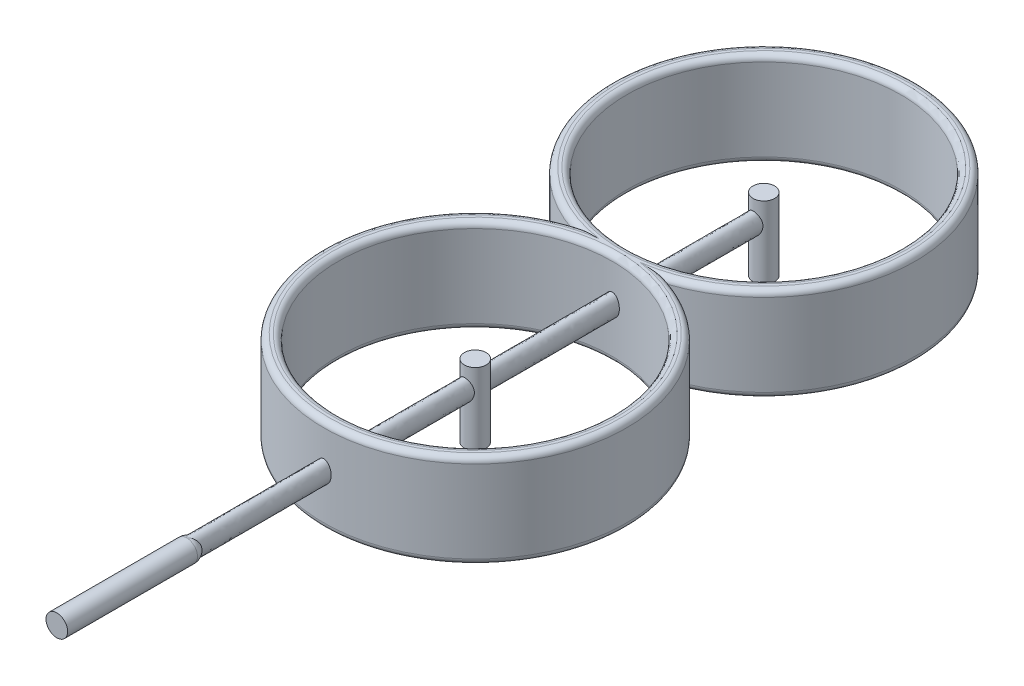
ISO-10303-21;
HEADER;
FILE_DESCRIPTION(('STEP AP214'),'2;1');
FILE_NAME('part.step','',(''),(''),'','','');
FILE_SCHEMA(('AUTOMOTIVE_DESIGN { 1 0 10303 214 1 1 1 1 }'));
ENDSEC;
DATA;
#1=APPLICATION_CONTEXT('core data for automotive mechanical design processes');
#2=APPLICATION_PROTOCOL_DEFINITION('international standard','automotive_design',2000,#1);
#3=PRODUCT_CONTEXT('',#1,'mechanical');
#4=PRODUCT('Part','Part','',(#3));
#5=PRODUCT_RELATED_PRODUCT_CATEGORY('part','',(#4));
#6=PRODUCT_DEFINITION_FORMATION('','',#4);
#7=PRODUCT_DEFINITION_CONTEXT('part definition',#1,'design');
#8=PRODUCT_DEFINITION('design','',#6,#7);
#9=PRODUCT_DEFINITION_SHAPE('','',#8);
#10=(LENGTH_UNIT() NAMED_UNIT(*) SI_UNIT(.MILLI.,.METRE.));
#11=(NAMED_UNIT(*) PLANE_ANGLE_UNIT() SI_UNIT($,.RADIAN.));
#12=(NAMED_UNIT(*) SI_UNIT($,.STERADIAN.) SOLID_ANGLE_UNIT());
#13=UNCERTAINTY_MEASURE_WITH_UNIT(LENGTH_MEASURE(1.E-05),#10,'distance_accuracy_value','');
#14=(GEOMETRIC_REPRESENTATION_CONTEXT(3) GLOBAL_UNCERTAINTY_ASSIGNED_CONTEXT((#13)) GLOBAL_UNIT_ASSIGNED_CONTEXT((#10,
#11,#12)) REPRESENTATION_CONTEXT('',''));
#15=CARTESIAN_POINT('',(0.,0.,0.));
#16=DIRECTION('',(0.,0.,1.));
#17=DIRECTION('',(1.,0.,0.));
#18=AXIS2_PLACEMENT_3D('',#15,#16,#17);
#19=CARTESIAN_POINT('',(0.,5.00000000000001,-290.));
#20=DIRECTION('',(0.,-1.,0.));
#21=DIRECTION('',(1.,0.,0.));
#22=AXIS2_PLACEMENT_3D('',#19,#20,#21);
#23=CYLINDRICAL_SURFACE('',#22,105.);
#24=CARTESIAN_POINT('',(0.,32.5,-185.));
#25=CARTESIAN_POINT('',(0.0985823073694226,32.4999985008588,-184.999999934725));
#26=CARTESIAN_POINT('',(0.197153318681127,32.504380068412,-185.000139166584));
#27=CARTESIAN_POINT('',(0.393579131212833,32.5218151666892,-185.000691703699));
#28=CARTESIAN_POINT('',(0.491433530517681,32.534873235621,-185.001105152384));
#29=CARTESIAN_POINT('',(0.686120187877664,32.5694872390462,-185.002196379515));
#30=CARTESIAN_POINT('',(0.782944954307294,32.5910850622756,-185.002875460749));
#31=CARTESIAN_POINT('',(0.974461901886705,32.6423675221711,-185.004478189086));
#32=CARTESIAN_POINT('',(1.06915315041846,32.6720556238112,-185.005401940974));
#33=CARTESIAN_POINT('',(1.25589111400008,32.7390143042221,-185.007469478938));
#34=CARTESIAN_POINT('',(1.34793561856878,32.7762910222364,-185.008613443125));
#35=CARTESIAN_POINT('',(1.52888570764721,32.8578197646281,-185.011092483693));
#36=CARTESIAN_POINT('',(1.61779055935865,32.9020734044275,-185.012427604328));
#37=CARTESIAN_POINT('',(1.81781633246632,33.0109102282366,-185.015676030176));
#38=CARTESIAN_POINT('',(1.92777238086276,33.0776429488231,-185.017643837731));
#39=CARTESIAN_POINT('',(2.14131658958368,33.2203258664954,-185.021782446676));
#40=CARTESIAN_POINT('',(2.24490945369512,33.2962691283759,-185.023953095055));
#41=CARTESIAN_POINT('',(2.59243745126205,33.573153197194,-185.031716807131));
#42=CARTESIAN_POINT('',(2.82035840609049,33.7946528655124,-185.037677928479));
#43=CARTESIAN_POINT('',(3.13307924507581,34.151706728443,-185.046702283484));
#44=CARTESIAN_POINT('',(3.23261394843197,34.2751062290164,-185.0497297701));
#45=CARTESIAN_POINT('',(3.42235739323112,34.5288876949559,-185.055745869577));
#46=CARTESIAN_POINT('',(3.51256951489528,34.6592671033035,-185.05873449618));
#47=CARTESIAN_POINT('',(3.68526176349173,34.9277475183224,-185.064655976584));
#48=CARTESIAN_POINT('',(3.76760736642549,35.0659343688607,-185.067587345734));
#49=CARTESIAN_POINT('',(3.92330312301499,35.3469771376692,-185.073293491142));
#50=CARTESIAN_POINT('',(3.99666745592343,35.4898252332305,-185.076068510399));
#51=CARTESIAN_POINT('',(4.17597622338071,35.8655820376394,-185.083016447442));
#52=CARTESIAN_POINT('',(4.27541115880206,36.1016190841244,-185.087041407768));
#53=CARTESIAN_POINT('',(4.4540922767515,36.5812447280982,-185.094475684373));
#54=CARTESIAN_POINT('',(4.53332971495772,36.8248365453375,-185.097884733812));
#55=CARTESIAN_POINT('',(4.6725397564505,37.3170983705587,-185.103993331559));
#56=CARTESIAN_POINT('',(4.73253766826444,37.5657612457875,-185.106693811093));
#57=CARTESIAN_POINT('',(4.83418217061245,38.0667210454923,-185.111329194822));
#58=CARTESIAN_POINT('',(4.87583370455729,38.3190169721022,-185.11326430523));
#59=CARTESIAN_POINT('',(4.94133911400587,38.8258096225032,-185.116329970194));
#60=CARTESIAN_POINT('',(4.96519929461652,39.0803055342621,-185.117460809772));
#61=CARTESIAN_POINT('',(4.99545189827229,39.5903289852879,-185.118897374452));
#62=CARTESIAN_POINT('',(5.00184436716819,39.8458565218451,-185.119203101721));
#63=CARTESIAN_POINT('',(4.99724338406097,40.3567498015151,-185.118983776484));
#64=CARTESIAN_POINT('',(4.9862503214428,40.6121155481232,-185.118458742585));
#65=CARTESIAN_POINT('',(4.94673870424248,41.1214906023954,-185.116587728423));
#66=CARTESIAN_POINT('',(4.91822030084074,41.3754999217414,-185.115241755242));
#67=CARTESIAN_POINT('',(4.84327602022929,41.8809823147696,-185.111754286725));
#68=CARTESIAN_POINT('',(4.79684256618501,42.1324542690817,-185.10961245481));
#69=CARTESIAN_POINT('',(4.68546267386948,42.6312886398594,-185.104577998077));
#70=CARTESIAN_POINT('',(4.62051621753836,42.8786510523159,-185.101685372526));
#71=CARTESIAN_POINT('',(4.47442927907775,43.3570970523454,-185.095354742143));
#72=CARTESIAN_POINT('',(4.39409376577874,43.5884258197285,-185.091945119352));
#73=CARTESIAN_POINT('',(4.21468432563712,44.0437504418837,-185.084583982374));
#74=CARTESIAN_POINT('',(4.1156115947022,44.2677467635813,-185.080632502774));
#75=CARTESIAN_POINT('',(3.91859602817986,44.6635846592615,-185.073109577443));
#76=CARTESIAN_POINT('',(3.82412036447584,44.8371531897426,-185.069611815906));
#77=CARTESIAN_POINT('',(3.62155919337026,45.1760468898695,-185.062425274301));
#78=CARTESIAN_POINT('',(3.51348384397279,45.3413780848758,-185.058736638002));
#79=CARTESIAN_POINT('',(3.30357362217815,45.6331005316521,-185.05193976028));
#80=CARTESIAN_POINT('',(3.20407798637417,45.761168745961,-185.048845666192));
#81=CARTESIAN_POINT('',(2.99493386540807,46.0090295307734,-185.042668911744));
#82=CARTESIAN_POINT('',(2.88526954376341,46.1288086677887,-185.039586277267));
#83=CARTESIAN_POINT('',(2.57587680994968,46.4376559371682,-185.03142050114));
#84=CARTESIAN_POINT('',(2.36632980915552,46.617327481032,-185.026428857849));
#85=CARTESIAN_POINT('',(2.0305899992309,46.8561778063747,-185.019576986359));
#86=CARTESIAN_POINT('',(1.91511687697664,46.9306803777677,-185.017399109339));
#87=CARTESIAN_POINT('',(1.67736386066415,47.0679511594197,-185.013331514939));
#88=CARTESIAN_POINT('',(1.55508736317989,47.1307251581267,-185.011441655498));
#89=CARTESIAN_POINT('',(1.34014417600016,47.2269472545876,-185.008514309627));
#90=CARTESIAN_POINT('',(1.24892896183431,47.2636610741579,-185.007387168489));
#91=CARTESIAN_POINT('',(1.06385257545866,47.3296539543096,-185.005348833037));
#92=CARTESIAN_POINT('',(0.969992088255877,47.3589349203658,-185.00443758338));
#93=CARTESIAN_POINT('',(0.780215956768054,47.409536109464,-185.002855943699));
#94=CARTESIAN_POINT('',(0.684301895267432,47.430862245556,-185.002185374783));
#95=CARTESIAN_POINT('',(0.490983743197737,47.4651802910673,-185.00110345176));
#96=CARTESIAN_POINT('',(0.393579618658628,47.4781720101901,-185.000692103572));
#97=CARTESIAN_POINT('',(0.197698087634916,47.4955843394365,-185.000140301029));
#98=CARTESIAN_POINT('',(0.0992182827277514,47.4999781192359,-185.000000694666));
#99=CARTESIAN_POINT('',(-0.0977433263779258,47.5000217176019,-184.999999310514));
#100=CARTESIAN_POINT('',(-0.196225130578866,47.4956715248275,-185.000137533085));
#101=CARTESIAN_POINT('',(-0.39245291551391,47.478315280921,-185.000687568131));
#102=CARTESIAN_POINT('',(-0.490198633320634,47.4653062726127,-185.001099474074));
#103=CARTESIAN_POINT('',(-0.684191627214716,47.430895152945,-185.00218434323));
#104=CARTESIAN_POINT('',(-0.780438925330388,47.4094931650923,-185.002857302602));
#105=CARTESIAN_POINT('',(-0.967090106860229,47.3596927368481,-185.004413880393));
#106=CARTESIAN_POINT('',(-1.05757563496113,47.3315989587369,-185.005288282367));
#107=CARTESIAN_POINT('',(-1.23611138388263,47.268495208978,-185.007238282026));
#108=CARTESIAN_POINT('',(-1.32416067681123,47.2334826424,-185.00831395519));
#109=CARTESIAN_POINT('',(-1.58395515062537,47.1188548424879,-185.011805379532));
#110=CARTESIAN_POINT('',(-1.75153706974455,47.0295972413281,-185.014487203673));
#111=CARTESIAN_POINT('',(-2.02787541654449,46.8580373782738,-185.019520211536));
#112=CARTESIAN_POINT('',(-2.13990780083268,46.7808548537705,-185.021751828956));
#113=CARTESIAN_POINT('',(-2.3567471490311,46.6171006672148,-185.026396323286));
#114=CARTESIAN_POINT('',(-2.46155863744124,46.5305349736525,-185.028809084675));
#115=CARTESIAN_POINT('',(-2.76483463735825,46.2589880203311,-185.036212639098));
#116=CARTESIAN_POINT('',(-2.95256525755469,46.0618836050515,-185.041376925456));
#117=CARTESIAN_POINT('',(-3.25058833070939,45.7037789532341,-185.050254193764));
#118=CARTESIAN_POINT('',(-3.3677707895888,45.5483204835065,-185.053964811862));
#119=CARTESIAN_POINT('',(-3.58841241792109,45.2278527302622,-185.061277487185));
#120=CARTESIAN_POINT('',(-3.69186658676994,45.0628399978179,-185.064879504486));
#121=CARTESIAN_POINT('',(-3.88546861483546,44.7256215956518,-185.071869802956));
#122=CARTESIAN_POINT('',(-3.97563955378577,44.553429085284,-185.075258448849));
#123=CARTESIAN_POINT('',(-4.14353817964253,44.2031481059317,-185.081755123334));
#124=CARTESIAN_POINT('',(-4.2212672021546,44.025060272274,-185.08486318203));
#125=CARTESIAN_POINT('',(-4.43658694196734,43.484112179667,-185.09367228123));
#126=CARTESIAN_POINT('',(-4.55655556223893,43.1141278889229,-185.098867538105));
#127=CARTESIAN_POINT('',(-4.75291181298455,42.3631970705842,-185.107581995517));
#128=CARTESIAN_POINT('',(-4.82931593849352,41.9822547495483,-185.111101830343));
#129=CARTESIAN_POINT('',(-4.92950678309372,41.2932057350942,-185.11576937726));
#130=CARTESIAN_POINT('',(-4.96086817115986,40.9861728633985,-185.117255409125));
#131=CARTESIAN_POINT('',(-4.99814956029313,40.3704490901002,-185.119025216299));
#132=CARTESIAN_POINT('',(-5.00406080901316,40.0617576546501,-185.119308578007));
#133=CARTESIAN_POINT('',(-4.99063264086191,39.4496184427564,-185.118668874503));
#134=CARTESIAN_POINT('',(-4.9716748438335,39.1461621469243,-185.117764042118));
#135=CARTESIAN_POINT('',(-4.90882809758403,38.5418606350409,-185.11480363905));
#136=CARTESIAN_POINT('',(-4.86494316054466,38.2410150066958,-185.112748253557));
#137=CARTESIAN_POINT('',(-4.75758758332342,37.676503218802,-185.107827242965));
#138=CARTESIAN_POINT('',(-4.69674867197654,37.4123351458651,-185.105073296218));
#139=CARTESIAN_POINT('',(-4.55370925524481,36.8898307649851,-185.098766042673));
#140=CARTESIAN_POINT('',(-4.47151214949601,36.6314935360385,-185.095212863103));
#141=CARTESIAN_POINT('',(-4.2998984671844,36.1648562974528,-185.088051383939));
#142=CARTESIAN_POINT('',(-4.21388194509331,35.9553037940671,-185.084547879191));
#143=CARTESIAN_POINT('',(-4.02519172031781,35.5438288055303,-185.07713897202));
#144=CARTESIAN_POINT('',(-3.92252225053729,35.3419043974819,-185.073233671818));
#145=CARTESIAN_POINT('',(-3.7198262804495,34.9839102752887,-185.065872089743));
#146=CARTESIAN_POINT('',(-3.62272173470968,34.8261852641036,-185.06246350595));
#147=CARTESIAN_POINT('',(-3.41609051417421,34.5190493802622,-185.05553363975));
#148=CARTESIAN_POINT('',(-3.30656540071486,34.3696374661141,-185.052012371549));
#149=CARTESIAN_POINT('',(-3.09510671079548,34.1067589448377,-185.04558406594));
#150=CARTESIAN_POINT('',(-2.99526266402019,33.9916119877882,-185.042678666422));
#151=CARTESIAN_POINT('',(-2.78660446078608,33.769820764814,-185.036931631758));
#152=CARTESIAN_POINT('',(-2.67779592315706,33.6631712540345,-185.034089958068));
#153=CARTESIAN_POINT('',(-2.4691531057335,33.476188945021,-185.028992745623));
#154=CARTESIAN_POINT('',(-2.37065126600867,33.3943705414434,-185.026715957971));
#155=CARTESIAN_POINT('',(-2.16713377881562,33.2389118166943,-185.022317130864));
#156=CARTESIAN_POINT('',(-2.0621093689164,33.1652828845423,-185.02019530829));
#157=CARTESIAN_POINT('',(-1.85870594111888,33.0357443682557,-185.01640938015));
#158=CARTESIAN_POINT('',(-1.76100682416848,32.978769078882,-185.014720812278));
#159=CARTESIAN_POINT('',(-1.56118556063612,32.8731980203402,-185.011559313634));
#160=CARTESIAN_POINT('',(-1.45906448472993,32.8246002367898,-185.010086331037));
#161=CARTESIAN_POINT('',(-1.25098078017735,32.7367286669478,-185.007400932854));
#162=CARTESIAN_POINT('',(-1.14502193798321,32.6974459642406,-185.006188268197));
#163=CARTESIAN_POINT('',(-0.929930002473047,32.6290134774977,-185.00406299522));
#164=CARTESIAN_POINT('',(-0.820798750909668,32.599857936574,-185.003150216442));
#165=CARTESIAN_POINT('',(-0.593821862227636,32.5509838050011,-185.001614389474));
#166=CARTESIAN_POINT('',(-0.475836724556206,32.531906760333,-185.001011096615));
#167=CARTESIAN_POINT('',(-0.238561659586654,32.5064195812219,-185.000204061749));
#168=CARTESIAN_POINT('',(-0.119272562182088,32.5000018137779,-185.000000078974));
#169=CARTESIAN_POINT('',(0.,32.5,-185.));
#170=B_SPLINE_CURVE_WITH_KNOTS('',3,(#24,#25,#26,#27,#28,#29,#30,#31,#32,#33,#34,#35,#36,#37,
#38,#39,#40,#41,#42,#43,#44,#45,#46,#47,#48,#49,#50,#51,#52,#53,#54,#55,#56,#57,#58,#59,#60,#61,
#62,#63,#64,#65,#66,#67,#68,#69,#70,#71,#72,#73,#74,#75,#76,#77,#78,#79,#80,#81,#82,#83,#84,#85,
#86,#87,#88,#89,#90,#91,#92,#93,#94,#95,#96,#97,#98,#99,#100,#101,#102,#103,#104,#105,#106,#107,
#108,#109,#110,#111,#112,#113,#114,#115,#116,#117,#118,#119,#120,#121,#122,#123,#124,#125,#126,
#127,#128,#129,#130,#131,#132,#133,#134,#135,#136,#137,#138,#139,#140,#141,#142,#143,#144,#145,
#146,#147,#148,#149,#150,#151,#152,#153,#154,#155,#156,#157,#158,#159,#160,#161,#162,#163,#164,
#165,#166,#167,#168,#169),.UNSPECIFIED.,.T.,.F.,(4,2,2,2,2,2,2,2,2,2,2,2,2,2,2,2,2,2,2,2,2,2,2,
2,2,2,2,2,2,2,2,2,2,2,2,2,2,2,2,2,2,2,2,2,2,2,2,2,2,2,2,2,2,2,2,2,2,2,2,2,2,2,2,2,2,2,2,2,2,2,2,
2,4),(0.,0.295630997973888,0.591416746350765,0.888671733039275,1.18605423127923,
1.48367827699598,1.78137133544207,2.16670305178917,2.55174640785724,3.49917938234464,
3.97463082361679,4.44990926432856,4.93223691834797,5.41379299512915,6.18118592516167,
6.94891052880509,7.71562105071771,8.48212485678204,9.24835689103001,10.014586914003,
10.7807997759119,11.5470060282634,12.3135366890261,13.0800680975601,13.8140426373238,
14.5479703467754,15.1403512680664,15.7322923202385,16.2183956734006,16.7052692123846,
17.5289918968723,17.9407877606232,18.3523798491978,18.6470970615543,18.9417386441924,
19.236160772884,19.5305896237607,19.825935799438,20.1212823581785,20.4167298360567,
20.7121729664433,20.9961194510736,21.2801726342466,21.8476933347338,22.2553954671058,
22.6628397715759,23.4762317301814,24.0597212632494,24.6434227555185,25.2260977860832,
25.8087102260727,26.9724374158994,28.1357236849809,29.0605917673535,29.985777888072,
30.8969316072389,31.8079387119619,32.6204129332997,33.4327579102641,34.1117526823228,
34.7905751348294,35.3458098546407,35.9009748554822,36.3578414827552,36.8144238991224,
37.1982574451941,37.5826182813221,37.9215885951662,38.2604772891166,38.5990402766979,
38.9374104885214,39.2953037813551,39.6529812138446),.UNSPECIFIED.);
#171=CARTESIAN_POINT('',(0.,32.5,-185.));
#172=VERTEX_POINT('',#171);
#173=EDGE_CURVE('E192',#172,#172,#170,.T.);
#174=ORIENTED_EDGE('',*,*,#173,.F.);
#175=EDGE_LOOP('',(#174));
#176=FACE_BOUND('',#175,.T.);
#177=CARTESIAN_POINT('',(0.,9.00000000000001,-290.));
#178=DIRECTION('',(0.,-1.,0.));
#179=DIRECTION('',(1.,0.,0.));
#180=AXIS2_PLACEMENT_3D('',#177,#178,#179);
#181=CIRCLE('',#180,105.);
#182=CARTESIAN_POINT('',(32.0156211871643,9.00000000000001,-390.));
#183=VERTEX_POINT('',#182);
#184=CARTESIAN_POINT('',(-32.0156211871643,9.00000000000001,-390.));
#185=VERTEX_POINT('',#184);
#186=EDGE_CURVE('E234',#183,#185,#181,.T.);
#187=ORIENTED_EDGE('',*,*,#186,.F.);
#188=DIRECTION('',(0.,-1.,0.));
#189=VECTOR('',#188,1.);
#190=CARTESIAN_POINT('',(32.0156211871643,37.5,-390.));
#191=LINE('',#190,#189);
#192=CARTESIAN_POINT('',(32.0156211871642,66.,-390.));
#193=VERTEX_POINT('',#192);
#194=EDGE_CURVE('E299',#183,#193,#191,.F.);
#195=ORIENTED_EDGE('',*,*,#194,.T.);
#196=CARTESIAN_POINT('',(0.,66.,-290.));
#197=DIRECTION('',(0.,-1.,0.));
#198=DIRECTION('',(1.,0.,0.));
#199=AXIS2_PLACEMENT_3D('',#196,#197,#198);
#200=CIRCLE('',#199,105.);
#201=CARTESIAN_POINT('',(-32.0156211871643,66.,-390.));
#202=VERTEX_POINT('',#201);
#203=EDGE_CURVE('E315',#193,#202,#200,.T.);
#204=ORIENTED_EDGE('',*,*,#203,.T.);
#205=DIRECTION('',(0.,-1.,0.));
#206=VECTOR('',#205,1.);
#207=CARTESIAN_POINT('',(-32.0156211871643,37.5,-390.));
#208=LINE('',#207,#206);
#209=EDGE_CURVE('E63',#202,#185,#208,.T.);
#210=ORIENTED_EDGE('',*,*,#209,.T.);
#211=EDGE_LOOP('',(#187,#195,#204,#210));
#212=FACE_BOUND('',#211,.T.);
#213=ADVANCED_FACE('F36',(#176,#212),#23,.T.);
#214=CARTESIAN_POINT('',(0.,9.00000000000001,-290.));
#215=DIRECTION('',(0.,-1.,0.));
#216=DIRECTION('',(1.,0.,0.));
#217=AXIS2_PLACEMENT_3D('',#214,#215,#216);
#218=TOROIDAL_SURFACE('',#217,101.,4.);
#219=CARTESIAN_POINT('',(0.,5.,-290.));
#220=DIRECTION('',(0.,-1.,0.));
#221=DIRECTION('',(1.,0.,0.));
#222=AXIS2_PLACEMENT_3D('',#219,#220,#221);
#223=CIRCLE('',#222,101.);
#224=CARTESIAN_POINT('',(14.1774468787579,5.00000000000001,-390.));
#225=VERTEX_POINT('',#224);
#226=CARTESIAN_POINT('',(-14.1774468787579,5.,-390.));
#227=VERTEX_POINT('',#226);
#228=EDGE_CURVE('E198',#225,#227,#223,.T.);
#229=ORIENTED_EDGE('',*,*,#228,.F.);
#230=CARTESIAN_POINT('',(14.1774468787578,5.00000000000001,-390.));
#231=CARTESIAN_POINT('',(14.1854442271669,5.00000000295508,-390.));
#232=CARTESIAN_POINT('',(14.1934415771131,5.00000047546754,-390.));
#233=CARTESIAN_POINT('',(14.8666534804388,5.00007999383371,-390.));
#234=CARTESIAN_POINT('',(15.5318779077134,5.00342505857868,-390.));
#235=CARTESIAN_POINT('',(16.8623268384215,5.01959645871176,-390.));
#236=CARTESIAN_POINT('',(17.5275513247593,5.03242431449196,-390.));
#237=CARTESIAN_POINT('',(18.8617128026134,5.0712064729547,-390.));
#238=CARTESIAN_POINT('',(19.5306477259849,5.09724025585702,-390.));
#239=CARTESIAN_POINT('',(20.5331430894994,5.1495752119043,-390.));
#240=CARTESIAN_POINT('',(20.8670518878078,5.16922595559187,-390.));
#241=CARTESIAN_POINT('',(21.5345246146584,5.21366485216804,-390.));
#242=CARTESIAN_POINT('',(21.868088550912,5.23845288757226,-390.));
#243=CARTESIAN_POINT('',(22.5399581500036,5.29441312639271,-390.));
#244=CARTESIAN_POINT('',(22.8782560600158,5.32567942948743,-390.));
#245=CARTESIAN_POINT('',(23.5541058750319,5.39537370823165,-390.));
#246=CARTESIAN_POINT('',(23.8916578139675,5.43380135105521,-390.));
#247=CARTESIAN_POINT('',(24.5666594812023,5.51920503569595,-390.));
#248=CARTESIAN_POINT('',(24.9041062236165,5.56620493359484,-390.));
#249=CARTESIAN_POINT('',(25.5774061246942,5.67029453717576,-390.));
#250=CARTESIAN_POINT('',(25.9132595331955,5.72738260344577,-390.));
#251=CARTESIAN_POINT('',(26.5779383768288,5.85290956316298,-390.));
#252=CARTESIAN_POINT('',(26.9067960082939,5.92117639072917,-390.));
#253=CARTESIAN_POINT('',(27.5614180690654,6.07249044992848,-390.));
#254=CARTESIAN_POINT('',(27.8871802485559,6.15554767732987,-390.));
#255=CARTESIAN_POINT('',(28.3709868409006,6.29413062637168,-390.));
#256=CARTESIAN_POINT('',(28.5310781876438,6.34252748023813,-390.));
#257=CARTESIAN_POINT('',(28.849508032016,6.44475690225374,-390.));
#258=CARTESIAN_POINT('',(29.0078467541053,6.49858876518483,-390.));
#259=CARTESIAN_POINT('',(29.3220334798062,6.61253256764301,-390.));
#260=CARTESIAN_POINT('',(29.4778843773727,6.67263648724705,-390.));
#261=CARTESIAN_POINT('',(29.7864512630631,6.80036402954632,-390.));
#262=CARTESIAN_POINT('',(29.9391684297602,6.86798476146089,-390.));
#263=CARTESIAN_POINT('',(30.1623133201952,6.97502200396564,-390.));
#264=CARTESIAN_POINT('',(30.2344307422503,7.01092688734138,-390.));
#265=CARTESIAN_POINT('',(30.3774515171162,7.08511966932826,-390.));
#266=CARTESIAN_POINT('',(30.4483546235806,7.1234080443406,-390.));
#267=CARTESIAN_POINT('',(30.5888283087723,7.20271937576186,-390.));
#268=CARTESIAN_POINT('',(30.6583957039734,7.24374802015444,-390.));
#269=CARTESIAN_POINT('',(30.7956601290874,7.32878176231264,-390.));
#270=CARTESIAN_POINT('',(30.8633572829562,7.37278666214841,-390.));
#271=CARTESIAN_POINT('',(31.0642198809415,7.51063619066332,-390.));
#272=CARTESIAN_POINT('',(31.1940024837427,7.60968387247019,-390.));
#273=CARTESIAN_POINT('',(31.3770142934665,7.77129579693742,-390.));
#274=CARTESIAN_POINT('',(31.4360436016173,7.82730348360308,-390.));
#275=CARTESIAN_POINT('',(31.5489638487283,7.94424638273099,-390.));
#276=CARTESIAN_POINT('',(31.6028592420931,8.00517723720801,-390.));
#277=CARTESIAN_POINT('',(31.7067731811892,8.13619151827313,-390.));
#278=CARTESIAN_POINT('',(31.7563892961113,8.20660004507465,-390.));
#279=CARTESIAN_POINT('',(31.8450447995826,8.3534719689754,-390.));
#280=CARTESIAN_POINT('',(31.8841316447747,8.42990612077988,-390.));
#281=CARTESIAN_POINT('',(31.947752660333,8.58646239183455,-390.));
#282=CARTESIAN_POINT('',(31.9726451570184,8.66643302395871,-390.));
#283=CARTESIAN_POINT('',(31.9981384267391,8.78942646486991,-390.));
#284=CARTESIAN_POINT('',(32.0046651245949,8.83126433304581,-390.));
#285=CARTESIAN_POINT('',(32.0134233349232,8.91545660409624,-390.));
#286=CARTESIAN_POINT('',(32.0156475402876,8.95781176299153,-390.));
#287=CARTESIAN_POINT('',(32.015621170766,9.00020000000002,-390.));
#288=B_SPLINE_CURVE_WITH_KNOTS('',3,(#230,#231,#232,#233,#234,#235,#236,#237,#238,#239,#240,
#241,#242,#243,#244,#245,#246,#247,#248,#249,#250,#251,#252,#253,#254,#255,#256,#257,#258,#259,
#260,#261,#262,#263,#264,#265,#266,#267,#268,#269,#270,#271,#272,#273,#274,#275,#276,#277,#278,
#279,#280,#281,#282,#283,#284,#285,#286,#287),.UNSPECIFIED.,.F.,.F.,(4,2,2,2,2,2,2,2,2,2,2,2,2,
2,2,2,2,2,2,2,2,2,2,2,2,2,2,2,4),(0.,0.0239920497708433,2.01963534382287,4.01559867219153,
6.02371986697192,7.02714781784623,8.03055282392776,9.04970739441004,10.0688146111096,
11.0908024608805,12.1126243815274,13.1199858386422,14.1280307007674,14.629695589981,
15.1312954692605,15.6322616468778,16.1330358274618,16.374682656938,16.6163779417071,
16.8585915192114,17.100789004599,17.589119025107,17.8330005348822,18.0766684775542,
18.3343792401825,18.5909082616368,18.84063660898,18.9674671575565,19.0945129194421),.UNSPECIFIED.);
#289=EDGE_CURVE('E56',#225,#183,#288,.T.);
#290=ORIENTED_EDGE('',*,*,#289,.T.);
#291=ORIENTED_EDGE('',*,*,#186,.T.);
#292=CARTESIAN_POINT('',(-32.015621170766,9.00020000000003,-390.));
#293=CARTESIAN_POINT('',(-32.015643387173,8.96026762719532,-390.));
#294=CARTESIAN_POINT('',(-32.0136716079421,8.92036105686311,-390.));
#295=CARTESIAN_POINT('',(-32.005892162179,8.84098116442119,-390.));
#296=CARTESIAN_POINT('',(-32.0000901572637,8.80150729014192,-390.));
#297=CARTESIAN_POINT('',(-31.9773796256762,8.68526661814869,-390.));
#298=CARTESIAN_POINT('',(-31.9551570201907,8.60950246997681,-390.));
#299=CARTESIAN_POINT('',(-31.8920838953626,8.44515123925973,-390.));
#300=CARTESIAN_POINT('',(-31.8480533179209,8.35781951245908,-390.));
#301=CARTESIAN_POINT('',(-31.7465231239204,8.19094112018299,-390.));
#302=CARTESIAN_POINT('',(-31.6889457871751,8.11144328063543,-390.));
#303=CARTESIAN_POINT('',(-31.5736452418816,7.97145306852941,-390.));
#304=CARTESIAN_POINT('',(-31.5171955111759,7.90988678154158,-390.));
#305=CARTESIAN_POINT('',(-31.3991867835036,7.79181517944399,-390.));
#306=CARTESIAN_POINT('',(-31.337623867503,7.73531381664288,-390.));
#307=CARTESIAN_POINT('',(-31.2106018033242,7.62676039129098,-390.));
#308=CARTESIAN_POINT('',(-31.1451380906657,7.57471372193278,-390.));
#309=CARTESIAN_POINT('',(-31.0112834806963,7.47460497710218,-390.));
#310=CARTESIAN_POINT('',(-30.9428934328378,7.42654175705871,-390.));
#311=CARTESIAN_POINT('',(-30.7746657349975,7.3144844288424,-390.));
#312=CARTESIAN_POINT('',(-30.673656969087,7.25225217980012,-390.));
#313=CARTESIAN_POINT('',(-30.4682290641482,7.13365323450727,-390.));
#314=CARTESIAN_POINT('',(-30.3638083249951,7.07728934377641,-390.));
#315=CARTESIAN_POINT('',(-30.1522506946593,6.96949307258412,-390.));
#316=CARTESIAN_POINT('',(-30.0451096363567,6.9180689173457,-390.));
#317=CARTESIAN_POINT('',(-29.8288484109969,6.81955909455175,-390.));
#318=CARTESIAN_POINT('',(-29.7197280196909,6.77247392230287,-390.));
#319=CARTESIAN_POINT('',(-29.499335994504,6.68184953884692,-390.));
#320=CARTESIAN_POINT('',(-29.3880558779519,6.63833104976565,-390.));
#321=CARTESIAN_POINT('',(-29.1642336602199,6.55467302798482,-390.));
#322=CARTESIAN_POINT('',(-29.0516915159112,6.51453361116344,-390.));
#323=CARTESIAN_POINT('',(-28.8257156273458,6.43730829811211,-390.));
#324=CARTESIAN_POINT('',(-28.7122830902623,6.40021885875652,-390.));
#325=CARTESIAN_POINT('',(-28.4845791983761,6.32873890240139,-390.));
#326=CARTESIAN_POINT('',(-28.3703078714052,6.29434829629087,-390.));
#327=CARTESIAN_POINT('',(-27.973592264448,6.17951654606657,-390.));
#328=CARTESIAN_POINT('',(-27.6893638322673,6.10520368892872,-390.));
#329=CARTESIAN_POINT('',(-27.11807022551,5.9683082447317,-390.));
#330=CARTESIAN_POINT('',(-26.8310042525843,5.90572906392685,-390.));
#331=CARTESIAN_POINT('',(-26.2546780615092,5.79020997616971,-390.));
#332=CARTESIAN_POINT('',(-25.9654160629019,5.73727901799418,-390.));
#333=CARTESIAN_POINT('',(-25.3855139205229,5.63957743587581,-390.));
#334=CARTESIAN_POINT('',(-25.0948736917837,5.5948073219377,-390.));
#335=CARTESIAN_POINT('',(-24.5115399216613,5.51208247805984,-390.));
#336=CARTESIAN_POINT('',(-24.2188427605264,5.47415347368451,-390.));
#337=CARTESIAN_POINT('',(-23.6327281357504,5.40435604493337,-390.));
#338=CARTESIAN_POINT('',(-23.3393106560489,5.37248775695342,-390.));
#339=CARTESIAN_POINT('',(-22.4586049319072,5.28479070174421,-390.));
#340=CARTESIAN_POINT('',(-21.8705307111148,5.2368245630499,-390.));
#341=CARTESIAN_POINT('',(-20.6924586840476,5.15691446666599,-390.));
#342=CARTESIAN_POINT('',(-20.1024593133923,5.12499488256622,-390.));
#343=CARTESIAN_POINT('',(-18.9218628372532,5.07364955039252,-390.));
#344=CARTESIAN_POINT('',(-18.3312656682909,5.05422530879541,-390.));
#345=CARTESIAN_POINT('',(-17.150832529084,5.02499654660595,-390.));
#346=CARTESIAN_POINT('',(-16.5609969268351,5.0151760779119,-390.));
#347=CARTESIAN_POINT('',(-15.3812518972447,5.00271335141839,-390.));
#348=CARTESIAN_POINT('',(-14.7913424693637,5.00007114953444,-390.000000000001));
#349=CARTESIAN_POINT('',(-14.1934415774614,5.0000004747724,-390.));
#350=CARTESIAN_POINT('',(-14.1854442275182,5.00000000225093,-390.));
#351=CARTESIAN_POINT('',(-14.1774468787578,5.,-390.));
#352=B_SPLINE_CURVE_WITH_KNOTS('',3,(#292,#293,#294,#295,#296,#297,#298,#299,#300,#301,#302,
#303,#304,#305,#306,#307,#308,#309,#310,#311,#312,#313,#314,#315,#316,#317,#318,#319,#320,#321,
#322,#323,#324,#325,#326,#327,#328,#329,#330,#331,#332,#333,#334,#335,#336,#337,#338,#339,#340,
#341,#342,#343,#344,#345,#346,#347,#348,#349,#350,#351),.UNSPECIFIED.,.F.,.F.,(4,2,2,2,2,2,2,2,
2,2,2,2,2,2,2,2,2,2,2,2,2,2,2,2,2,2,2,2,2,4),(0.,0.119700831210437,0.239225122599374,
0.474796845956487,0.766592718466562,1.06010535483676,1.3103369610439,1.56076216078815,
1.81148637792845,2.06213830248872,2.41780179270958,2.77363454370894,3.13004988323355,
3.48650585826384,3.84490435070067,4.20331512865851,4.56130348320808,4.91928001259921,
5.8002645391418,6.68150441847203,7.5635575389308,8.44566576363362,9.33102491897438,
10.2164039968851,11.9861555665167,13.758587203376,15.5312324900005,17.3009290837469,
19.0706394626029,19.0946315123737),.UNSPECIFIED.);
#353=EDGE_CURVE('E224',#185,#227,#352,.T.);
#354=ORIENTED_EDGE('',*,*,#353,.T.);
#355=EDGE_LOOP('',(#229,#290,#291,#354));
#356=FACE_BOUND('',#355,.T.);
#357=ADVANCED_FACE('F176',(#356),#218,.T.);
#358=CARTESIAN_POINT('',(0.,66.,-290.));
#359=DIRECTION('',(0.,-1.,0.));
#360=DIRECTION('',(1.,0.,0.));
#361=AXIS2_PLACEMENT_3D('',#358,#359,#360);
#362=TOROIDAL_SURFACE('',#361,101.,4.);
#363=CARTESIAN_POINT('',(0.,70.,-290.));
#364=DIRECTION('',(0.,-1.,0.));
#365=DIRECTION('',(1.,0.,0.));
#366=AXIS2_PLACEMENT_3D('',#363,#364,#365);
#367=CIRCLE('',#366,101.);
#368=CARTESIAN_POINT('',(14.1774468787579,70.,-390.));
#369=VERTEX_POINT('',#368);
#370=CARTESIAN_POINT('',(-14.1774468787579,70.,-390.));
#371=VERTEX_POINT('',#370);
#372=EDGE_CURVE('E314',#369,#371,#367,.T.);
#373=ORIENTED_EDGE('',*,*,#372,.T.);
#374=CARTESIAN_POINT('',(-14.1774468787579,70.,-390.));
#375=CARTESIAN_POINT('',(-14.185444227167,69.9999999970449,-390.));
#376=CARTESIAN_POINT('',(-14.1934415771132,69.9999995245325,-390.));
#377=CARTESIAN_POINT('',(-14.8666534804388,69.9999200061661,-390.));
#378=CARTESIAN_POINT('',(-15.5318779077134,69.9965749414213,-390.));
#379=CARTESIAN_POINT('',(-16.8623268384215,69.9804035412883,-390.));
#380=CARTESIAN_POINT('',(-17.5275513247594,69.9675756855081,-390.));
#381=CARTESIAN_POINT('',(-18.8617128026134,69.9287935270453,-390.));
#382=CARTESIAN_POINT('',(-19.5306477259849,69.902759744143,-390.));
#383=CARTESIAN_POINT('',(-20.5331430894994,69.8504247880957,-390.));
#384=CARTESIAN_POINT('',(-20.8670518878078,69.8307740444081,-390.));
#385=CARTESIAN_POINT('',(-21.5345246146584,69.786335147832,-390.));
#386=CARTESIAN_POINT('',(-21.868088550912,69.7615471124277,-390.));
#387=CARTESIAN_POINT('',(-22.5399581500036,69.7055868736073,-390.));
#388=CARTESIAN_POINT('',(-22.8782560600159,69.6743205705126,-390.));
#389=CARTESIAN_POINT('',(-23.5541058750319,69.6046262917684,-390.));
#390=CARTESIAN_POINT('',(-23.8916578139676,69.5661986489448,-390.));
#391=CARTESIAN_POINT('',(-24.5666594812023,69.4807949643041,-390.));
#392=CARTESIAN_POINT('',(-24.9041062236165,69.4337950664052,-390.));
#393=CARTESIAN_POINT('',(-25.5774061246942,69.3297054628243,-390.));
#394=CARTESIAN_POINT('',(-25.9132595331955,69.2726173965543,-390.));
#395=CARTESIAN_POINT('',(-26.5779383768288,69.147090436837,-390.));
#396=CARTESIAN_POINT('',(-26.9067960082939,69.0788236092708,-390.));
#397=CARTESIAN_POINT('',(-27.5614180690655,68.9275095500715,-390.));
#398=CARTESIAN_POINT('',(-27.887180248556,68.8444523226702,-390.));
#399=CARTESIAN_POINT('',(-28.3709868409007,68.7058693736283,-390.));
#400=CARTESIAN_POINT('',(-28.5310781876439,68.6574725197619,-390.));
#401=CARTESIAN_POINT('',(-28.849508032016,68.5552430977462,-390.));
#402=CARTESIAN_POINT('',(-29.0078467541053,68.5014112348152,-390.));
#403=CARTESIAN_POINT('',(-29.3220334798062,68.387467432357,-390.));
#404=CARTESIAN_POINT('',(-29.4778843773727,68.327363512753,-390.));
#405=CARTESIAN_POINT('',(-29.7864512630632,68.1996359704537,-390.));
#406=CARTESIAN_POINT('',(-29.9391684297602,68.1320152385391,-390.));
#407=CARTESIAN_POINT('',(-30.1623133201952,68.0249779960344,-390.));
#408=CARTESIAN_POINT('',(-30.2344307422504,67.9890731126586,-390.));
#409=CARTESIAN_POINT('',(-30.3774515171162,67.9148803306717,-390.));
#410=CARTESIAN_POINT('',(-30.4483546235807,67.8765919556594,-390.));
#411=CARTESIAN_POINT('',(-30.5888283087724,67.7972806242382,-390.));
#412=CARTESIAN_POINT('',(-30.6583957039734,67.7562519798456,-390.));
#413=CARTESIAN_POINT('',(-30.7956601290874,67.6712182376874,-390.));
#414=CARTESIAN_POINT('',(-30.8633572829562,67.6272133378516,-390.));
#415=CARTESIAN_POINT('',(-31.0642198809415,67.4893638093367,-390.));
#416=CARTESIAN_POINT('',(-31.1940024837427,67.3903161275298,-390.));
#417=CARTESIAN_POINT('',(-31.3770142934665,67.2287042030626,-390.));
#418=CARTESIAN_POINT('',(-31.4360436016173,67.1726965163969,-390.));
#419=CARTESIAN_POINT('',(-31.5489638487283,67.055753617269,-390.));
#420=CARTESIAN_POINT('',(-31.6028592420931,66.994822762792,-390.));
#421=CARTESIAN_POINT('',(-31.7067731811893,66.8638084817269,-390.));
#422=CARTESIAN_POINT('',(-31.7563892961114,66.7933999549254,-390.));
#423=CARTESIAN_POINT('',(-31.8450447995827,66.6465280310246,-390.));
#424=CARTESIAN_POINT('',(-31.8841316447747,66.5700938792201,-390.));
#425=CARTESIAN_POINT('',(-31.947752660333,66.4135376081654,-390.));
#426=CARTESIAN_POINT('',(-31.9726451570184,66.3335669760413,-390.));
#427=CARTESIAN_POINT('',(-31.9981384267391,66.2105735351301,-390.));
#428=CARTESIAN_POINT('',(-32.0046651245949,66.1687356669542,-390.));
#429=CARTESIAN_POINT('',(-32.0134233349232,66.0845433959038,-390.));
#430=CARTESIAN_POINT('',(-32.0156475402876,66.0421882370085,-390.));
#431=CARTESIAN_POINT('',(-32.015621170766,65.9998,-390.));
#432=B_SPLINE_CURVE_WITH_KNOTS('',3,(#374,#375,#376,#377,#378,#379,#380,#381,#382,#383,#384,
#385,#386,#387,#388,#389,#390,#391,#392,#393,#394,#395,#396,#397,#398,#399,#400,#401,#402,#403,
#404,#405,#406,#407,#408,#409,#410,#411,#412,#413,#414,#415,#416,#417,#418,#419,#420,#421,#422,
#423,#424,#425,#426,#427,#428,#429,#430,#431),.UNSPECIFIED.,.F.,.F.,(4,2,2,2,2,2,2,2,2,2,2,2,2,
2,2,2,2,2,2,2,2,2,2,2,2,2,2,2,4),(0.,0.0239920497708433,2.01963534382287,4.01559867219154,
6.02371986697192,7.02714781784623,8.03055282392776,9.04970739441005,10.0688146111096,
11.0908024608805,12.1126243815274,13.1199858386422,14.1280307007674,14.6296955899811,
15.1312954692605,15.6322616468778,16.1330358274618,16.374682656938,16.6163779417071,
16.8585915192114,17.100789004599,17.5891190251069,17.8330005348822,18.0766684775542,
18.3343792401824,18.5909082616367,18.84063660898,18.9674671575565,19.0945129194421),.UNSPECIFIED.);
#433=EDGE_CURVE('E11',#371,#202,#432,.T.);
#434=ORIENTED_EDGE('',*,*,#433,.T.);
#435=ORIENTED_EDGE('',*,*,#203,.F.);
#436=CARTESIAN_POINT('',(32.015621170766,65.9998,-390.));
#437=CARTESIAN_POINT('',(32.0156433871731,66.0397323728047,-390.));
#438=CARTESIAN_POINT('',(32.0136716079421,66.0796389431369,-390.));
#439=CARTESIAN_POINT('',(32.005892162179,66.1590188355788,-390.));
#440=CARTESIAN_POINT('',(32.0000901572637,66.1984927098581,-390.));
#441=CARTESIAN_POINT('',(31.9773796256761,66.3147333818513,-390.));
#442=CARTESIAN_POINT('',(31.9551570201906,66.3904975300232,-390.));
#443=CARTESIAN_POINT('',(31.8920838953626,66.5548487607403,-390.));
#444=CARTESIAN_POINT('',(31.8480533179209,66.642180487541,-390.));
#445=CARTESIAN_POINT('',(31.7465231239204,66.809058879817,-390.));
#446=CARTESIAN_POINT('',(31.688945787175,66.8885567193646,-390.));
#447=CARTESIAN_POINT('',(31.5736452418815,67.0285469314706,-390.));
#448=CARTESIAN_POINT('',(31.5171955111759,67.0901132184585,-390.));
#449=CARTESIAN_POINT('',(31.3991867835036,67.2081848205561,-390.));
#450=CARTESIAN_POINT('',(31.3376238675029,67.2646861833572,-390.));
#451=CARTESIAN_POINT('',(31.2106018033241,67.3732396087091,-390.));
#452=CARTESIAN_POINT('',(31.1451380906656,67.4252862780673,-390.));
#453=CARTESIAN_POINT('',(31.0112834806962,67.5253950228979,-390.));
#454=CARTESIAN_POINT('',(30.9428934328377,67.5734582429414,-390.));
#455=CARTESIAN_POINT('',(30.7746657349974,67.6855155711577,-390.));
#456=CARTESIAN_POINT('',(30.6736569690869,67.7477478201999,-390.));
#457=CARTESIAN_POINT('',(30.4682290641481,67.8663467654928,-390.));
#458=CARTESIAN_POINT('',(30.3638083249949,67.9227106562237,-390.));
#459=CARTESIAN_POINT('',(30.1522506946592,68.030506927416,-390.));
#460=CARTESIAN_POINT('',(30.0451096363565,68.0819310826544,-390.));
#461=CARTESIAN_POINT('',(29.8288484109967,68.1804409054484,-390.));
#462=CARTESIAN_POINT('',(29.7197280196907,68.2275260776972,-390.));
#463=CARTESIAN_POINT('',(29.4993359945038,68.3181504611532,-390.));
#464=CARTESIAN_POINT('',(29.3880558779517,68.3616689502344,-390.));
#465=CARTESIAN_POINT('',(29.1642336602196,68.4453269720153,-390.));
#466=CARTESIAN_POINT('',(29.0516915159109,68.4854663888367,-390.));
#467=CARTESIAN_POINT('',(28.8257156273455,68.562691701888,-390.));
#468=CARTESIAN_POINT('',(28.712283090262,68.5997811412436,-390.));
#469=CARTESIAN_POINT('',(28.4845791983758,68.6712610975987,-390.));
#470=CARTESIAN_POINT('',(28.3703078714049,68.7056517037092,-390.));
#471=CARTESIAN_POINT('',(27.9735922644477,68.8204834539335,-390.));
#472=CARTESIAN_POINT('',(27.689363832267,68.8947963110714,-390.));
#473=CARTESIAN_POINT('',(27.1180702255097,69.0316917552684,-390.));
#474=CARTESIAN_POINT('',(26.831004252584,69.0942709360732,-390.));
#475=CARTESIAN_POINT('',(26.2546780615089,69.2097900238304,-390.));
#476=CARTESIAN_POINT('',(25.9654160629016,69.2627209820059,-390.));
#477=CARTESIAN_POINT('',(25.3855139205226,69.3604225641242,-390.));
#478=CARTESIAN_POINT('',(25.0948736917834,69.4051926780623,-390.));
#479=CARTESIAN_POINT('',(24.511539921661,69.4879175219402,-390.));
#480=CARTESIAN_POINT('',(24.2188427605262,69.5258465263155,-390.));
#481=CARTESIAN_POINT('',(23.6327281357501,69.5956439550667,-390.));
#482=CARTESIAN_POINT('',(23.3393106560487,69.6275122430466,-390.));
#483=CARTESIAN_POINT('',(22.4586049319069,69.7152092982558,-390.));
#484=CARTESIAN_POINT('',(21.8705307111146,69.7631754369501,-390.));
#485=CARTESIAN_POINT('',(20.6924586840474,69.843085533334,-390.));
#486=CARTESIAN_POINT('',(20.1024593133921,69.8750051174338,-390.));
#487=CARTESIAN_POINT('',(18.921862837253,69.9263504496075,-390.));
#488=CARTESIAN_POINT('',(18.3312656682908,69.9457746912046,-390.));
#489=CARTESIAN_POINT('',(17.1508325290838,69.9750034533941,-390.));
#490=CARTESIAN_POINT('',(16.560996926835,69.9848239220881,-390.));
#491=CARTESIAN_POINT('',(15.3812518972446,69.9972866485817,-390.));
#492=CARTESIAN_POINT('',(14.7913424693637,69.9999288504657,-390.));
#493=CARTESIAN_POINT('',(14.1934415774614,69.9999995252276,-390.));
#494=CARTESIAN_POINT('',(14.1854442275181,69.9999999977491,-390.));
#495=CARTESIAN_POINT('',(14.1774468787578,70.,-390.));
#496=B_SPLINE_CURVE_WITH_KNOTS('',3,(#436,#437,#438,#439,#440,#441,#442,#443,#444,#445,#446,
#447,#448,#449,#450,#451,#452,#453,#454,#455,#456,#457,#458,#459,#460,#461,#462,#463,#464,#465,
#466,#467,#468,#469,#470,#471,#472,#473,#474,#475,#476,#477,#478,#479,#480,#481,#482,#483,#484,
#485,#486,#487,#488,#489,#490,#491,#492,#493,#494,#495),.UNSPECIFIED.,.F.,.F.,(4,2,2,2,2,2,2,2,
2,2,2,2,2,2,2,2,2,2,2,2,2,2,2,2,2,2,2,2,2,4),(0.,0.119700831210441,0.239225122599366,
0.47479684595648,0.766592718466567,1.06010535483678,1.31033696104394,1.56076216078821,
1.81148637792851,2.0621383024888,2.41780179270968,2.77363454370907,3.1300498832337,
3.48650585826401,3.84490435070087,4.20331512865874,4.56130348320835,4.91928001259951,
5.80026453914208,6.68150441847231,7.56355753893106,8.44566576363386,9.33102491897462,
10.2164039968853,11.9861555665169,13.7585872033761,15.5312324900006,17.3009290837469,
19.0706394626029,19.0946315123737),.UNSPECIFIED.);
#497=EDGE_CURVE('E49',#193,#369,#496,.T.);
#498=ORIENTED_EDGE('',*,*,#497,.T.);
#499=EDGE_LOOP('',(#373,#434,#435,#498));
#500=FACE_BOUND('',#499,.T.);
#501=ADVANCED_FACE('F182',(#500),#362,.T.);
#502=CARTESIAN_POINT('',(0.,40.,-90.));
#503=DIRECTION('',(0.,0.,1.));
#504=DIRECTION('',(1.,0.,0.));
#505=AXIS2_PLACEMENT_3D('',#502,#503,#504);
#506=CYLINDRICAL_SURFACE('',#505,7.5);
#507=CARTESIAN_POINT('',(0.,40.,-90.));
#508=DIRECTION('',(0.,0.,-1.));
#509=DIRECTION('',(-1.,0.,0.));
#510=AXIS2_PLACEMENT_3D('',#507,#508,#509);
#511=CIRCLE('',#510,7.5);
#512=CARTESIAN_POINT('',(0.,47.5,-90.));
#513=VERTEX_POINT('',#512);
#514=CARTESIAN_POINT('',(0.,32.5,-90.));
#515=VERTEX_POINT('',#514);
#516=EDGE_CURVE('E95',#513,#515,#511,.T.);
#517=ORIENTED_EDGE('',*,*,#516,.F.);
#518=EDGE_CURVE('E87',#515,#513,#511,.T.);
#519=ORIENTED_EDGE('',*,*,#518,.F.);
#520=EDGE_LOOP('',(#517,#519));
#521=FACE_BOUND('',#520,.T.);
#522=CARTESIAN_POINT('',(0.,40.,0.));
#523=DIRECTION('',(0.,0.,-1.));
#524=DIRECTION('',(-1.,0.,0.));
#525=AXIS2_PLACEMENT_3D('',#522,#523,#524);
#526=CIRCLE('',#525,7.5);
#527=CARTESIAN_POINT('',(-7.5,40.,0.));
#528=VERTEX_POINT('',#527);
#529=EDGE_CURVE('E272',#528,#528,#526,.T.);
#530=ORIENTED_EDGE('',*,*,#529,.T.);
#531=EDGE_LOOP('',(#530));
#532=FACE_BOUND('',#531,.T.);
#533=ADVANCED_FACE('F38',(#521,#532),#506,.T.);
#534=CARTESIAN_POINT('',(0.,40.,-90.));
#535=DIRECTION('',(0.,0.,-1.));
#536=DIRECTION('',(0.,-1.,0.));
#537=AXIS2_PLACEMENT_3D('',#534,#535,#536);
#538=SPHERICAL_SURFACE('',#537,7.5);
#539=ORIENTED_EDGE('',*,*,#518,.T.);
#540=CARTESIAN_POINT('',(0.,32.5,-90.));
#541=CARTESIAN_POINT('',(-0.00384895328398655,32.4999999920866,-90.0043032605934));
#542=CARTESIAN_POINT('',(-0.00769795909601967,32.500006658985,-90.008606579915));
#543=CARTESIAN_POINT('',(-0.150016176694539,32.5004999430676,-90.1677231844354));
#544=CARTESIAN_POINT('',(-0.288537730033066,32.509617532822,-90.3225949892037));
#545=CARTESIAN_POINT('',(-0.564660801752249,32.5450782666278,-90.6313099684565));
#546=CARTESIAN_POINT('',(-0.702261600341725,32.5714335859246,-90.7851523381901));
#547=CARTESIAN_POINT('',(-0.975487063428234,32.6411863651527,-91.0906276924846));
#548=CARTESIAN_POINT('',(-1.11111243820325,32.6845775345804,-91.2422614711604));
#549=CARTESIAN_POINT('',(-1.37949445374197,32.7881042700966,-91.5423216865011));
#550=CARTESIAN_POINT('',(-1.51225100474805,32.8482403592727,-91.6907480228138));
#551=CARTESIAN_POINT('',(-1.77397206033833,32.9848382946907,-91.9833610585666));
#552=CARTESIAN_POINT('',(-1.90293671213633,33.0612995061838,-92.1275479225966));
#553=CARTESIAN_POINT('',(-2.15619366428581,33.2300249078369,-92.4106978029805));
#554=CARTESIAN_POINT('',(-2.28048574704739,33.3222898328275,-92.5496605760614));
#555=CARTESIAN_POINT('',(-2.52350960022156,33.5219637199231,-92.8213695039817));
#556=CARTESIAN_POINT('',(-2.64224242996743,33.6293697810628,-92.9541168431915));
#557=CARTESIAN_POINT('',(-2.87339219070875,33.8586362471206,-93.2125501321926));
#558=CARTESIAN_POINT('',(-2.98580698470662,33.9805014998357,-93.3382336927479));
#559=CARTESIAN_POINT('',(-3.20346288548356,34.2377706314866,-93.5815803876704));
#560=CARTESIAN_POINT('',(-3.30870647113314,34.373169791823,-93.6992462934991));
#561=CARTESIAN_POINT('',(-3.5113725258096,34.656658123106,-93.9258338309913));
#562=CARTESIAN_POINT('',(-3.6087921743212,34.8047518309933,-94.0347523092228));
#563=CARTESIAN_POINT('',(-3.79506167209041,35.1125087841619,-94.243007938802));
#564=CARTESIAN_POINT('',(-3.88391458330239,35.272167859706,-94.3423485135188));
#565=CARTESIAN_POINT('',(-4.05250699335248,35.6020593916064,-94.5308405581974));
#566=CARTESIAN_POINT('',(-4.13224321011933,35.7722956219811,-94.619988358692));
#567=CARTESIAN_POINT('',(-4.28198750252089,36.1220505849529,-94.7874075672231));
#568=CARTESIAN_POINT('',(-4.35199905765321,36.3015659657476,-94.8656828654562));
#569=CARTESIAN_POINT('',(-4.48186781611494,36.6687618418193,-95.0108805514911));
#570=CARTESIAN_POINT('',(-4.54172136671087,36.8564452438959,-95.0777988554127));
#571=CARTESIAN_POINT('',(-4.65081032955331,37.2385515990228,-95.1997640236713));
#572=CARTESIAN_POINT('',(-4.7000495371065,37.4329721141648,-95.2548151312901));
#573=CARTESIAN_POINT('',(-4.7876126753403,37.8273445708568,-95.3527136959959));
#574=CARTESIAN_POINT('',(-4.82593269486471,38.0272984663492,-95.3955567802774));
#575=CARTESIAN_POINT('',(-4.8913629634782,38.4312510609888,-95.4687100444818));
#576=CARTESIAN_POINT('',(-4.91847533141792,38.6352489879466,-95.4990225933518));
#577=CARTESIAN_POINT('',(-4.96131391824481,39.0459215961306,-95.5469175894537));
#578=CARTESIAN_POINT('',(-4.97703990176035,39.2525963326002,-95.564499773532));
#579=CARTESIAN_POINT('',(-4.99699607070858,39.6671886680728,-95.5868114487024));
#580=CARTESIAN_POINT('',(-5.00122637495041,39.8751062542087,-95.591541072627));
#581=CARTESIAN_POINT('',(-4.99816230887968,40.2907502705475,-95.5881153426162));
#582=CARTESIAN_POINT('',(-4.99086793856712,40.4984767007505,-95.5799599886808));
#583=CARTESIAN_POINT('',(-4.96480477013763,40.912305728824,-95.5508204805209));
#584=CARTESIAN_POINT('',(-4.94603585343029,41.1184083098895,-95.5298361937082));
#585=CARTESIAN_POINT('',(-4.89715364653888,41.5275595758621,-95.4751842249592));
#586=CARTESIAN_POINT('',(-4.8670405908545,41.7306083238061,-95.4415168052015));
#587=CARTESIAN_POINT('',(-4.79567129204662,42.1322918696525,-95.3617235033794));
#588=CARTESIAN_POINT('',(-4.75441294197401,42.3309258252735,-95.3155952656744));
#589=CARTESIAN_POINT('',(-4.66105741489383,42.7222974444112,-95.2112206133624));
#590=CARTESIAN_POINT('',(-4.6089641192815,42.9150371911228,-95.1529785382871));
#591=CARTESIAN_POINT('',(-4.49426885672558,43.2934317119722,-95.0247453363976));
#592=CARTESIAN_POINT('',(-4.43166313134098,43.479083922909,-94.9547500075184));
#593=CARTESIAN_POINT('',(-4.29641296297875,43.8418823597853,-94.8035357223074));
#594=CARTESIAN_POINT('',(-4.22377212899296,44.019031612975,-94.7223208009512));
#595=CARTESIAN_POINT('',(-4.06890839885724,44.3637341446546,-94.5491778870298));
#596=CARTESIAN_POINT('',(-3.98668207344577,44.5312839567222,-94.4572460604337));
#597=CARTESIAN_POINT('',(-3.81326765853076,44.8555027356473,-94.2633628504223));
#598=CARTESIAN_POINT('',(-3.7220827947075,45.0121755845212,-94.1614150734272));
#599=CARTESIAN_POINT('',(-3.53132191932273,45.3136788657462,-93.9481379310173));
#600=CARTESIAN_POINT('',(-3.43174290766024,45.4585050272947,-93.8368052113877));
#601=CARTESIAN_POINT('',(-3.22494724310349,45.7352017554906,-93.6056006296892));
#602=CARTESIAN_POINT('',(-3.11773334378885,45.867076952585,-93.485731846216));
#603=CARTESIAN_POINT('',(-2.89633788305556,46.1170638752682,-93.2382041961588));
#604=CARTESIAN_POINT('',(-2.78215390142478,46.2351707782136,-93.1105426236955));
#605=CARTESIAN_POINT('',(-2.54768070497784,46.4567141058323,-92.8483936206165));
#606=CARTESIAN_POINT('',(-2.42739357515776,46.5601554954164,-92.7139085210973));
#607=CARTESIAN_POINT('',(-2.18148272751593,46.7517220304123,-92.4389718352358));
#608=CARTESIAN_POINT('',(-2.05585783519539,46.8398437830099,-92.2985189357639));
#609=CARTESIAN_POINT('',(-1.80017364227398,47.0001272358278,-92.0126553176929));
#610=CARTESIAN_POINT('',(-1.67011479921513,47.0722905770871,-91.8672451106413));
#611=CARTESIAN_POINT('',(-1.4167059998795,47.1951975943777,-91.5839254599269));
#612=CARTESIAN_POINT('',(-1.29362002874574,47.2471699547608,-91.446311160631));
#613=CARTESIAN_POINT('',(-1.04515823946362,47.3368199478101,-91.1685224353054));
#614=CARTESIAN_POINT('',(-0.919782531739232,47.3744982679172,-91.0283481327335));
#615=CARTESIAN_POINT('',(-0.664345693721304,47.4360970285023,-90.7427610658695));
#616=CARTESIAN_POINT('',(-0.534245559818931,47.4596522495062,-90.5973046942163));
#617=CARTESIAN_POINT('',(-0.273264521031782,47.491362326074,-90.3055190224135));
#618=CARTESIAN_POINT('',(-0.142384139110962,47.4995265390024,-90.1591903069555));
#619=CARTESIAN_POINT('',(-0.00769796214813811,47.4999933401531,-90.0086065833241));
#620=CARTESIAN_POINT('',(-0.00384895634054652,47.5000000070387,-90.0043032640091));
#621=CARTESIAN_POINT('',(0.,47.5,-90.));
#622=B_SPLINE_CURVE_WITH_KNOTS('',3,(#540,#541,#542,#543,#544,#545,#546,#547,#548,#549,#550,
#551,#552,#553,#554,#555,#556,#557,#558,#559,#560,#561,#562,#563,#564,#565,#566,#567,#568,#569,
#570,#571,#572,#573,#574,#575,#576,#577,#578,#579,#580,#581,#582,#583,#584,#585,#586,#587,#588,
#589,#590,#591,#592,#593,#594,#595,#596,#597,#598,#599,#600,#601,#602,#603,#604,#605,#606,#607,
#608,#609,#610,#611,#612,#613,#614,#615,#616,#617,#618,#619,#620,#621),.UNSPECIFIED.,.F.,.F.,(4,
2,2,2,2,2,2,2,2,2,2,2,2,2,2,2,2,2,2,2,2,2,2,2,2,2,2,2,2,2,2,2,2,2,2,2,2,2,2,2,4),(0.,
0.0173205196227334,0.640425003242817,1.26397007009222,1.88728510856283,2.51061962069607,
3.13392990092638,3.75726917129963,4.38048917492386,5.00391872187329,5.6271316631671,
6.25056827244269,6.87378121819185,7.49721782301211,8.120430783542,8.74386737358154,
9.36708067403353,9.99051692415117,10.6138352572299,11.2371664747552,11.8604912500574,
12.4838160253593,13.1071472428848,13.7304655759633,14.3539018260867,14.977115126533,
15.6005517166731,16.2237646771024,16.8472012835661,17.4704142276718,18.0938508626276,
18.7170637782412,19.340494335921,19.9637133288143,20.5870701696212,21.2103628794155,
21.78522285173,22.3600551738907,22.9491746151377,23.5379357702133,23.555256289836),.UNSPECIFIED.);
#623=EDGE_CURVE('E90',#513,#515,#622,.F.);
#624=ORIENTED_EDGE('',*,*,#623,.T.);
#625=EDGE_LOOP('',(#539,#624));
#626=FACE_BOUND('',#625,.T.);
#627=ADVANCED_FACE('F89',(#626),#538,.T.);
#628=CARTESIAN_POINT('',(0.,40.,-490.));
#629=DIRECTION('',(0.,0.,-1.));
#630=DIRECTION('',(0.,-1.,0.));
#631=AXIS2_PLACEMENT_3D('',#628,#629,#630);
#632=ELLIPSE('',#631,7.5,5.);
#633=DIRECTION('',(0.,0.,1.));
#634=VECTOR('',#633,1.);
#635=SURFACE_OF_LINEAR_EXTRUSION('',#632,#634);
#636=ORIENTED_EDGE('',*,*,#173,.T.);
#637=EDGE_LOOP('',(#636));
#638=FACE_BOUND('',#637,.T.);
#639=CARTESIAN_POINT('',(0.,32.5,-90.));
#640=CARTESIAN_POINT('',(0.0038489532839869,32.4999999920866,-90.0043032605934));
#641=CARTESIAN_POINT('',(0.00769795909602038,32.500006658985,-90.008606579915));
#642=CARTESIAN_POINT('',(0.150016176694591,32.5004999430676,-90.1677231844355));
#643=CARTESIAN_POINT('',(0.288537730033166,32.509617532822,-90.3225949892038));
#644=CARTESIAN_POINT('',(0.564660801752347,32.5450782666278,-90.6313099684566));
#645=CARTESIAN_POINT('',(0.702261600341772,32.5714335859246,-90.7851523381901));
#646=CARTESIAN_POINT('',(0.975487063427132,32.6411863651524,-91.0906276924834));
#647=CARTESIAN_POINT('',(1.11111243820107,32.6845775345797,-91.242261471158));
#648=CARTESIAN_POINT('',(1.37949445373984,32.7881042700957,-91.5423216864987));
#649=CARTESIAN_POINT('',(1.51225100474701,32.8482403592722,-91.6907480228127));
#650=CARTESIAN_POINT('',(1.7739720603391,32.984838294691,-91.9833610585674));
#651=CARTESIAN_POINT('',(1.90293671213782,33.0612995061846,-92.1275479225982));
#652=CARTESIAN_POINT('',(2.15619366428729,33.230024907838,-92.4106978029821));
#653=CARTESIAN_POINT('',(2.28048574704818,33.3222898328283,-92.5496605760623));
#654=CARTESIAN_POINT('',(2.52350960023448,33.5219637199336,-92.8213695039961));
#655=CARTESIAN_POINT('',(2.64224242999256,33.629369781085,-92.9541168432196));
#656=CARTESIAN_POINT('',(2.87339219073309,33.8586362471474,-93.2125501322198));
#657=CARTESIAN_POINT('',(2.98580698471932,33.9805014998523,-93.3382336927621));
#658=CARTESIAN_POINT('',(3.20346288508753,34.2377706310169,-93.5815803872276));
#659=CARTESIAN_POINT('',(3.30870647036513,34.3731697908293,-93.6992462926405));
#660=CARTESIAN_POINT('',(3.51137252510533,34.6566581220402,-93.9258338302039));
#661=CARTESIAN_POINT('',(3.60879217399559,34.8047518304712,-94.0347523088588));
#662=CARTESIAN_POINT('',(3.79506166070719,35.1125087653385,-94.2430079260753));
#663=CARTESIAN_POINT('',(3.88391456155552,35.2721678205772,-94.3423484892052));
#664=CARTESIAN_POINT('',(4.05250697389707,35.6020593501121,-94.5308405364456));
#665=CARTESIAN_POINT('',(4.13224320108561,35.7722956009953,-94.6199883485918));
#666=CARTESIAN_POINT('',(4.28198731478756,36.1220501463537,-94.787407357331));
#667=CARTESIAN_POINT('',(4.35199870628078,36.3015650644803,-94.8656824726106));
#668=CARTESIAN_POINT('',(4.48186751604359,36.6687609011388,-95.0108802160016));
#669=CARTESIAN_POINT('',(4.5417212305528,36.85644476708,-95.0777987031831));
#670=CARTESIAN_POINT('',(4.65080807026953,37.2385436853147,-95.1997614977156));
#671=CARTESIAN_POINT('',(4.70004545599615,37.4329560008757,-95.2548105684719));
#672=CARTESIAN_POINT('',(4.78760949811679,37.8273279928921,-95.3527101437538));
#673=CARTESIAN_POINT('',(4.82593133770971,38.0272900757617,-95.3955552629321));
#674=CARTESIAN_POINT('',(4.89137050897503,38.4312976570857,-95.4687184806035));
#675=CARTESIAN_POINT('',(4.91848784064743,38.63534315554,-95.4990365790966));
#676=CARTESIAN_POINT('',(4.96132118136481,39.0460169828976,-95.54692570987));
#677=CARTESIAN_POINT('',(4.97704220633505,39.2526441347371,-95.5645023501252));
#678=CARTESIAN_POINT('',(4.99699788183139,39.667226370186,-95.5868134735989));
#679=CARTESIAN_POINT('',(5.00122790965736,39.8751819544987,-95.5915427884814));
#680=CARTESIAN_POINT('',(4.99815965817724,40.2908259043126,-95.5881123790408));
#681=CARTESIAN_POINT('',(4.99086557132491,40.4985143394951,-95.5799573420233));
#682=CARTESIAN_POINT('',(4.96480256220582,40.9123407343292,-95.5508180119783));
#683=CARTESIAN_POINT('',(4.94602949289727,41.118478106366,-95.5298290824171));
#684=CARTESIAN_POINT('',(4.89714345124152,41.5276283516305,-95.4751728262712));
#685=CARTESIAN_POINT('',(4.86703455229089,41.7306423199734,-95.4415100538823));
#686=CARTESIAN_POINT('',(4.79567127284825,42.1322919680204,-95.3617234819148));
#687=CARTESIAN_POINT('',(4.75441289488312,42.3309260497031,-95.3155952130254));
#688=CARTESIAN_POINT('',(4.66105735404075,42.7222976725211,-95.2112205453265));
#689=CARTESIAN_POINT('',(4.60896408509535,42.9150373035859,-95.1529785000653));
#690=CARTESIAN_POINT('',(4.49426949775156,43.2934295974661,-95.024746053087));
#691=CARTESIAN_POINT('',(4.43166453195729,43.4790797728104,-94.9547515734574));
#692=CARTESIAN_POINT('',(4.29641458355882,43.8418784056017,-94.8035375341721));
#693=CARTESIAN_POINT('',(4.22377298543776,44.019029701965,-94.7223217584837));
#694=CARTESIAN_POINT('',(4.06892174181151,44.3637044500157,-94.549192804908));
#695=CARTESIAN_POINT('',(3.98671041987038,44.5312262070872,-94.4572777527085));
#696=CARTESIAN_POINT('',(3.81329909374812,44.8554487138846,-94.2633979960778));
#697=CARTESIAN_POINT('',(3.72209921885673,45.0121496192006,-94.161433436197));
#698=CARTESIAN_POINT('',(3.53133834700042,45.3136529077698,-93.9481562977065));
#699=CARTESIAN_POINT('',(3.43177722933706,45.4584551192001,-93.8368435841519));
#700=CARTESIAN_POINT('',(3.22498420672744,45.7351562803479,-93.6056419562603));
#701=CARTESIAN_POINT('',(3.11775241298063,45.8670554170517,-93.4857531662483));
#702=CARTESIAN_POINT('',(2.89634169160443,46.1170595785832,-93.2382084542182));
#703=CARTESIAN_POINT('',(2.78216177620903,46.2351626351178,-93.1105514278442));
#704=CARTESIAN_POINT('',(2.54768900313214,46.456706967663,-92.8484028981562));
#705=CARTESIAN_POINT('',(2.42739780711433,46.560152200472,-92.7139132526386));
#706=CARTESIAN_POINT('',(2.18155670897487,46.7516643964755,-92.4390545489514));
#707=CARTESIAN_POINT('',(2.05600900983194,46.8397377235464,-92.2986879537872));
#708=CARTESIAN_POINT('',(1.80033037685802,47.000040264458,-92.0128305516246));
#709=CARTESIAN_POINT('',(1.67019454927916,47.0722519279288,-91.8673342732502));
#710=CARTESIAN_POINT('',(1.41512607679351,47.1959638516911,-91.5821590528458));
#711=CARTESIAN_POINT('',(1.29042031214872,47.2485196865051,-91.4427337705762));
#712=CARTESIAN_POINT('',(1.03866697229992,47.3389592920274,-91.1612649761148));
#713=CARTESIAN_POINT('',(0.911619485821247,47.3768436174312,-91.0192215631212));
#714=CARTESIAN_POINT('',(0.656097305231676,47.4376794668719,-90.7335390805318));
#715=CARTESIAN_POINT('',(0.527624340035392,47.460647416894,-90.5899019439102));
#716=CARTESIAN_POINT('',(0.269935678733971,47.4915688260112,-90.3017972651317));
#717=CARTESIAN_POINT('',(0.140720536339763,47.4995323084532,-90.1573303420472));
#718=CARTESIAN_POINT('',(0.00769796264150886,47.4999933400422,-90.0086065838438));
#719=CARTESIAN_POINT('',(0.00384895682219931,47.5000000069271,-90.0043032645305));
#720=CARTESIAN_POINT('',(0.,47.5,-90.));
#721=B_SPLINE_CURVE_WITH_KNOTS('',3,(#639,#640,#641,#642,#643,#644,#645,#646,#647,#648,#649,
#650,#651,#652,#653,#654,#655,#656,#657,#658,#659,#660,#661,#662,#663,#664,#665,#666,#667,#668,
#669,#670,#671,#672,#673,#674,#675,#676,#677,#678,#679,#680,#681,#682,#683,#684,#685,#686,#687,
#688,#689,#690,#691,#692,#693,#694,#695,#696,#697,#698,#699,#700,#701,#702,#703,#704,#705,#706,
#707,#708,#709,#710,#711,#712,#713,#714,#715,#716,#717,#718,#719,#720),.UNSPECIFIED.,.F.,.F.,(4,
2,2,2,2,2,2,2,2,2,2,2,2,2,2,2,2,2,2,2,2,2,2,2,2,2,2,2,2,2,2,2,2,2,2,2,2,2,2,2,4),(0.,
0.0173205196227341,0.640425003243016,1.26397007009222,1.88728510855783,2.51061962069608,
3.13392990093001,3.75726917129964,4.3804891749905,5.0039187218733,5.62713166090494,
6.25056827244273,6.87378114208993,7.4972178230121,8.12042922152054,8.74386737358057,
9.36705486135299,9.99051692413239,10.6139789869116,11.2371664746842,11.8606046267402,
12.4838160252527,13.1072527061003,13.730465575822,14.3539021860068,14.9771151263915,
15.6005447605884,16.2237646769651,16.8470939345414,17.4704142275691,18.0937435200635,
18.7170637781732,19.3404728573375,19.9637133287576,20.5866951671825,21.2103628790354,
21.7926910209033,22.3749971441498,22.9566609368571,23.5379360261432,23.5552565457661),.UNSPECIFIED.);
#722=EDGE_CURVE('E101',#515,#513,#721,.T.);
#723=ORIENTED_EDGE('',*,*,#722,.F.);
#724=ORIENTED_EDGE('',*,*,#623,.F.);
#725=EDGE_LOOP('',(#723,#724));
#726=FACE_BOUND('',#725,.T.);
#727=ADVANCED_FACE('F99',(#638,#726),#635,.F.);
#728=ORIENTED_EDGE('',*,*,#516,.T.);
#729=ORIENTED_EDGE('',*,*,#722,.T.);
#730=EDGE_LOOP('',(#728,#729));
#731=FACE_BOUND('',#730,.T.);
#732=ADVANCED_FACE('F105',(#731),#538,.T.);
#733=CARTESIAN_POINT('',(0.,5.00000000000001,-290.));
#734=DIRECTION('',(0.,-1.,0.));
#735=DIRECTION('',(1.,0.,0.));
#736=AXIS2_PLACEMENT_3D('',#733,#734,#735);
#737=CYLINDRICAL_SURFACE('',#736,95.);
#738=CARTESIAN_POINT('',(0.,32.5,-385.));
#739=CARTESIAN_POINT('',(0.0985616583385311,32.5000000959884,-384.999999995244));
#740=CARTESIAN_POINT('',(0.197124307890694,32.5043792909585,-384.999846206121));
#741=CARTESIAN_POINT('',(0.393538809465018,32.5218097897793,-384.999235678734));
#742=CARTESIAN_POINT('',(0.491390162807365,32.534866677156,-384.998778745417));
#743=CARTESIAN_POINT('',(0.686065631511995,32.5694763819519,-384.997572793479));
#744=CARTESIAN_POINT('',(0.782882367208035,32.5910705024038,-384.996822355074));
#745=CARTESIAN_POINT('',(0.974385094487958,32.6423447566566,-384.995051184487));
#746=CARTESIAN_POINT('',(1.06907010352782,32.6720285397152,-384.994030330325));
#747=CARTESIAN_POINT('',(1.25579198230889,32.7389760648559,-384.991745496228));
#748=CARTESIAN_POINT('',(1.34782675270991,32.7762456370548,-384.990481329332));
#749=CARTESIAN_POINT('',(1.52875780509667,32.8577584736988,-384.987741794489));
#750=CARTESIAN_POINT('',(1.61765335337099,32.9020033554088,-384.986266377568));
#751=CARTESIAN_POINT('',(1.81766801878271,33.0108235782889,-384.982676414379));
#752=CARTESIAN_POINT('',(1.92762196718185,33.0775488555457,-384.980501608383));
#753=CARTESIAN_POINT('',(2.1411626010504,33.2202165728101,-384.975927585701));
#754=CARTESIAN_POINT('',(2.244753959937,33.2961521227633,-384.973528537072));
#755=CARTESIAN_POINT('',(2.59228591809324,33.5730155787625,-384.964947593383));
#756=CARTESIAN_POINT('',(2.82021156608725,33.794502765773,-384.958358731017));
#757=CARTESIAN_POINT('',(3.1329398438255,34.1515387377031,-384.948383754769));
#758=CARTESIAN_POINT('',(3.2324770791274,34.274932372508,-384.945037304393));
#759=CARTESIAN_POINT('',(3.42222586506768,34.5287026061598,-384.938387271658));
#760=CARTESIAN_POINT('',(3.51244079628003,34.6590766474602,-384.935083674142));
#761=CARTESIAN_POINT('',(3.68513969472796,34.9275479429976,-384.928538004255));
#762=CARTESIAN_POINT('',(3.76748907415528,35.0657310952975,-384.925297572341));
#763=CARTESIAN_POINT('',(3.92319258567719,35.3467673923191,-384.918989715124));
#764=CARTESIAN_POINT('',(3.99656089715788,35.4896127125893,-384.915922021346));
#765=CARTESIAN_POINT('',(4.17586802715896,35.8653381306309,-384.908241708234));
#766=CARTESIAN_POINT('',(4.27529984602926,36.1013462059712,-384.903792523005));
#767=CARTESIAN_POINT('',(4.45397915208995,36.5809151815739,-384.895574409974));
#768=CARTESIAN_POINT('',(4.53321790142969,36.8244793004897,-384.891805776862));
#769=CARTESIAN_POINT('',(4.67243438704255,37.3166877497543,-384.885052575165));
#770=CARTESIAN_POINT('',(4.7324374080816,37.5653249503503,-384.882066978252));
#771=CARTESIAN_POINT('',(4.83409530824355,38.0662352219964,-384.876941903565));
#772=CARTESIAN_POINT('',(4.87575512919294,38.3185072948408,-384.874802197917));
#773=CARTESIAN_POINT('',(4.94127995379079,38.8252539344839,-384.871412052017));
#774=CARTESIAN_POINT('',(4.9651512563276,39.0797276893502,-384.870161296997));
#775=CARTESIAN_POINT('',(4.99542880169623,39.5897081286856,-384.86857182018));
#776=CARTESIAN_POINT('',(5.00183509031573,39.8452148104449,-384.868233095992));
#777=CARTESIAN_POINT('',(4.99726454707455,40.3560673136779,-384.868473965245));
#778=CARTESIAN_POINT('',(4.98628810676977,40.6114131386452,-384.869053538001));
#779=CARTESIAN_POINT('',(4.94681287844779,41.1207490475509,-384.871120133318));
#780=CARTESIAN_POINT('',(4.91831424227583,41.3747391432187,-384.872607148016));
#781=CARTESIAN_POINT('',(4.84341325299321,41.880183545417,-384.876460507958));
#782=CARTESIAN_POINT('',(4.79700333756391,42.1316367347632,-384.878827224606));
#783=CARTESIAN_POINT('',(4.68567508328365,42.6304344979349,-384.884390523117));
#784=CARTESIAN_POINT('',(4.6207567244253,42.8777790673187,-384.887587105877));
#785=CARTESIAN_POINT('',(4.47471713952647,43.3562347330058,-384.894583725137));
#786=CARTESIAN_POINT('',(4.39439739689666,43.5875899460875,-384.898352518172));
#787=CARTESIAN_POINT('',(4.21501854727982,44.0429672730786,-384.90648924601));
#788=CARTESIAN_POINT('',(4.1159606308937,44.2669898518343,-384.910857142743));
#789=CARTESIAN_POINT('',(3.91896302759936,44.662892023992,-384.919173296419));
#790=CARTESIAN_POINT('',(3.82448942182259,44.8364979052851,-384.923040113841));
#791=CARTESIAN_POINT('',(3.62192932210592,45.1754653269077,-384.930984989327));
#792=CARTESIAN_POINT('',(3.51385299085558,45.3408328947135,-384.935062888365));
#793=CARTESIAN_POINT('',(3.30393877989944,45.6326193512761,-384.942577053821));
#794=CARTESIAN_POINT('',(3.20444081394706,45.7607154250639,-384.945997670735));
#795=CARTESIAN_POINT('',(2.99528938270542,46.0086315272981,-384.952826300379));
#796=CARTESIAN_POINT('',(2.88562007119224,46.1284381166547,-384.95623428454));
#797=CARTESIAN_POINT('',(2.57621894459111,46.4373491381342,-384.965261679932));
#798=CARTESIAN_POINT('',(2.366667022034,46.6170577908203,-384.970779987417));
#799=CARTESIAN_POINT('',(2.0309125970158,46.8559631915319,-384.978354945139));
#800=CARTESIAN_POINT('',(1.91543346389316,46.9304839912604,-384.980762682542));
#801=CARTESIAN_POINT('',(1.67766557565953,47.0677904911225,-384.985259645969));
#802=CARTESIAN_POINT('',(1.55538022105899,47.1305819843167,-384.987349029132));
#803=CARTESIAN_POINT('',(1.34043695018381,47.226824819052,-384.990585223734));
#804=CARTESIAN_POINT('',(1.24923186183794,47.2635436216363,-384.991831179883));
#805=CARTESIAN_POINT('',(1.06417511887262,47.3295483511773,-384.994084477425));
#806=CARTESIAN_POINT('',(0.97032414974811,47.3588361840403,-384.995091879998));
#807=CARTESIAN_POINT('',(0.780566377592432,47.4094528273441,-384.996840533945));
#808=CARTESIAN_POINT('',(0.684661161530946,47.4307875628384,-384.997581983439));
#809=CARTESIAN_POINT('',(0.491359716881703,47.4651244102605,-384.998778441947));
#810=CARTESIAN_POINT('',(0.393963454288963,47.4781263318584,-384.999233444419));
#811=CARTESIAN_POINT('',(0.198096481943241,47.4955604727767,-384.999844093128));
#812=CARTESIAN_POINT('',(0.0996233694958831,47.4999658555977,-384.999998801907));
#813=CARTESIAN_POINT('',(-0.0973259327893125,47.5000337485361,-385.000001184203));
#814=CARTESIAN_POINT('',(-0.19580212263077,47.4956962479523,-384.999848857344));
#815=CARTESIAN_POINT('',(-0.392020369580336,47.478366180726,-384.999241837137));
#816=CARTESIAN_POINT('',(-0.489762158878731,47.4653705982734,-384.998787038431));
#817=CARTESIAN_POINT('',(-0.683748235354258,47.4309868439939,-384.997588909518));
#818=CARTESIAN_POINT('',(-0.779992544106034,47.4095987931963,-384.996845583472));
#819=CARTESIAN_POINT('',(-0.966634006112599,47.3598273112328,-384.995126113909));
#820=CARTESIAN_POINT('',(-1.05711287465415,47.3317488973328,-384.994160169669));
#821=CARTESIAN_POINT('',(-1.23563618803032,47.2686767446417,-384.992005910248));
#822=CARTESIAN_POINT('',(-1.32367970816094,47.2336804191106,-384.990817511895));
#823=CARTESIAN_POINT('',(-1.5834524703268,47.1191052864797,-384.986960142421));
#824=CARTESIAN_POINT('',(-1.75101957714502,47.0298865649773,-384.983997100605));
#825=CARTESIAN_POINT('',(-2.02733684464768,46.8583946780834,-384.978436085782));
#826=CARTESIAN_POINT('',(-2.13936113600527,46.7812416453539,-384.975970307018));
#827=CARTESIAN_POINT('',(-2.35618978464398,46.6175474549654,-384.970838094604));
#828=CARTESIAN_POINT('',(-2.46099789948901,46.5310112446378,-384.968171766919));
#829=CARTESIAN_POINT('',(-2.8105921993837,46.2180807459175,-384.958741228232));
#830=CARTESIAN_POINT('',(-3.03741519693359,45.9712226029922,-384.95165373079));
#831=CARTESIAN_POINT('',(-3.34554352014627,45.57741312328,-384.941128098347));
#832=CARTESIAN_POINT('',(-3.4428752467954,45.4422711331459,-384.937638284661));
#833=CARTESIAN_POINT('',(-3.62754561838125,45.1653009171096,-384.930761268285));
#834=CARTESIAN_POINT('',(-3.71488588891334,45.0234737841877,-384.927374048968));
#835=CARTESIAN_POINT('',(-3.96235101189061,44.59012729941,-384.917475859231));
#836=CARTESIAN_POINT('',(-4.10820096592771,44.2903739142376,-384.91121829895));
#837=CARTESIAN_POINT('',(-4.33979465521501,43.7361794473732,-384.900878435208));
#838=CARTESIAN_POINT('',(-4.4317103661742,43.4842410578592,-384.896609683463));
#839=CARTESIAN_POINT('',(-4.59414297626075,42.9734238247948,-384.888884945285));
#840=CARTESIAN_POINT('',(-4.66465058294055,42.7145420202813,-384.885429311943));
#841=CARTESIAN_POINT('',(-4.78513953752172,42.1924224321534,-384.879429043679));
#842=CARTESIAN_POINT('',(-4.83514635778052,41.9291904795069,-384.876883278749));
#843=CARTESIAN_POINT('',(-4.91547584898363,41.3997845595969,-384.872755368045));
#844=CARTESIAN_POINT('',(-4.94580115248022,41.1336109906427,-384.871173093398));
#845=CARTESIAN_POINT('',(-4.98719849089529,40.5998582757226,-384.869005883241));
#846=CARTESIAN_POINT('',(-4.99827633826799,40.3322795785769,-384.868420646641));
#847=CARTESIAN_POINT('',(-5.00135222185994,39.7970049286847,-384.868258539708));
#848=CARTESIAN_POINT('',(-4.99334971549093,39.5293089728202,-384.868681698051));
#849=CARTESIAN_POINT('',(-4.95814921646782,38.9951384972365,-384.870527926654));
#850=CARTESIAN_POINT('',(-4.93094840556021,38.7286641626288,-384.871951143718));
#851=CARTESIAN_POINT('',(-4.85696393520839,38.1984321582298,-384.875767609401));
#852=CARTESIAN_POINT('',(-4.81018005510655,37.934674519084,-384.878160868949));
#853=CARTESIAN_POINT('',(-4.69652550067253,37.4122902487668,-384.883854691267));
#854=CARTESIAN_POINT('',(-4.62971205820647,37.1536512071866,-384.887152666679));
#855=CARTESIAN_POINT('',(-4.47498337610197,36.6427069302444,-384.894575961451));
#856=CARTESIAN_POINT('',(-4.38706826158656,36.3904016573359,-384.898701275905));
#857=CARTESIAN_POINT('',(-4.20687274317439,35.9397120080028,-384.906842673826));
#858=CARTESIAN_POINT('',(-4.11827914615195,35.7398508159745,-384.91074274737));
#859=CARTESIAN_POINT('',(-3.92528303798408,35.3479389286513,-384.918920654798));
#860=CARTESIAN_POINT('',(-3.82088674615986,35.1558851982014,-384.923198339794));
#861=CARTESIAN_POINT('',(-3.61578474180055,34.8157597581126,-384.931209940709));
#862=CARTESIAN_POINT('',(-3.51783750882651,34.6660239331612,-384.934901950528));
#863=CARTESIAN_POINT('',(-3.30998210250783,34.374643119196,-384.942376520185));
#864=CARTESIAN_POINT('',(-3.20005390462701,34.2330122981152,-384.946159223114));
#865=CARTESIAN_POINT('',(-2.9867688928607,33.9823136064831,-384.953086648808));
#866=CARTESIAN_POINT('',(-2.88524103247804,33.8716914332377,-384.956235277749));
#867=CARTESIAN_POINT('',(-2.67333499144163,33.6591456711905,-384.962437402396));
#868=CARTESIAN_POINT('',(-2.56295406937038,33.5572247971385,-384.965490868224));
#869=CARTESIAN_POINT('',(-2.33348668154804,33.3639391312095,-384.971406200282));
#870=CARTESIAN_POINT('',(-2.21441070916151,33.2725619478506,-384.974268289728));
#871=CARTESIAN_POINT('',(-1.96771751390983,33.1022019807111,-384.979699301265));
#872=CARTESIAN_POINT('',(-1.84010573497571,33.0232114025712,-384.982268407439));
#873=CARTESIAN_POINT('',(-1.62020171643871,32.9032728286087,-384.986224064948));
#874=CARTESIAN_POINT('',(-1.53006631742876,32.8583485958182,-384.987721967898));
#875=CARTESIAN_POINT('',(-1.3465678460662,32.7756778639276,-384.990500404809));
#876=CARTESIAN_POINT('',(-1.25320567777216,32.7379293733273,-384.99178099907));
#877=CARTESIAN_POINT('',(-1.06387340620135,32.6702895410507,-384.994089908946));
#878=CARTESIAN_POINT('',(-0.967908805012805,32.6403828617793,-384.995118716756));
#879=CARTESIAN_POINT('',(-0.773802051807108,32.5888860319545,-384.996898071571));
#880=CARTESIAN_POINT('',(-0.67566080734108,32.5672924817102,-384.997648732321));
#881=CARTESIAN_POINT('',(-0.481561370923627,32.5334822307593,-384.998827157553));
#882=CARTESIAN_POINT('',(-0.385659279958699,32.5209443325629,-384.999265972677));
#883=CARTESIAN_POINT('',(-0.193171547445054,32.5042051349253,-384.999852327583));
#884=CARTESIAN_POINT('',(-0.0965862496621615,32.4999999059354,-385.00000000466));
#885=CARTESIAN_POINT('',(0.,32.5,-385.));
#886=B_SPLINE_CURVE_WITH_KNOTS('',3,(#738,#739,#740,#741,#742,#743,#744,#745,#746,#747,#748,
#749,#750,#751,#752,#753,#754,#755,#756,#757,#758,#759,#760,#761,#762,#763,#764,#765,#766,#767,
#768,#769,#770,#771,#772,#773,#774,#775,#776,#777,#778,#779,#780,#781,#782,#783,#784,#785,#786,
#787,#788,#789,#790,#791,#792,#793,#794,#795,#796,#797,#798,#799,#800,#801,#802,#803,#804,#805,
#806,#807,#808,#809,#810,#811,#812,#813,#814,#815,#816,#817,#818,#819,#820,#821,#822,#823,#824,
#825,#826,#827,#828,#829,#830,#831,#832,#833,#834,#835,#836,#837,#838,#839,#840,#841,#842,#843,
#844,#845,#846,#847,#848,#849,#850,#851,#852,#853,#854,#855,#856,#857,#858,#859,#860,#861,#862,
#863,#864,#865,#866,#867,#868,#869,#870,#871,#872,#873,#874,#875,#876,#877,#878,#879,#880,#881,
#882,#883,#884,#885),.UNSPECIFIED.,.T.,.F.,(4,2,2,2,2,2,2,2,2,2,2,2,2,2,2,2,2,2,2,2,2,2,2,2,2,2,
2,2,2,2,2,2,2,2,2,2,2,2,2,2,2,2,2,2,2,2,2,2,2,2,2,2,2,2,2,2,2,2,2,2,2,2,2,2,2,2,2,2,2,2,2,2,2,
4),(0.,0.295590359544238,0.591371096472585,0.888600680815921,1.18596456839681,1.48355786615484,
1.78122026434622,2.16654499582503,2.55158322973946,3.49903721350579,3.9744989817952,
4.44978772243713,4.93212941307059,5.41369947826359,6.18102992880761,6.94869185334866,
7.71534053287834,8.48178254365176,9.24795302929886,10.0141215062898,10.7802727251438,
11.5464173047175,12.312885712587,13.0793549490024,13.8134045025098,14.5474074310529,
15.1399042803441,15.7319610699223,16.2181542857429,16.7051181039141,17.5289540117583,
17.9408060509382,18.3524541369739,18.6471531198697,18.9417764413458,19.236179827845,
19.5305899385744,19.8259176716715,20.121245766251,20.416676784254,20.7121035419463,
20.9960200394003,21.2800429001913,21.8474859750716,22.2551228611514,22.6625458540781,
23.662151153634,24.1616260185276,24.6610195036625,25.6584270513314,26.4621724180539,
27.2662661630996,28.0693577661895,28.8723419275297,29.6750835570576,30.4778480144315,
31.2807303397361,32.0836217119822,32.8842404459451,33.6848544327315,34.3401926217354,
34.9952735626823,35.5316629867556,36.0689630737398,36.5190623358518,36.9693015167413,
37.4190060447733,37.8684264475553,38.1703194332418,38.4721285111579,38.7733428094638,
39.074433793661,39.3642365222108,39.6539025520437),.UNSPECIFIED.);
#887=CARTESIAN_POINT('',(0.,32.5,-385.));
#888=VERTEX_POINT('',#887);
#889=EDGE_CURVE('E151',#888,#888,#886,.T.);
#890=ORIENTED_EDGE('',*,*,#889,.F.);
#891=EDGE_LOOP('',(#890));
#892=FACE_BOUND('',#891,.T.);
#893=CARTESIAN_POINT('',(0.,9.00000000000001,-290.));
#894=DIRECTION('',(0.,-1.,0.));
#895=DIRECTION('',(1.,0.,0.));
#896=AXIS2_PLACEMENT_3D('',#893,#894,#895);
#897=CIRCLE('',#896,95.);
#898=CARTESIAN_POINT('',(95.,9.00000000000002,-290.));
#899=VERTEX_POINT('',#898);
#900=EDGE_CURVE('E326',#899,#899,#897,.T.);
#901=ORIENTED_EDGE('',*,*,#900,.T.);
#902=EDGE_LOOP('',(#901));
#903=FACE_BOUND('',#902,.T.);
#904=CARTESIAN_POINT('',(0.,66.,-290.));
#905=DIRECTION('',(0.,-1.,0.));
#906=DIRECTION('',(1.,0.,0.));
#907=AXIS2_PLACEMENT_3D('',#904,#905,#906);
#908=CIRCLE('',#907,95.);
#909=CARTESIAN_POINT('',(95.,66.,-290.));
#910=VERTEX_POINT('',#909);
#911=EDGE_CURVE('E321',#910,#910,#908,.T.);
#912=ORIENTED_EDGE('',*,*,#911,.F.);
#913=EDGE_LOOP('',(#912));
#914=FACE_BOUND('',#913,.T.);
#915=CARTESIAN_POINT('',(0.,32.5,-195.));
#916=CARTESIAN_POINT('',(-0.100010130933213,32.5000014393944,-195.000000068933));
#917=CARTESIAN_POINT('',(-0.2000399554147,32.5045105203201,-195.000158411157));
#918=CARTESIAN_POINT('',(-0.399335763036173,32.5224575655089,-195.0007869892));
#919=CARTESIAN_POINT('',(-0.498601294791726,32.5359004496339,-195.001257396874));
#920=CARTESIAN_POINT('',(-0.695725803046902,32.571465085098,-195.002496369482));
#921=CARTESIAN_POINT('',(-0.793582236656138,32.5936008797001,-195.00326541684));
#922=CARTESIAN_POINT('',(-0.987087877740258,32.646123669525,-195.00507894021));
#923=CARTESIAN_POINT('',(-1.08273609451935,32.6765142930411,-195.00612353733));
#924=CARTESIAN_POINT('',(-1.27057017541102,32.7447550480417,-195.008450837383));
#925=CARTESIAN_POINT('',(-1.36277546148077,32.7825519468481,-195.009731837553));
#926=CARTESIAN_POINT('',(-1.54401203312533,32.8651374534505,-195.012504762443));
#927=CARTESIAN_POINT('',(-1.63304221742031,32.9099284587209,-195.013996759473));
#928=CARTESIAN_POINT('',(-1.89468812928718,33.053750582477,-195.01873587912));
#929=CARTESIAN_POINT('',(-2.0621012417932,33.1623212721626,-195.022249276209));
#930=CARTESIAN_POINT('',(-2.45995263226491,33.4583240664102,-195.031554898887));
#931=CARTESIAN_POINT('',(-2.68102287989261,33.6583155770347,-195.037619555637));
#932=CARTESIAN_POINT('',(-3.01134661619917,34.00827660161,-195.047655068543));
#933=CARTESIAN_POINT('',(-3.13127809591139,34.1485763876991,-195.051550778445));
#934=CARTESIAN_POINT('',(-3.35837935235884,34.4391592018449,-195.059312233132));
#935=CARTESIAN_POINT('',(-3.46555057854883,34.5894410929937,-195.063177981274));
#936=CARTESIAN_POINT('',(-3.66747760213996,34.8977193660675,-195.070764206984));
#937=CARTESIAN_POINT('',(-3.76225321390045,35.0557028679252,-195.074484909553));
#938=CARTESIAN_POINT('',(-3.94016744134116,35.3780224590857,-195.081703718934));
#939=CARTESIAN_POINT('',(-4.02330747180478,35.542357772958,-195.085201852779));
#940=CARTESIAN_POINT('',(-4.25598669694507,36.0426979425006,-195.095253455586));
#941=CARTESIAN_POINT('',(-4.38905701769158,36.3864643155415,-195.101374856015));
#942=CARTESIAN_POINT('',(-4.61462403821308,37.0866002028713,-195.112077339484));
#943=CARTESIAN_POINT('',(-4.70713812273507,37.44296424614,-195.116659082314));
#944=CARTESIAN_POINT('',(-4.84147736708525,38.100783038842,-195.123429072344));
#945=CARTESIAN_POINT('',(-4.88931382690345,38.4010310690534,-195.125894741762));
#946=CARTESIAN_POINT('',(-4.95997504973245,39.0045721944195,-195.129562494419));
#947=CARTESIAN_POINT('',(-4.98279014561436,39.3078664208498,-195.130764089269));
#948=CARTESIAN_POINT('',(-5.00378568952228,39.9151638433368,-195.131869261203));
#949=CARTESIAN_POINT('',(-5.00197684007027,40.2191666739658,-195.131773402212));
#950=CARTESIAN_POINT('',(-4.97371844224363,40.8260046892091,-195.130287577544));
#951=CARTESIAN_POINT('',(-4.94727167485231,41.1288400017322,-195.128897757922));
#952=CARTESIAN_POINT('',(-4.8716224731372,41.7130447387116,-195.124984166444));
#953=CARTESIAN_POINT('',(-4.82389218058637,41.9946052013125,-195.122534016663));
#954=CARTESIAN_POINT('',(-4.7054895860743,42.5528652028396,-195.116587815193));
#955=CARTESIAN_POINT('',(-4.63482076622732,42.8295654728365,-195.113091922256));
#956=CARTESIAN_POINT('',(-4.4818619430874,43.3345048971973,-195.105754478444));
#957=CARTESIAN_POINT('',(-4.40292814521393,43.5637631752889,-195.102044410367));
#958=CARTESIAN_POINT('',(-4.22673124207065,44.0151683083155,-195.094033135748));
#959=CARTESIAN_POINT('',(-4.12946981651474,44.2373158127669,-195.089731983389));
#960=CARTESIAN_POINT('',(-3.93460639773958,44.6332170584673,-195.081473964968));
#961=CARTESIAN_POINT('',(-3.84016690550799,44.8085285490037,-195.077592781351));
#962=CARTESIAN_POINT('',(-3.63750537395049,45.1508860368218,-195.069610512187));
#963=CARTESIAN_POINT('',(-3.52929342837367,45.3179379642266,-195.065509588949));
#964=CARTESIAN_POINT('',(-3.31925837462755,45.612335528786,-195.057957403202));
#965=CARTESIAN_POINT('',(-3.21983588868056,45.7413876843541,-195.05452320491));
#966=CARTESIAN_POINT('',(-3.01076273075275,45.991224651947,-195.047663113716));
#967=CARTESIAN_POINT('',(-2.90109608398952,46.1119960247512,-195.04423724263));
#968=CARTESIAN_POINT('',(-2.59161590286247,46.4234802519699,-195.035157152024));
#969=CARTESIAN_POINT('',(-2.3819085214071,46.604803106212,-195.029600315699));
#970=CARTESIAN_POINT('',(-2.04570080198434,46.8460783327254,-195.021962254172));
#971=CARTESIAN_POINT('',(-1.9300346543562,46.9213800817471,-195.019532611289));
#972=CARTESIAN_POINT('',(-1.69181130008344,47.0602157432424,-195.014990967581));
#973=CARTESIAN_POINT('',(-1.56925757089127,47.1237555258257,-195.012878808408));
#974=CARTESIAN_POINT('',(-1.35405189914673,47.2211125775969,-195.009607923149));
#975=CARTESIAN_POINT('',(-1.26288314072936,47.2582314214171,-195.008349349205));
#976=CARTESIAN_POINT('',(-1.07786943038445,47.3250457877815,-195.006069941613));
#977=CARTESIAN_POINT('',(-0.984025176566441,47.3547432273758,-195.005049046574));
#978=CARTESIAN_POINT('',(-0.794247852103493,47.4061824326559,-195.003272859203));
#979=CARTESIAN_POINT('',(-0.698316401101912,47.4279301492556,-195.002517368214));
#980=CARTESIAN_POINT('',(-0.504926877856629,47.4630893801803,-195.00129265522));
#981=CARTESIAN_POINT('',(-0.407468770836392,47.476500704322,-195.000823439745));
#982=CARTESIAN_POINT('',(-0.211432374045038,47.4947438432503,-195.000184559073));
#983=CARTESIAN_POINT('',(-0.112851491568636,47.4995479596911,-195.000015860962));
#984=CARTESIAN_POINT('',(0.0843480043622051,47.5003911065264,-194.999986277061));
#985=CARTESIAN_POINT('',(0.182966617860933,47.4964301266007,-195.000125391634));
#986=CARTESIAN_POINT('',(0.379499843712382,47.4798234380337,-195.000707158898));
#987=CARTESIAN_POINT('',(0.477414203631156,47.4671747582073,-195.001149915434));
#988=CARTESIAN_POINT('',(0.671770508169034,47.4334491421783,-195.002325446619));
#989=CARTESIAN_POINT('',(0.768212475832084,47.4123723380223,-195.003058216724));
#990=CARTESIAN_POINT('',(0.955103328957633,47.3632138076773,-195.004757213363));
#991=CARTESIAN_POINT('',(1.04563655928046,47.335451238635,-195.005712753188));
#992=CARTESIAN_POINT('',(1.22428910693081,47.2729961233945,-195.007847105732));
#993=CARTESIAN_POINT('',(1.31240750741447,47.2383009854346,-195.009026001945));
#994=CARTESIAN_POINT('',(1.57242892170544,47.1246033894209,-195.012856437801));
#995=CARTESIAN_POINT('',(1.74019560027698,47.035935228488,-195.015803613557));
#996=CARTESIAN_POINT('',(2.01660030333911,46.8655023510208,-195.021335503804));
#997=CARTESIAN_POINT('',(2.12852065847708,46.7889031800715,-195.023786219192));
#998=CARTESIAN_POINT('',(2.34519098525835,46.6263226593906,-195.028889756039));
#999=CARTESIAN_POINT('',(2.4499446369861,46.540346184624,-195.03154247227));
#1000=CARTESIAN_POINT('',(2.79930228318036,46.2294576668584,-195.040925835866));
#1001=CARTESIAN_POINT('',(3.02607175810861,45.9841058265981,-195.047983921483));
#1002=CARTESIAN_POINT('',(3.33427901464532,45.592553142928,-195.058475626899));
#1003=CARTESIAN_POINT('',(3.43166046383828,45.4581682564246,-195.061955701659));
#1004=CARTESIAN_POINT('',(3.61650607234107,45.1826744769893,-195.068817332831));
#1005=CARTESIAN_POINT('',(3.70397031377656,45.041565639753,-195.072198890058));
#1006=CARTESIAN_POINT('',(3.90560779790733,44.6908133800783,-195.080242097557));
#1007=CARTESIAN_POINT('',(4.01468362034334,44.4782408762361,-195.08481514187));
#1008=CARTESIAN_POINT('',(4.21432353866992,44.0445369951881,-195.093469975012));
#1009=CARTESIAN_POINT('',(4.30487962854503,43.8234019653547,-195.097551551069));
#1010=CARTESIAN_POINT('',(4.46834165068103,43.3751273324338,-195.105107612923));
#1011=CARTESIAN_POINT('',(4.54127547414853,43.1479978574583,-195.108583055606));
#1012=CARTESIAN_POINT('',(4.6705089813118,42.6891085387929,-195.114856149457));
#1013=CARTESIAN_POINT('',(4.72681095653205,42.4573493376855,-195.117653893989));
#1014=CARTESIAN_POINT('',(4.82340826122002,41.9906787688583,-195.122515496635));
#1015=CARTESIAN_POINT('',(4.86371347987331,41.7557694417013,-195.124579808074));
#1016=CARTESIAN_POINT('',(4.92882319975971,41.2838040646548,-195.127940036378));
#1017=CARTESIAN_POINT('',(4.95362679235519,41.0467478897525,-195.1292359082));
#1018=CARTESIAN_POINT('',(4.98800195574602,40.5715969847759,-195.131037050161));
#1019=CARTESIAN_POINT('',(4.99757740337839,40.3335025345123,-195.131542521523));
#1020=CARTESIAN_POINT('',(5.00161450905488,39.8571869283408,-195.13175528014));
#1021=CARTESIAN_POINT('',(4.99607623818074,39.6189657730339,-195.13146257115));
#1022=CARTESIAN_POINT('',(4.96982341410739,39.1433350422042,-195.130083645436));
#1023=CARTESIAN_POINT('',(4.9491073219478,38.905925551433,-195.128997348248));
#1024=CARTESIAN_POINT('',(4.8922666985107,38.4329554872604,-195.126049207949));
#1025=CARTESIAN_POINT('',(4.85614229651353,38.197394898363,-195.124187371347));
#1026=CARTESIAN_POINT('',(4.76806039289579,37.7291390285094,-195.119719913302));
#1027=CARTESIAN_POINT('',(4.71609608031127,37.4964450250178,-195.117113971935));
#1028=CARTESIAN_POINT('',(4.59574294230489,37.0353083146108,-195.1112083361));
#1029=CARTESIAN_POINT('',(4.52735295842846,36.8068659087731,-195.107908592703));
#1030=CARTESIAN_POINT('',(4.3738431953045,36.357229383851,-195.100709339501));
#1031=CARTESIAN_POINT('',(4.28882946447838,36.1359991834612,-195.096813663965));
#1032=CARTESIAN_POINT('',(4.10085092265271,35.7012903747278,-195.088504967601));
#1033=CARTESIAN_POINT('',(3.99789005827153,35.4878100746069,-195.084092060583));
#1034=CARTESIAN_POINT('',(3.79548792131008,35.1129752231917,-195.075807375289));
#1035=CARTESIAN_POINT('',(3.69948931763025,34.9497596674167,-195.072004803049));
#1036=CARTESIAN_POINT('',(3.49466706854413,34.6315428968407,-195.064243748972));
#1037=CARTESIAN_POINT('',(3.38584511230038,34.4765406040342,-195.060285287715));
#1038=CARTESIAN_POINT('',(3.1750341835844,34.2031213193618,-195.053024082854));
#1039=CARTESIAN_POINT('',(3.07518830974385,34.0830523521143,-195.049727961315));
#1040=CARTESIAN_POINT('',(2.86613536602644,33.8514383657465,-195.043187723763));
#1041=CARTESIAN_POINT('',(2.75693466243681,33.7398876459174,-195.03994357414));
#1042=CARTESIAN_POINT('',(2.54755525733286,33.5443172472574,-195.03411629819));
#1043=CARTESIAN_POINT('',(2.44880248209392,33.4587721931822,-195.031511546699));
#1044=CARTESIAN_POINT('',(2.24446504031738,33.2958591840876,-195.026462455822));
#1045=CARTESIAN_POINT('',(2.1388698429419,33.2185043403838,-195.02401837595));
#1046=CARTESIAN_POINT('',(1.93445689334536,33.0822806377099,-195.019649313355));
#1047=CARTESIAN_POINT('',(1.83637625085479,33.0223076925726,-195.017697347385));
#1048=CARTESIAN_POINT('',(1.63554319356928,32.9107809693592,-195.014026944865));
#1049=CARTESIAN_POINT('',(1.5327920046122,32.8592249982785,-195.012308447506));
#1050=CARTESIAN_POINT('',(1.32326789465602,32.7655680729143,-195.0091587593));
#1051=CARTESIAN_POINT('',(1.21650242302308,32.723450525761,-195.007727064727));
#1052=CARTESIAN_POINT('',(0.999523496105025,32.6494935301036,-195.005196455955));
#1053=CARTESIAN_POINT('',(0.889312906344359,32.617645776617,-195.004097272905));
#1054=CARTESIAN_POINT('',(0.714574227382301,32.5763650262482,-195.002666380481));
#1055=CARTESIAN_POINT('',(0.650909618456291,32.5631955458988,-195.002208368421));
#1056=CARTESIAN_POINT('',(0.522967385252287,32.5405120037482,-195.001417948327));
#1057=CARTESIAN_POINT('',(0.458690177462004,32.5309956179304,-195.001085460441));
#1058=CARTESIAN_POINT('',(0.328820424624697,32.5155896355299,-195.000546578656));
#1059=CARTESIAN_POINT('',(0.263221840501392,32.509750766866,-195.000341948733));
#1060=CARTESIAN_POINT('',(0.131751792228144,32.501954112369,-195.000068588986));
#1061=CARTESIAN_POINT('',(0.0658801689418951,32.4999990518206,-194.999999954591));
#1062=CARTESIAN_POINT('',(0.,32.5,-195.));
#1063=B_SPLINE_CURVE_WITH_KNOTS('',3,(#915,#916,#917,#918,#919,#920,#921,#922,#923,#924,#925,
#926,#927,#928,#929,#930,#931,#932,#933,#934,#935,#936,#937,#938,#939,#940,#941,#942,#943,#944,
#945,#946,#947,#948,#949,#950,#951,#952,#953,#954,#955,#956,#957,#958,#959,#960,#961,#962,#963,
#964,#965,#966,#967,#968,#969,#970,#971,#972,#973,#974,#975,#976,#977,#978,#979,#980,#981,#982,
#983,#984,#985,#986,#987,#988,#989,#990,#991,#992,#993,#994,#995,#996,#997,#998,#999,#1000,
#1001,#1002,#1003,#1004,#1005,#1006,#1007,#1008,#1009,#1010,#1011,#1012,#1013,#1014,#1015,#1016,
#1017,#1018,#1019,#1020,#1021,#1022,#1023,#1024,#1025,#1026,#1027,#1028,#1029,#1030,#1031,#1032,
#1033,#1034,#1035,#1036,#1037,#1038,#1039,#1040,#1041,#1042,#1043,#1044,#1045,#1046,#1047,#1048,
#1049,#1050,#1051,#1052,#1053,#1054,#1055,#1056,#1057,#1058,#1059,#1060,#1061,#1062),
.UNSPECIFIED.,.T.,.F.,(4,2,2,2,2,2,2,2,2,2,2,2,2,2,2,2,2,2,2,2,2,2,2,2,2,2,2,2,2,2,2,2,2,2,2,2,
2,2,2,2,2,2,2,2,2,2,2,2,2,2,2,2,2,2,2,2,2,2,2,2,2,2,2,2,2,2,2,2,2,2,2,2,2,4),(0.,
0.299963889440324,0.600093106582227,0.900709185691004,1.20145761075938,1.50011884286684,
1.79888267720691,2.39564311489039,3.28513760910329,3.83838159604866,4.39156267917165,
4.94384840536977,5.49606692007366,6.59899674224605,7.70145332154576,8.61253555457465,
9.52396966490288,10.4350076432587,11.345942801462,12.2018147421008,13.0575568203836,
13.7843393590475,14.5110553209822,15.1079956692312,15.7045010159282,16.1928231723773,
16.6819199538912,17.509252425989,17.9228476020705,18.3362358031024,18.6312851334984,
18.9262581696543,19.221009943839,19.5157684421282,19.811473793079,20.1071794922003,
20.4029863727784,20.6987886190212,20.98258077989,21.2664792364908,21.8336685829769,
22.2401092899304,22.6463396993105,23.6425270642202,24.1402564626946,24.6379817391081,
25.3538748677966,26.0700768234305,26.785137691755,27.5000999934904,28.2146196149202,
28.9291811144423,29.6435606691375,30.35793686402,31.0723855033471,31.7868281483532,
32.5015784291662,33.2163791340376,33.9267604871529,34.6369858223,35.2046363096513,
35.7722121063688,36.2403496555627,36.708171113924,37.0998229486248,37.4920925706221,
37.8366651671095,38.1811478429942,38.525020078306,38.8686135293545,39.0635641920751,
39.2583906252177,39.455848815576,39.6534455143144),.UNSPECIFIED.);
#1064=CARTESIAN_POINT('',(0.,32.5,-195.));
#1065=VERTEX_POINT('',#1064);
#1066=EDGE_CURVE('E200',#1065,#1065,#1063,.T.);
#1067=ORIENTED_EDGE('',*,*,#1066,.F.);
#1068=EDGE_LOOP('',(#1067));
#1069=FACE_BOUND('',#1068,.T.);
#1070=ADVANCED_FACE('F127',(#892,#903,#914,#1069),#737,.F.);
#1071=CARTESIAN_POINT('',(0.,5.,-389.));
#1072=DIRECTION('',(0.,-1.,0.));
#1073=DIRECTION('',(1.,0.,0.));
#1074=AXIS2_PLACEMENT_3D('',#1071,#1072,#1073);
#1075=PLANE('',#1074);
#1076=CARTESIAN_POINT('',(0.,5.,-490.));
#1077=DIRECTION('',(0.,-1.,0.));
#1078=DIRECTION('',(1.,0.,0.));
#1079=AXIS2_PLACEMENT_3D('',#1076,#1077,#1078);
#1080=CIRCLE('',#1079,99.);
#1081=CARTESIAN_POINT('',(99.,5.00000000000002,-490.));
#1082=VERTEX_POINT('',#1081);
#1083=EDGE_CURVE('E296',#1082,#1082,#1080,.T.);
#1084=ORIENTED_EDGE('',*,*,#1083,.F.);
#1085=EDGE_LOOP('',(#1084));
#1086=FACE_BOUND('',#1085,.T.);
#1087=CARTESIAN_POINT('',(0.,5.,-290.));
#1088=DIRECTION('',(0.,-1.,0.));
#1089=DIRECTION('',(1.,0.,0.));
#1090=AXIS2_PLACEMENT_3D('',#1087,#1088,#1089);
#1091=CIRCLE('',#1090,99.);
#1092=CARTESIAN_POINT('',(99.,5.00000000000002,-290.));
#1093=VERTEX_POINT('',#1092);
#1094=EDGE_CURVE('E307',#1093,#1093,#1091,.T.);
#1095=ORIENTED_EDGE('',*,*,#1094,.F.);
#1096=EDGE_LOOP('',(#1095));
#1097=FACE_BOUND('',#1096,.T.);
#1098=ORIENTED_EDGE('',*,*,#228,.T.);
#1099=CARTESIAN_POINT('',(0.,5.,-490.));
#1100=DIRECTION('',(0.,-1.,0.));
#1101=DIRECTION('',(1.,0.,0.));
#1102=AXIS2_PLACEMENT_3D('',#1099,#1100,#1101);
#1103=CIRCLE('',#1102,101.);
#1104=EDGE_CURVE('E293',#227,#225,#1103,.T.);
#1105=ORIENTED_EDGE('',*,*,#1104,.T.);
#1106=EDGE_LOOP('',(#1098,#1105));
#1107=FACE_BOUND('',#1106,.T.);
#1108=ADVANCED_FACE('F211',(#1086,#1097,#1107),#1075,.T.);
#1109=CARTESIAN_POINT('',(0.,9.00000000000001,-290.));
#1110=DIRECTION('',(0.,-1.,0.));
#1111=DIRECTION('',(1.,0.,0.));
#1112=AXIS2_PLACEMENT_3D('',#1109,#1110,#1111);
#1113=TOROIDAL_SURFACE('',#1112,99.,4.);
#1114=ORIENTED_EDGE('',*,*,#900,.F.);
#1115=EDGE_LOOP('',(#1114));
#1116=FACE_BOUND('',#1115,.T.);
#1117=ORIENTED_EDGE('',*,*,#1094,.T.);
#1118=EDGE_LOOP('',(#1117));
#1119=FACE_BOUND('',#1118,.T.);
#1120=ADVANCED_FACE('F214',(#1116,#1119),#1113,.T.);
#1121=CARTESIAN_POINT('',(0.,66.,-290.));
#1122=DIRECTION('',(0.,-1.,0.));
#1123=DIRECTION('',(1.,0.,0.));
#1124=AXIS2_PLACEMENT_3D('',#1121,#1122,#1123);
#1125=TOROIDAL_SURFACE('',#1124,99.,4.);
#1126=CARTESIAN_POINT('',(0.,70.,-290.));
#1127=DIRECTION('',(0.,-1.,0.));
#1128=DIRECTION('',(1.,0.,0.));
#1129=AXIS2_PLACEMENT_3D('',#1126,#1127,#1128);
#1130=CIRCLE('',#1129,99.);
#1131=CARTESIAN_POINT('',(99.,70.,-290.));
#1132=VERTEX_POINT('',#1131);
#1133=EDGE_CURVE('E318',#1132,#1132,#1130,.T.);
#1134=ORIENTED_EDGE('',*,*,#1133,.F.);
#1135=EDGE_LOOP('',(#1134));
#1136=FACE_BOUND('',#1135,.T.);
#1137=ORIENTED_EDGE('',*,*,#911,.T.);
#1138=EDGE_LOOP('',(#1137));
#1139=FACE_BOUND('',#1138,.T.);
#1140=ADVANCED_FACE('F213',(#1136,#1139),#1125,.T.);
#1141=CARTESIAN_POINT('',(0.,70.,-389.));
#1142=DIRECTION('',(0.,1.,0.));
#1143=DIRECTION('',(-1.,0.,0.));
#1144=AXIS2_PLACEMENT_3D('',#1141,#1142,#1143);
#1145=PLANE('',#1144);
#1146=ORIENTED_EDGE('',*,*,#1133,.T.);
#1147=EDGE_LOOP('',(#1146));
#1148=FACE_BOUND('',#1147,.T.);
#1149=CARTESIAN_POINT('',(0.,70.,-490.));
#1150=DIRECTION('',(0.,-1.,0.));
#1151=DIRECTION('',(1.,0.,0.));
#1152=AXIS2_PLACEMENT_3D('',#1149,#1150,#1151);
#1153=CIRCLE('',#1152,101.);
#1154=EDGE_CURVE('E284',#371,#369,#1153,.T.);
#1155=ORIENTED_EDGE('',*,*,#1154,.F.);
#1156=ORIENTED_EDGE('',*,*,#372,.F.);
#1157=EDGE_LOOP('',(#1155,#1156));
#1158=FACE_BOUND('',#1157,.T.);
#1159=CARTESIAN_POINT('',(0.,70.,-490.));
#1160=DIRECTION('',(0.,-1.,0.));
#1161=DIRECTION('',(1.,0.,0.));
#1162=AXIS2_PLACEMENT_3D('',#1159,#1160,#1161);
#1163=CIRCLE('',#1162,99.);
#1164=CARTESIAN_POINT('',(99.,70.,-490.));
#1165=VERTEX_POINT('',#1164);
#1166=EDGE_CURVE('E281',#1165,#1165,#1163,.T.);
#1167=ORIENTED_EDGE('',*,*,#1166,.T.);
#1168=EDGE_LOOP('',(#1167));
#1169=FACE_BOUND('',#1168,.T.);
#1170=ADVANCED_FACE('F172',(#1148,#1158,#1169),#1145,.T.);
#1171=CARTESIAN_POINT('',(0.,55.,-290.));
#1172=DIRECTION('',(0.,1.,0.));
#1173=DIRECTION('',(-1.,0.,0.));
#1174=AXIS2_PLACEMENT_3D('',#1171,#1172,#1173);
#1175=PLANE('',#1174);
#1176=CARTESIAN_POINT('',(0.,55.,-290.));
#1177=DIRECTION('',(0.,1.,0.));
#1178=DIRECTION('',(-1.,0.,0.));
#1179=AXIS2_PLACEMENT_3D('',#1176,#1177,#1178);
#1180=CIRCLE('',#1179,7.5);
#1181=CARTESIAN_POINT('',(-7.50000000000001,55.,-290.));
#1182=VERTEX_POINT('',#1181);
#1183=EDGE_CURVE('E149',#1182,#1182,#1180,.T.);
#1184=ORIENTED_EDGE('',*,*,#1183,.T.);
#1185=EDGE_LOOP('',(#1184));
#1186=FACE_BOUND('',#1185,.T.);
#1187=ADVANCED_FACE('F136',(#1186),#1175,.T.);
#1188=CARTESIAN_POINT('',(0.,5.,-290.));
#1189=DIRECTION('',(0.,1.,0.));
#1190=DIRECTION('',(-1.,0.,0.));
#1191=AXIS2_PLACEMENT_3D('',#1188,#1189,#1190);
#1192=PLANE('',#1191);
#1193=CARTESIAN_POINT('',(0.,5.,-290.));
#1194=DIRECTION('',(0.,1.,0.));
#1195=DIRECTION('',(-1.,0.,0.));
#1196=AXIS2_PLACEMENT_3D('',#1193,#1194,#1195);
#1197=CIRCLE('',#1196,7.5);
#1198=CARTESIAN_POINT('',(-7.5,5.,-290.));
#1199=VERTEX_POINT('',#1198);
#1200=EDGE_CURVE('E342',#1199,#1199,#1197,.T.);
#1201=ORIENTED_EDGE('',*,*,#1200,.F.);
#1202=EDGE_LOOP('',(#1201));
#1203=FACE_BOUND('',#1202,.T.);
#1204=ADVANCED_FACE('F164',(#1203),#1192,.F.);
#1205=ORIENTED_EDGE('',*,*,#1066,.T.);
#1206=EDGE_LOOP('',(#1205));
#1207=FACE_BOUND('',#1206,.T.);
#1208=CARTESIAN_POINT('',(0.,32.5,-282.5));
#1209=CARTESIAN_POINT('',(0.0924718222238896,32.4999999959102,-282.499999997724));
#1210=CARTESIAN_POINT('',(0.184943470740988,32.5038558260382,-282.50171443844));
#1211=CARTESIAN_POINT('',(0.369104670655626,32.5191845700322,-282.508521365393));
#1212=CARTESIAN_POINT('',(0.460794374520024,32.5306559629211,-282.513613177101));
#1213=CARTESIAN_POINT('',(0.642103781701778,32.5608519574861,-282.526987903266));
#1214=CARTESIAN_POINT('',(0.731733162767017,32.5795281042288,-282.535249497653));
#1215=CARTESIAN_POINT('',(0.908967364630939,32.6237415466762,-282.55475044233));
#1216=CARTESIAN_POINT('',(0.996571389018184,32.6492814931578,-282.565990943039));
#1217=CARTESIAN_POINT('',(1.25588235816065,32.7355855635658,-282.603835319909));
#1218=CARTESIAN_POINT('',(1.42383680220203,32.8059900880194,-282.634542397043));
#1219=CARTESIAN_POINT('',(1.80797162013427,32.9986218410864,-282.717613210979));
#1220=CARTESIAN_POINT('',(2.01851374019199,33.130380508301,-282.773778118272));
#1221=CARTESIAN_POINT('',(2.3149769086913,33.3502270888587,-282.865461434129));
#1222=CARTESIAN_POINT('',(2.41066011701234,33.4273001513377,-282.897297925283));
#1223=CARTESIAN_POINT('',(2.59577422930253,33.5878958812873,-282.962842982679));
#1224=CARTESIAN_POINT('',(2.68520622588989,33.6714174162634,-282.996551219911));
#1225=CARTESIAN_POINT('',(2.90031916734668,33.8863101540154,-283.082098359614));
#1226=CARTESIAN_POINT('',(3.02229276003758,34.0210763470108,-283.134728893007));
#1227=CARTESIAN_POINT('',(3.25333364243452,34.3004325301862,-283.241155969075));
#1228=CARTESIAN_POINT('',(3.3624159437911,34.4450107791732,-283.294951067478));
#1229=CARTESIAN_POINT('',(3.56851907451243,34.7422738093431,-283.402337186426));
#1230=CARTESIAN_POINT('',(3.66555437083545,34.8949485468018,-283.455928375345));
#1231=CARTESIAN_POINT('',(3.84842516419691,35.2073117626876,-283.56177169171));
#1232=CARTESIAN_POINT('',(3.93425898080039,35.3670012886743,-283.614023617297));
#1233=CARTESIAN_POINT('',(4.0952253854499,35.6922712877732,-283.716036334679));
#1234=CARTESIAN_POINT('',(4.17036637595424,35.857847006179,-283.765799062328));
#1235=CARTESIAN_POINT('',(4.31047324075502,36.1942250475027,-283.861838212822));
#1236=CARTESIAN_POINT('',(4.37543858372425,36.3650276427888,-283.908114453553));
#1237=CARTESIAN_POINT('',(4.51421613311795,36.7650901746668,-284.009891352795));
#1238=CARTESIAN_POINT('',(4.58448926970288,36.9959996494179,-284.063780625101));
#1239=CARTESIAN_POINT('',(4.70855505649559,37.4642813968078,-284.16169912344));
#1240=CARTESIAN_POINT('',(4.76234520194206,37.7016546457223,-284.205726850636));
#1241=CARTESIAN_POINT('',(4.85208342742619,38.1732650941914,-284.280682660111));
#1242=CARTESIAN_POINT('',(4.88857414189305,38.4073361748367,-284.312003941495));
#1243=CARTESIAN_POINT('',(4.94637795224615,38.8786513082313,-284.362197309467));
#1244=CARTESIAN_POINT('',(4.96769299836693,39.1158949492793,-284.38107099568));
#1245=CARTESIAN_POINT('',(4.99480511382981,39.5862400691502,-284.405159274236));
#1246=CARTESIAN_POINT('',(5.00096183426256,39.8193045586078,-284.410690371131));
#1247=CARTESIAN_POINT('',(4.99879493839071,40.2853142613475,-284.40875219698));
#1248=CARTESIAN_POINT('',(4.99047124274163,40.518259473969,-284.401282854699));
#1249=CARTESIAN_POINT('',(4.95936084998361,40.9823713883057,-284.373707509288));
#1250=CARTESIAN_POINT('',(4.93657718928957,41.213538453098,-284.353604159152));
#1251=CARTESIAN_POINT('',(4.87656321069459,41.672656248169,-284.301693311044));
#1252=CARTESIAN_POINT('',(4.83933237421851,41.9006068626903,-284.269885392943));
#1253=CARTESIAN_POINT('',(4.75039835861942,42.3518506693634,-284.195945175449));
#1254=CARTESIAN_POINT('',(4.69870122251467,42.5751457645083,-284.15381718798));
#1255=CARTESIAN_POINT('',(4.58064827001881,43.0159868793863,-284.06086682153));
#1256=CARTESIAN_POINT('',(4.51429152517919,43.2335325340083,-284.010043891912));
#1257=CARTESIAN_POINT('',(4.36654791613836,43.6616871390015,-283.901503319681));
#1258=CARTESIAN_POINT('',(4.28516129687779,43.8722962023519,-283.843785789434));
#1259=CARTESIAN_POINT('',(4.1067099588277,44.2853454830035,-283.723334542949));
#1260=CARTESIAN_POINT('',(4.00964318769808,44.4877846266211,-283.660600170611));
#1261=CARTESIAN_POINT('',(3.81003781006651,44.8620301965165,-283.538901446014));
#1262=CARTESIAN_POINT('',(3.70915454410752,45.0348162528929,-283.480236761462));
#1263=CARTESIAN_POINT('',(3.49327592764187,45.371010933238,-283.362066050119));
#1264=CARTESIAN_POINT('',(3.37828633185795,45.5344233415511,-283.302560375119));
#1265=CARTESIAN_POINT('',(3.1590662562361,45.8165423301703,-283.196926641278));
#1266=CARTESIAN_POINT('',(3.05769046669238,45.9374030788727,-283.150626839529));
#1267=CARTESIAN_POINT('',(2.84477773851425,46.1709393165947,-283.059490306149));
#1268=CARTESIAN_POINT('',(2.7332224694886,46.2835993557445,-283.014656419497));
#1269=CARTESIAN_POINT('',(2.52056780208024,46.479478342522,-282.935497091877));
#1270=CARTESIAN_POINT('',(2.42116693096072,46.5643590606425,-282.900726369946));
#1271=CARTESIAN_POINT('',(2.21511830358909,46.7260861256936,-282.833760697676));
#1272=CARTESIAN_POINT('',(2.10846844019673,46.8029301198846,-282.801566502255));
#1273=CARTESIAN_POINT('',(1.88816910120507,46.9469971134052,-282.740671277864));
#1274=CARTESIAN_POINT('',(1.77453255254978,47.0142371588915,-282.711964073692));
#1275=CARTESIAN_POINT('',(1.54043065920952,47.1376105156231,-282.658920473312));
#1276=CARTESIAN_POINT('',(1.41996971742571,47.1937508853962,-282.634581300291));
#1277=CARTESIAN_POINT('',(1.21391256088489,47.2767368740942,-282.59841555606));
#1278=CARTESIAN_POINT('',(1.12998961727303,47.3071255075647,-282.585115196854));
#1279=CARTESIAN_POINT('',(0.959784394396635,47.3616815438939,-282.561169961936));
#1280=CARTESIAN_POINT('',(0.87350278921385,47.3858507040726,-282.550524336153));
#1281=CARTESIAN_POINT('',(0.69910474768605,47.4275060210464,-282.532139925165));
#1282=CARTESIAN_POINT('',(0.610989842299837,47.4449975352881,-282.524398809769));
#1283=CARTESIAN_POINT('',(0.433428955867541,47.4729673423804,-282.512005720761));
#1284=CARTESIAN_POINT('',(0.343982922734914,47.4834453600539,-282.507353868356));
#1285=CARTESIAN_POINT('',(0.16410262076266,47.4971808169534,-282.501253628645));
#1286=CARTESIAN_POINT('',(0.0736659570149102,47.5004122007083,-282.49981680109));
#1287=CARTESIAN_POINT('',(-0.107155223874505,47.4995036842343,-282.500220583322));
#1288=CARTESIAN_POINT('',(-0.197539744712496,47.495364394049,-282.50206092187));
#1289=CARTESIAN_POINT('',(-0.377564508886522,47.4798091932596,-282.508967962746));
#1290=CARTESIAN_POINT('',(-0.467204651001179,47.4683923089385,-282.514035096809));
#1291=CARTESIAN_POINT('',(-0.645100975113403,47.438527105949,-282.527262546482));
#1292=CARTESIAN_POINT('',(-0.733356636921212,47.4200762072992,-282.53542399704));
#1293=CARTESIAN_POINT('',(-0.904325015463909,47.3774075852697,-282.554243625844));
#1294=CARTESIAN_POINT('',(-0.987117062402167,47.3534554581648,-282.564786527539));
#1295=CARTESIAN_POINT('',(-1.15048609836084,47.2998366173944,-282.588306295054));
#1296=CARTESIAN_POINT('',(-1.23106226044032,47.270167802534,-282.601284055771));
#1297=CARTESIAN_POINT('',(-1.46912383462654,47.1731830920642,-282.643531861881));
#1298=CARTESIAN_POINT('',(-1.62285410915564,47.0979116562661,-282.676106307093));
#1299=CARTESIAN_POINT('',(-1.88561629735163,46.9486768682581,-282.739938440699));
#1300=CARTESIAN_POINT('',(-1.99698360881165,46.878148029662,-282.769876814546));
#1301=CARTESIAN_POINT('',(-2.21243126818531,46.728168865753,-282.832872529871));
#1302=CARTESIAN_POINT('',(-2.316517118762,46.6487253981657,-282.865927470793));
#1303=CARTESIAN_POINT('',(-2.61843615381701,46.3986503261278,-282.968704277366));
#1304=CARTESIAN_POINT('',(-2.8055998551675,46.2164700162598,-283.041952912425));
#1305=CARTESIAN_POINT('',(-3.10915374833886,45.8786507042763,-283.173346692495));
#1306=CARTESIAN_POINT('',(-3.23150500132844,45.7278597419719,-283.230657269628));
#1307=CARTESIAN_POINT('',(-3.46205320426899,45.4162699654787,-283.345621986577));
#1308=CARTESIAN_POINT('',(-3.57026881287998,45.2554847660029,-283.403275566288));
#1309=CARTESIAN_POINT('',(-3.77348556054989,44.9256674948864,-283.517379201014));
#1310=CARTESIAN_POINT('',(-3.86849975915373,44.756643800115,-283.57383039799));
#1311=CARTESIAN_POINT('',(-4.04621738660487,44.411443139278,-283.684221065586));
#1312=CARTESIAN_POINT('',(-4.12891917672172,44.2352652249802,-283.738160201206));
#1313=CARTESIAN_POINT('',(-4.28253119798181,43.8768788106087,-283.842197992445));
#1314=CARTESIAN_POINT('',(-4.35344788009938,43.6946736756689,-283.892298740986));
#1315=CARTESIAN_POINT('',(-4.48395521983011,43.3249908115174,-283.987457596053));
#1316=CARTESIAN_POINT('',(-4.54354694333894,43.1375135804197,-284.03251617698));
#1317=CARTESIAN_POINT('',(-4.65168676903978,42.7580163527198,-284.116421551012));
#1318=CARTESIAN_POINT('',(-4.70023384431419,42.5659959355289,-284.1552677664));
#1319=CARTESIAN_POINT('',(-4.78642398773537,42.1782086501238,-284.225639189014));
#1320=CARTESIAN_POINT('',(-4.82406767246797,41.9824419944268,-284.2571648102));
#1321=CARTESIAN_POINT('',(-4.88852424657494,41.587922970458,-284.31193154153));
#1322=CARTESIAN_POINT('',(-4.91533406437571,41.3891697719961,-284.335170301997));
#1323=CARTESIAN_POINT('',(-4.95811437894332,40.9896504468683,-284.372575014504));
#1324=CARTESIAN_POINT('',(-4.97408508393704,40.7888843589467,-284.386741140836));
#1325=CARTESIAN_POINT('',(-4.9951775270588,40.3862993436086,-284.405502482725));
#1326=CARTESIAN_POINT('',(-5.00029741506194,40.1844802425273,-284.410096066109));
#1327=CARTESIAN_POINT('',(-4.99967590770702,39.7808719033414,-284.409540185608));
#1328=CARTESIAN_POINT('',(-4.99393449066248,39.5790826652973,-284.40439070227));
#1329=CARTESIAN_POINT('',(-4.97159912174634,39.1766044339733,-284.384537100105));
#1330=CARTESIAN_POINT('',(-4.955006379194,38.9759153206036,-284.369834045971));
#1331=CARTESIAN_POINT('',(-4.91098122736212,38.5766065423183,-284.331392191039));
#1332=CARTESIAN_POINT('',(-4.88354869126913,38.3779869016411,-284.307653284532));
#1333=CARTESIAN_POINT('',(-4.81784871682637,37.9838131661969,-284.251940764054));
#1334=CARTESIAN_POINT('',(-4.77958590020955,37.7882578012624,-284.219970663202));
#1335=CARTESIAN_POINT('',(-4.69214138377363,37.4008836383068,-284.148761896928));
#1336=CARTESIAN_POINT('',(-4.64295603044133,37.2090661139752,-284.109520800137));
#1337=CARTESIAN_POINT('',(-4.5335250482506,36.8300246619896,-284.024890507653));
#1338=CARTESIAN_POINT('',(-4.47328072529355,36.6428001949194,-283.979502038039));
#1339=CARTESIAN_POINT('',(-4.3414701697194,36.2737419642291,-283.883769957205));
#1340=CARTESIAN_POINT('',(-4.26990731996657,36.0919066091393,-283.833427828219));
#1341=CARTESIAN_POINT('',(-4.11499051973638,35.7343336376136,-283.728988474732));
#1342=CARTESIAN_POINT('',(-4.03163161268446,35.5585986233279,-283.67488967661));
#1343=CARTESIAN_POINT('',(-3.85253672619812,35.2142809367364,-283.564236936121));
#1344=CARTESIAN_POINT('',(-3.75679842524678,35.0456996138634,-283.507682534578));
#1345=CARTESIAN_POINT('',(-3.55647535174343,34.7238972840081,-283.395903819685));
#1346=CARTESIAN_POINT('',(-3.45242646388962,34.5703288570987,-283.340722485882));
#1347=CARTESIAN_POINT('',(-3.2315160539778,34.2725634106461,-283.230766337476));
#1348=CARTESIAN_POINT('',(-3.11465991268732,34.1283624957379,-283.175991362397));
#1349=CARTESIAN_POINT('',(-2.89523916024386,33.8826738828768,-283.080572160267));
#1350=CARTESIAN_POINT('',(-2.7954104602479,33.7788966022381,-283.039531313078));
#1351=CARTESIAN_POINT('',(-2.58700400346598,33.5792430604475,-282.959411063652));
#1352=CARTESIAN_POINT('',(-2.4784122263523,33.4833799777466,-282.920334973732));
#1353=CARTESIAN_POINT('',(-2.27121415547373,33.3164916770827,-282.851473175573));
#1354=CARTESIAN_POINT('',(-2.1739544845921,33.2439881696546,-282.821223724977));
#1355=CARTESIAN_POINT('',(-1.97323620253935,33.1067693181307,-282.763478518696));
#1356=CARTESIAN_POINT('',(-1.86977600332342,33.0420559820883,-282.735983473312));
#1357=CARTESIAN_POINT('',(-1.65697814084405,32.9217582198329,-282.684510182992));
#1358=CARTESIAN_POINT('',(-1.54764731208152,32.8661634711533,-282.660527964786));
#1359=CARTESIAN_POINT('',(-1.32348477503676,32.7653866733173,-282.616816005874));
#1360=CARTESIAN_POINT('',(-1.2086558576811,32.7201994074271,-282.59708413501));
#1361=CARTESIAN_POINT('',(-1.00414820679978,32.6515758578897,-282.566999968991));
#1362=CARTESIAN_POINT('',(-0.915502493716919,32.6255305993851,-282.555538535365));
#1363=CARTESIAN_POINT('',(-0.736114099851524,32.5804717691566,-282.535666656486));
#1364=CARTESIAN_POINT('',(-0.645371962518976,32.561456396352,-282.527255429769));
#1365=CARTESIAN_POINT('',(-0.46255794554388,32.5308910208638,-282.513717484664));
#1366=CARTESIAN_POINT('',(-0.370488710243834,32.5193278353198,-282.508584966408));
#1367=CARTESIAN_POINT('',(-0.185612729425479,32.5038837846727,-282.50172687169));
#1368=CARTESIAN_POINT('',(-0.0928062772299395,32.5000000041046,-282.500000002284));
#1369=CARTESIAN_POINT('',(0.,32.5,-282.5));
#1370=B_SPLINE_CURVE_WITH_KNOTS('',3,(#1208,#1209,#1210,#1211,#1212,#1213,#1214,#1215,#1216,
#1217,#1218,#1219,#1220,#1221,#1222,#1223,#1224,#1225,#1226,#1227,#1228,#1229,#1230,#1231,#1232,
#1233,#1234,#1235,#1236,#1237,#1238,#1239,#1240,#1241,#1242,#1243,#1244,#1245,#1246,#1247,#1248,
#1249,#1250,#1251,#1252,#1253,#1254,#1255,#1256,#1257,#1258,#1259,#1260,#1261,#1262,#1263,#1264,
#1265,#1266,#1267,#1268,#1269,#1270,#1271,#1272,#1273,#1274,#1275,#1276,#1277,#1278,#1279,#1280,
#1281,#1282,#1283,#1284,#1285,#1286,#1287,#1288,#1289,#1290,#1291,#1292,#1293,#1294,#1295,#1296,
#1297,#1298,#1299,#1300,#1301,#1302,#1303,#1304,#1305,#1306,#1307,#1308,#1309,#1310,#1311,#1312,
#1313,#1314,#1315,#1316,#1317,#1318,#1319,#1320,#1321,#1322,#1323,#1324,#1325,#1326,#1327,#1328,
#1329,#1330,#1331,#1332,#1333,#1334,#1335,#1336,#1337,#1338,#1339,#1340,#1341,#1342,#1343,#1344,
#1345,#1346,#1347,#1348,#1349,#1350,#1351,#1352,#1353,#1354,#1355,#1356,#1357,#1358,#1359,#1360,
#1361,#1362,#1363,#1364,#1365,#1366,#1367,#1368,#1369),.UNSPECIFIED.,.T.,.F.,(4,2,2,2,2,2,2,2,2,
2,2,2,2,2,2,2,2,2,2,2,2,2,2,2,2,2,2,2,2,2,2,2,2,2,2,2,2,2,2,2,2,2,2,2,2,2,2,2,2,2,2,2,2,2,2,2,2,
2,2,2,2,2,2,2,2,2,2,2,2,2,2,2,2,2,2,2,2,2,2,2,4),(0.,0.27731995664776,0.554584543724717,
0.830016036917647,1.10555405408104,1.6573884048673,2.41689946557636,2.79742733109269,
3.17788851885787,3.74475136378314,4.3109474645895,4.87645691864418,5.44205111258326,
6.00719837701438,6.57237514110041,7.31344594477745,8.05462930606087,8.77070719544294,
9.48669304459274,10.1855200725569,10.8843509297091,11.5830350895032,12.2817443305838,
12.9801621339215,13.6786241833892,14.3770748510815,15.0756170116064,15.7005253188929,
16.3251795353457,16.817942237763,17.3116104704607,17.7169826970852,18.122473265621,
18.5272349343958,18.9317383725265,19.2022100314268,19.4726051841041,19.7427829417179,
20.0129712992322,20.2841295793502,20.5552654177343,20.8264375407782,21.0977092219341,
21.3579281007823,21.6182428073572,22.1391445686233,22.5441593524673,22.9488646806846,
23.7594428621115,24.3661623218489,24.9720726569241,25.5773792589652,26.1827663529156,
26.7878209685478,27.3928186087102,27.9978724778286,28.6028921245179,29.2080831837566,
29.8132626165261,30.4185452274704,31.0238290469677,31.6290454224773,32.2342688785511,
32.8392344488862,33.4444026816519,34.049499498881,34.6544158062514,35.2595870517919,
35.8648719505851,36.4448981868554,37.0246816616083,37.4734754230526,37.9230020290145,
38.297703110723,38.6725005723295,39.0468707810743,39.4210529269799,39.7000479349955,
39.9789714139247,40.2574001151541,40.5357230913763),.UNSPECIFIED.);
#1371=CARTESIAN_POINT('',(0.,32.5,-282.5));
#1372=VERTEX_POINT('',#1371);
#1373=EDGE_CURVE('E118',#1372,#1372,#1370,.T.);
#1374=ORIENTED_EDGE('',*,*,#1373,.T.);
#1375=EDGE_LOOP('',(#1374));
#1376=FACE_BOUND('',#1375,.T.);
#1377=ADVANCED_FACE('F134',(#1207,#1376),#635,.F.);
#1378=CARTESIAN_POINT('',(0.,5.,-290.));
#1379=DIRECTION('',(0.,1.,0.));
#1380=DIRECTION('',(-1.,0.,0.));
#1381=AXIS2_PLACEMENT_3D('',#1378,#1379,#1380);
#1382=CYLINDRICAL_SURFACE('',#1381,7.5);
#1383=ORIENTED_EDGE('',*,*,#1200,.T.);
#1384=EDGE_LOOP('',(#1383));
#1385=FACE_BOUND('',#1384,.T.);
#1386=ORIENTED_EDGE('',*,*,#1183,.F.);
#1387=EDGE_LOOP('',(#1386));
#1388=FACE_BOUND('',#1387,.T.);
#1389=ORIENTED_EDGE('',*,*,#1373,.F.);
#1390=EDGE_LOOP('',(#1389));
#1391=FACE_BOUND('',#1390,.T.);
#1392=CARTESIAN_POINT('',(0.,32.5,-297.5));
#1393=CARTESIAN_POINT('',(-0.0938860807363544,32.5000003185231,-297.499999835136));
#1394=CARTESIAN_POINT('',(-0.18777522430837,32.5039750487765,-297.498232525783));
#1395=CARTESIAN_POINT('',(-0.374794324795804,32.5197800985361,-297.491214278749));
#1396=CARTESIAN_POINT('',(-0.467923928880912,32.5316138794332,-297.485961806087));
#1397=CARTESIAN_POINT('',(-0.652756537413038,32.5628780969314,-297.472115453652));
#1398=CARTESIAN_POINT('',(-0.744457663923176,32.5823177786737,-297.463517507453));
#1399=CARTESIAN_POINT('',(-0.925720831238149,32.6283741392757,-297.44320928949));
#1400=CARTESIAN_POINT('',(-1.01528186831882,32.6549941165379,-297.431497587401));
#1401=CARTESIAN_POINT('',(-1.19096930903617,32.7146256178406,-297.40536381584));
#1402=CARTESIAN_POINT('',(-1.27711839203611,32.7475810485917,-297.390965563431));
#1403=CARTESIAN_POINT('',(-1.44643857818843,32.8194693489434,-297.35970348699));
#1404=CARTESIAN_POINT('',(-1.52960862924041,32.858404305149,-297.342838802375));
#1405=CARTESIAN_POINT('',(-1.7742231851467,32.9833047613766,-297.2890318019));
#1406=CARTESIAN_POINT('',(-1.93084112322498,33.0773900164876,-297.248865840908));
#1407=CARTESIAN_POINT('',(-2.32190556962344,33.3457975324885,-297.135964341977));
#1408=CARTESIAN_POINT('',(-2.54539526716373,33.5340079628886,-297.058329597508));
#1409=CARTESIAN_POINT('',(-2.85457602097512,33.8396405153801,-296.936403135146));
#1410=CARTESIAN_POINT('',(-2.95339780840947,33.9455466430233,-296.89479486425));
#1411=CARTESIAN_POINT('',(-3.14282816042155,34.1640763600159,-296.810533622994));
#1412=CARTESIAN_POINT('',(-3.23343935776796,34.2766977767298,-296.767880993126));
#1413=CARTESIAN_POINT('',(-3.41020119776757,34.5121632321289,-296.680615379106));
#1414=CARTESIAN_POINT('',(-3.49604108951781,34.6352345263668,-296.635990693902));
#1415=CARTESIAN_POINT('',(-3.65959131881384,34.8865461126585,-296.547215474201));
#1416=CARTESIAN_POINT('',(-3.73731253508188,35.0147791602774,-296.503064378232));
#1417=CARTESIAN_POINT('',(-3.92634731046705,35.3486830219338,-296.391532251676));
#1418=CARTESIAN_POINT('',(-4.03225017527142,35.5576917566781,-296.324914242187));
#1419=CARTESIAN_POINT('',(-4.22681158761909,35.985194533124,-296.196583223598));
#1420=CARTESIAN_POINT('',(-4.315455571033,36.2036963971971,-296.134874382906));
#1421=CARTESIAN_POINT('',(-4.47613453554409,36.6483757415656,-296.018641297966));
#1422=CARTESIAN_POINT('',(-4.54818213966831,36.874547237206,-295.964111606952));
#1423=CARTESIAN_POINT('',(-4.67620984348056,37.3333172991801,-295.864269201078));
#1424=CARTESIAN_POINT('',(-4.73219417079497,37.5659141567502,-295.818954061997));
#1425=CARTESIAN_POINT('',(-4.82769076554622,38.0330221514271,-295.739964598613));
#1426=CARTESIAN_POINT('',(-4.86741727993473,38.2674639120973,-295.706139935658));
#1427=CARTESIAN_POINT('',(-4.93154070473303,38.7398866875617,-295.650814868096));
#1428=CARTESIAN_POINT('',(-4.95593777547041,38.9778676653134,-295.629314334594));
#1429=CARTESIAN_POINT('',(-4.98890337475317,39.4488073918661,-295.600117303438));
#1430=CARTESIAN_POINT('',(-4.99791034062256,39.6817116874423,-295.592038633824));
#1431=CARTESIAN_POINT('',(-5.00144306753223,40.1477137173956,-295.588879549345));
#1432=CARTESIAN_POINT('',(-4.99596928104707,40.3808114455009,-295.593798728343));
#1433=CARTESIAN_POINT('',(-4.97055312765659,40.845553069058,-295.616394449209));
#1434=CARTESIAN_POINT('',(-4.95061289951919,41.0771971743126,-295.634069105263));
#1435=CARTESIAN_POINT('',(-4.89628378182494,41.5375509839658,-295.681346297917));
#1436=CARTESIAN_POINT('',(-4.8618943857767,41.7662605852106,-295.710949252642));
#1437=CARTESIAN_POINT('',(-4.77865695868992,42.2192735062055,-295.780776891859));
#1438=CARTESIAN_POINT('',(-4.72981489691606,42.443578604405,-295.820997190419));
#1439=CARTESIAN_POINT('',(-4.61752036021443,42.886663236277,-295.910470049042));
#1440=CARTESIAN_POINT('',(-4.55406735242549,43.1054425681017,-295.95972293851));
#1441=CARTESIAN_POINT('',(-4.41222096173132,43.5363016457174,-296.065486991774));
#1442=CARTESIAN_POINT('',(-4.33382751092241,43.7483813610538,-296.121998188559));
#1443=CARTESIAN_POINT('',(-4.16152192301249,44.1646038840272,-296.240406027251));
#1444=CARTESIAN_POINT('',(-4.06761022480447,44.368746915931,-296.302302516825));
#1445=CARTESIAN_POINT('',(-3.87216199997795,44.7504911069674,-296.424052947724));
#1446=CARTESIAN_POINT('',(-3.77196781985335,44.9288678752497,-296.483627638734));
#1447=CARTESIAN_POINT('',(-3.55700188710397,45.2762267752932,-296.604007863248));
#1448=CARTESIAN_POINT('',(-3.44223180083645,45.4452099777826,-296.66481325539));
#1449=CARTESIAN_POINT('',(-3.22283197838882,45.7373995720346,-296.773108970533));
#1450=CARTESIAN_POINT('',(-3.12113512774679,45.862766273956,-296.820713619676));
#1451=CARTESIAN_POINT('',(-2.90748465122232,46.1049161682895,-296.914487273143));
#1452=CARTESIAN_POINT('',(-2.79553875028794,46.2217057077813,-296.960657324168));
#1453=CARTESIAN_POINT('',(-2.58362256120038,46.4233345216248,-297.041671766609));
#1454=CARTESIAN_POINT('',(-2.48554354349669,46.509976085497,-297.076975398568));
#1455=CARTESIAN_POINT('',(-2.28200256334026,46.6755703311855,-297.145208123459));
#1456=CARTESIAN_POINT('',(-2.17652970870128,46.7545112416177,-297.178133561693));
#1457=CARTESIAN_POINT('',(-1.97540736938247,46.891513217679,-297.23580880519));
#1458=CARTESIAN_POINT('',(-1.88080376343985,46.9509085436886,-297.261031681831));
#1459=CARTESIAN_POINT('',(-1.68657937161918,47.0621567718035,-297.308586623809));
#1460=CARTESIAN_POINT('',(-1.58696023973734,47.1140121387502,-297.330919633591));
#1461=CARTESIAN_POINT('',(-1.38308886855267,47.2091271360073,-297.372100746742));
#1462=CARTESIAN_POINT('',(-1.27884051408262,47.2523938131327,-297.390951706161));
#1463=CARTESIAN_POINT('',(-1.0662336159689,47.3293211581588,-297.424601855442));
#1464=CARTESIAN_POINT('',(-0.957876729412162,47.3629856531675,-297.439402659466));
#1465=CARTESIAN_POINT('',(-0.763871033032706,47.4130630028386,-297.461478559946));
#1466=CARTESIAN_POINT('',(-0.678892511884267,47.4316719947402,-297.469705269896));
#1467=CARTESIAN_POINT('',(-0.507548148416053,47.4623807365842,-297.483299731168));
#1468=CARTESIAN_POINT('',(-0.421182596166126,47.4744818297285,-297.488668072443));
#1469=CARTESIAN_POINT('',(-0.247691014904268,47.4919261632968,-297.496411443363));
#1470=CARTESIAN_POINT('',(-0.160565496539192,47.4972736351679,-297.498788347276));
#1471=CARTESIAN_POINT('',(0.0138702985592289,47.5011123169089,-297.500494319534));
#1472=CARTESIAN_POINT('',(0.101180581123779,47.4996033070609,-297.499823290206));
#1473=CARTESIAN_POINT('',(0.275296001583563,47.489762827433,-297.495451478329));
#1474=CARTESIAN_POINT('',(0.362101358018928,47.4814345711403,-297.491752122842));
#1475=CARTESIAN_POINT('',(0.534631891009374,47.4581339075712,-297.481419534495));
#1476=CARTESIAN_POINT('',(0.620357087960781,47.4431616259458,-297.47478635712));
#1477=CARTESIAN_POINT('',(0.790242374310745,47.406854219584,-297.458739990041));
#1478=CARTESIAN_POINT('',(0.874401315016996,47.3855146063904,-297.449324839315));
#1479=CARTESIAN_POINT('',(1.04064532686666,47.336860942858,-297.427926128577));
#1480=CARTESIAN_POINT('',(1.12272994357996,47.3095455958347,-297.415942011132));
#1481=CARTESIAN_POINT('',(1.30799331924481,47.2406220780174,-297.385819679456));
#1482=CARTESIAN_POINT('',(1.41036306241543,47.1971675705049,-297.366905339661));
#1483=CARTESIAN_POINT('',(1.61049391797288,47.1020440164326,-297.325760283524));
#1484=CARTESIAN_POINT('',(1.70825355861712,47.0503723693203,-297.303528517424));
#1485=CARTESIAN_POINT('',(1.99430110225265,46.884419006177,-297.232658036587));
#1486=CARTESIAN_POINT('',(2.17532289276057,46.7592123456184,-297.179850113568));
#1487=CARTESIAN_POINT('',(2.46956571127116,46.5247125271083,-297.082949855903));
#1488=CARTESIAN_POINT('',(2.58766308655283,46.4206426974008,-297.040504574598));
#1489=CARTESIAN_POINT('',(2.81362792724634,46.2030899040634,-296.953281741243));
#1490=CARTESIAN_POINT('',(2.9215073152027,46.0896182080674,-296.908507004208));
#1491=CARTESIAN_POINT('',(3.12747151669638,45.8549275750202,-296.817739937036));
#1492=CARTESIAN_POINT('',(3.22556966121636,45.7337195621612,-296.771749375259));
#1493=CARTESIAN_POINT('',(3.41268366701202,45.4845950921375,-296.679406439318));
#1494=CARTESIAN_POINT('',(3.50169695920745,45.3566767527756,-296.633053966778));
#1495=CARTESIAN_POINT('',(3.70932873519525,45.0360751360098,-296.520007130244));
#1496=CARTESIAN_POINT('',(3.82318741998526,44.8402079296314,-296.453569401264));
#1497=CARTESIAN_POINT('',(4.03399779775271,44.4385549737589,-296.323935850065));
#1498=CARTESIAN_POINT('',(4.13094450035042,44.2327663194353,-296.260740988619));
#1499=CARTESIAN_POINT('',(4.30875536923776,43.8130896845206,-296.139721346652));
#1500=CARTESIAN_POINT('',(4.38963464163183,43.5992095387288,-296.081891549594));
#1501=CARTESIAN_POINT('',(4.53603891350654,43.1645018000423,-295.973495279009));
#1502=CARTESIAN_POINT('',(4.6015656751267,42.9436750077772,-295.922927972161));
#1503=CARTESIAN_POINT('',(4.71765227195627,42.4962145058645,-295.830887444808));
#1504=CARTESIAN_POINT('',(4.76820940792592,42.2695797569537,-295.789415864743));
#1505=CARTESIAN_POINT('',(4.85450196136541,41.8118058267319,-295.717252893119));
#1506=CARTESIAN_POINT('',(4.89023755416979,41.5806666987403,-295.686561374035));
#1507=CARTESIAN_POINT('',(4.94676794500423,41.1165500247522,-295.637453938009));
#1508=CARTESIAN_POINT('',(4.96764258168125,40.8835892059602,-295.618972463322));
#1509=CARTESIAN_POINT('',(4.99474598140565,40.4161537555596,-295.594894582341));
#1510=CARTESIAN_POINT('',(5.0009751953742,40.1816791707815,-295.589297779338));
#1511=CARTESIAN_POINT('',(4.99877756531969,39.7128427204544,-295.591263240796));
#1512=CARTESIAN_POINT('',(4.99034997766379,39.4784808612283,-295.598826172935));
#1513=CARTESIAN_POINT('',(4.95885163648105,39.0115120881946,-295.626742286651));
#1514=CARTESIAN_POINT('',(4.935780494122,38.7789052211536,-295.647095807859));
#1515=CARTESIAN_POINT('',(4.87502105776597,38.3170649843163,-295.699629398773));
#1516=CARTESIAN_POINT('',(4.83733838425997,38.0878303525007,-295.731804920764));
#1517=CARTESIAN_POINT('',(4.74730735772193,37.6339955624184,-295.806590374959));
#1518=CARTESIAN_POINT('',(4.69495857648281,37.4093955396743,-295.849200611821));
#1519=CARTESIAN_POINT('',(4.57542794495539,36.9661177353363,-295.943166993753));
#1520=CARTESIAN_POINT('',(4.50824974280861,36.7474385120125,-295.994520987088));
#1521=CARTESIAN_POINT('',(4.35866080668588,36.3171257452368,-296.104152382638));
#1522=CARTESIAN_POINT('',(4.27624976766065,36.105492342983,-296.162429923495));
#1523=CARTESIAN_POINT('',(4.09771567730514,35.6955677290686,-296.282517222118));
#1524=CARTESIAN_POINT('',(4.00196891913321,35.497078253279,-296.34420873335));
#1525=CARTESIAN_POINT('',(3.79445599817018,35.1095487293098,-296.470460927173));
#1526=CARTESIAN_POINT('',(3.68269022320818,34.9205084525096,-296.535021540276));
#1527=CARTESIAN_POINT('',(3.46590224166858,34.5903411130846,-296.652031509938));
#1528=CARTESIAN_POINT('',(3.36394509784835,34.4471517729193,-296.70434117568));
#1529=CARTESIAN_POINT('',(3.14838566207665,34.1696815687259,-296.808228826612));
#1530=CARTESIAN_POINT('',(3.03479367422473,34.0353929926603,-296.859807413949));
#1531=CARTESIAN_POINT('',(2.81918046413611,33.803328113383,-296.950756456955));
#1532=CARTESIAN_POINT('',(2.71939913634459,33.7036261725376,-296.990502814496));
#1533=CARTESIAN_POINT('',(2.51141306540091,33.5121312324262,-297.067896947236));
#1534=CARTESIAN_POINT('',(2.40319236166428,33.4203539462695,-297.105540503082));
#1535=CARTESIAN_POINT('',(2.10324779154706,33.1885028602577,-297.201733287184));
#1536=CARTESIAN_POINT('',(1.90379948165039,33.0568336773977,-297.257563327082));
#1537=CARTESIAN_POINT('',(1.58813481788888,32.886404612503,-297.330722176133));
#1538=CARTESIAN_POINT('',(1.48028296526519,32.8341469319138,-297.353326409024));
#1539=CARTESIAN_POINT('',(1.25943033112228,32.7397851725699,-297.394350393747));
#1540=CARTESIAN_POINT('',(1.14643172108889,32.6976768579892,-297.412771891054));
#1541=CARTESIAN_POINT('',(0.949639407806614,32.6354487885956,-297.440093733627));
#1542=CARTESIAN_POINT('',(0.866899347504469,32.6124950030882,-297.450205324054));
#1543=CARTESIAN_POINT('',(0.699687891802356,32.5727130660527,-297.467763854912));
#1544=CARTESIAN_POINT('',(0.61521690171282,32.5558834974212,-297.475211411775));
#1545=CARTESIAN_POINT('',(0.44268544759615,32.5282890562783,-297.487437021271));
#1546=CARTESIAN_POINT('',(0.354590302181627,32.5177046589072,-297.492135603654));
#1547=CARTESIAN_POINT('',(0.177664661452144,32.5035575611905,-297.49841824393));
#1548=CARTESIAN_POINT('',(0.0888337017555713,32.4999996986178,-297.500000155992));
#1549=CARTESIAN_POINT('',(0.,32.5,-297.5));
#1550=B_SPLINE_CURVE_WITH_KNOTS('',3,(#1392,#1393,#1394,#1395,#1396,#1397,#1398,#1399,#1400,
#1401,#1402,#1403,#1404,#1405,#1406,#1407,#1408,#1409,#1410,#1411,#1412,#1413,#1414,#1415,#1416,
#1417,#1418,#1419,#1420,#1421,#1422,#1423,#1424,#1425,#1426,#1427,#1428,#1429,#1430,#1431,#1432,
#1433,#1434,#1435,#1436,#1437,#1438,#1439,#1440,#1441,#1442,#1443,#1444,#1445,#1446,#1447,#1448,
#1449,#1450,#1451,#1452,#1453,#1454,#1455,#1456,#1457,#1458,#1459,#1460,#1461,#1462,#1463,#1464,
#1465,#1466,#1467,#1468,#1469,#1470,#1471,#1472,#1473,#1474,#1475,#1476,#1477,#1478,#1479,#1480,
#1481,#1482,#1483,#1484,#1485,#1486,#1487,#1488,#1489,#1490,#1491,#1492,#1493,#1494,#1495,#1496,
#1497,#1498,#1499,#1500,#1501,#1502,#1503,#1504,#1505,#1506,#1507,#1508,#1509,#1510,#1511,#1512,
#1513,#1514,#1515,#1516,#1517,#1518,#1519,#1520,#1521,#1522,#1523,#1524,#1525,#1526,#1527,#1528,
#1529,#1530,#1531,#1532,#1533,#1534,#1535,#1536,#1537,#1538,#1539,#1540,#1541,#1542,#1543,#1544,
#1545,#1546,#1547,#1548,#1549),.UNSPECIFIED.,.T.,.F.,(4,2,2,2,2,2,2,2,2,2,2,2,2,2,2,2,2,2,2,2,2,
2,2,2,2,2,2,2,2,2,2,2,2,2,2,2,2,2,2,2,2,2,2,2,2,2,2,2,2,2,2,2,2,2,2,2,2,2,2,2,2,2,2,2,2,2,2,2,2,
2,2,2,2,2,2,2,2,2,4),(0.,0.281564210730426,0.563252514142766,0.845284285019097,1.12744583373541,
1.40721552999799,1.68708307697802,2.24659863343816,3.14818159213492,3.60006902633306,
4.05181104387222,4.52113059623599,4.98981298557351,5.71962839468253,6.4500570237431,
7.1799282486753,7.90960720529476,8.62933412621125,9.34905351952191,10.0479046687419,
10.7467339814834,11.4454599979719,12.1442105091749,12.8426728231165,13.541160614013,
14.2396515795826,14.9381227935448,15.5767596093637,16.2153234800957,16.7197721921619,
17.2238437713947,17.630103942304,18.0369757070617,18.3801725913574,18.7232570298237,
19.066058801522,19.4087237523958,19.6705879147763,19.9323980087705,20.1940439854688,
20.4556983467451,20.7172294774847,20.9787556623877,21.2404666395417,21.5022344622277,
21.840141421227,22.1781555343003,22.8542955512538,23.3428366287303,23.8308004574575,
24.3180898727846,24.8055167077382,25.512834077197,26.2203598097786,26.9272171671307,
27.6339933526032,28.340896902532,29.0477920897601,29.7508603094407,30.4539068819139,
31.1569891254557,31.8600900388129,32.562920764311,33.2657720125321,33.9684505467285,
34.6711431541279,35.3569816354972,36.0428035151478,36.592492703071,37.1416992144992,
37.5808964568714,38.0209454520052,38.7532423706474,39.1186460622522,39.4838969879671,
39.7430256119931,40.0020942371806,40.2683231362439,40.5347352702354),.UNSPECIFIED.);
#1551=CARTESIAN_POINT('',(0.,32.5,-297.5));
#1552=VERTEX_POINT('',#1551);
#1553=EDGE_CURVE('E96',#1552,#1552,#1550,.T.);
#1554=ORIENTED_EDGE('',*,*,#1553,.F.);
#1555=EDGE_LOOP('',(#1554));
#1556=FACE_BOUND('',#1555,.T.);
#1557=ADVANCED_FACE('F128',(#1385,#1388,#1391,#1556),#1382,.T.);
#1558=ORIENTED_EDGE('',*,*,#889,.T.);
#1559=EDGE_LOOP('',(#1558));
#1560=FACE_BOUND('',#1559,.T.);
#1561=ORIENTED_EDGE('',*,*,#1553,.T.);
#1562=EDGE_LOOP('',(#1561));
#1563=FACE_BOUND('',#1562,.T.);
#1564=ADVANCED_FACE('F133',(#1560,#1563),#635,.F.);
#1565=CARTESIAN_POINT('',(0.,5.00000000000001,-490.));
#1566=DIRECTION('',(0.,-1.,0.));
#1567=DIRECTION('',(1.,0.,0.));
#1568=AXIS2_PLACEMENT_3D('',#1565,#1566,#1567);
#1569=CYLINDRICAL_SURFACE('',#1568,95.);
#1570=CARTESIAN_POINT('',(0.,32.5,-395.));
#1571=CARTESIAN_POINT('',(0.0985616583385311,32.5000000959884,-395.000000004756));
#1572=CARTESIAN_POINT('',(0.197124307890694,32.5043792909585,-395.000153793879));
#1573=CARTESIAN_POINT('',(0.393538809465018,32.5218097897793,-395.000764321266));
#1574=CARTESIAN_POINT('',(0.491390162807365,32.534866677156,-395.001221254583));
#1575=CARTESIAN_POINT('',(0.686065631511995,32.5694763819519,-395.002427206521));
#1576=CARTESIAN_POINT('',(0.782882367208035,32.5910705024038,-395.003177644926));
#1577=CARTESIAN_POINT('',(0.974385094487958,32.6423447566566,-395.004948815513));
#1578=CARTESIAN_POINT('',(1.06907010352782,32.6720285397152,-395.005969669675));
#1579=CARTESIAN_POINT('',(1.25579198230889,32.7389760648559,-395.008254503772));
#1580=CARTESIAN_POINT('',(1.34782675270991,32.7762456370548,-395.009518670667));
#1581=CARTESIAN_POINT('',(1.52875780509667,32.8577584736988,-395.012258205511));
#1582=CARTESIAN_POINT('',(1.61765335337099,32.9020033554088,-395.013733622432));
#1583=CARTESIAN_POINT('',(1.81766801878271,33.0108235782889,-395.01732358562));
#1584=CARTESIAN_POINT('',(1.92762196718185,33.0775488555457,-395.019498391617));
#1585=CARTESIAN_POINT('',(2.1411626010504,33.2202165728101,-395.024072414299));
#1586=CARTESIAN_POINT('',(2.244753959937,33.2961521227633,-395.026471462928));
#1587=CARTESIAN_POINT('',(2.59228591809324,33.5730155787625,-395.035052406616));
#1588=CARTESIAN_POINT('',(2.82021156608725,33.794502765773,-395.041641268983));
#1589=CARTESIAN_POINT('',(3.1329398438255,34.1515387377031,-395.051616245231));
#1590=CARTESIAN_POINT('',(3.2324770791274,34.274932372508,-395.054962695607));
#1591=CARTESIAN_POINT('',(3.42222586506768,34.5287026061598,-395.061612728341));
#1592=CARTESIAN_POINT('',(3.51244079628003,34.6590766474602,-395.064916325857));
#1593=CARTESIAN_POINT('',(3.68513969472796,34.9275479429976,-395.071461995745));
#1594=CARTESIAN_POINT('',(3.76748907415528,35.0657310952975,-395.074702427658));
#1595=CARTESIAN_POINT('',(3.92319258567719,35.3467673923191,-395.081010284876));
#1596=CARTESIAN_POINT('',(3.99656089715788,35.4896127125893,-395.084077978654));
#1597=CARTESIAN_POINT('',(4.17586802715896,35.8653381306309,-395.091758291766));
#1598=CARTESIAN_POINT('',(4.27529984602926,36.1013462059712,-395.096207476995));
#1599=CARTESIAN_POINT('',(4.45397915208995,36.5809151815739,-395.104425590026));
#1600=CARTESIAN_POINT('',(4.53321790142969,36.8244793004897,-395.108194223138));
#1601=CARTESIAN_POINT('',(4.67243438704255,37.3166877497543,-395.114947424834));
#1602=CARTESIAN_POINT('',(4.7324374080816,37.5653249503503,-395.117933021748));
#1603=CARTESIAN_POINT('',(4.83409530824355,38.0662352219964,-395.123058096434));
#1604=CARTESIAN_POINT('',(4.87575512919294,38.3185072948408,-395.125197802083));
#1605=CARTESIAN_POINT('',(4.94127995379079,38.8252539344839,-395.128587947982));
#1606=CARTESIAN_POINT('',(4.9651512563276,39.0797276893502,-395.129838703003));
#1607=CARTESIAN_POINT('',(4.99542880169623,39.5897081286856,-395.13142817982));
#1608=CARTESIAN_POINT('',(5.00183509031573,39.8452148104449,-395.131766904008));
#1609=CARTESIAN_POINT('',(4.99726454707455,40.3560673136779,-395.131526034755));
#1610=CARTESIAN_POINT('',(4.98628810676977,40.6114131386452,-395.130946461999));
#1611=CARTESIAN_POINT('',(4.94681287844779,41.1207490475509,-395.128879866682));
#1612=CARTESIAN_POINT('',(4.91831424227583,41.3747391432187,-395.127392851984));
#1613=CARTESIAN_POINT('',(4.84341325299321,41.880183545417,-395.123539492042));
#1614=CARTESIAN_POINT('',(4.79700333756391,42.1316367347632,-395.121172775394));
#1615=CARTESIAN_POINT('',(4.68567508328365,42.6304344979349,-395.115609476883));
#1616=CARTESIAN_POINT('',(4.6207567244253,42.8777790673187,-395.112412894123));
#1617=CARTESIAN_POINT('',(4.47471713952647,43.3562347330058,-395.105416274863));
#1618=CARTESIAN_POINT('',(4.39439739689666,43.5875899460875,-395.101647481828));
#1619=CARTESIAN_POINT('',(4.21501854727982,44.0429672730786,-395.09351075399));
#1620=CARTESIAN_POINT('',(4.1159606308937,44.2669898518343,-395.089142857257));
#1621=CARTESIAN_POINT('',(3.91896302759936,44.662892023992,-395.080826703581));
#1622=CARTESIAN_POINT('',(3.82448942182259,44.8364979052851,-395.076959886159));
#1623=CARTESIAN_POINT('',(3.62192932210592,45.1754653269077,-395.069015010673));
#1624=CARTESIAN_POINT('',(3.51385299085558,45.3408328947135,-395.064937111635));
#1625=CARTESIAN_POINT('',(3.30393877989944,45.6326193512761,-395.057422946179));
#1626=CARTESIAN_POINT('',(3.20444081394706,45.7607154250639,-395.054002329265));
#1627=CARTESIAN_POINT('',(2.99528938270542,46.0086315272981,-395.04717369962));
#1628=CARTESIAN_POINT('',(2.88562007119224,46.1284381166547,-395.043765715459));
#1629=CARTESIAN_POINT('',(2.57621894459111,46.4373491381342,-395.034738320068));
#1630=CARTESIAN_POINT('',(2.366667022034,46.6170577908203,-395.029220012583));
#1631=CARTESIAN_POINT('',(2.0309125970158,46.8559631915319,-395.02164505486));
#1632=CARTESIAN_POINT('',(1.91543346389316,46.9304839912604,-395.019237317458));
#1633=CARTESIAN_POINT('',(1.67766557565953,47.0677904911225,-395.014740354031));
#1634=CARTESIAN_POINT('',(1.55538022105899,47.1305819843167,-395.012650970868));
#1635=CARTESIAN_POINT('',(1.34043695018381,47.226824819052,-395.009414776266));
#1636=CARTESIAN_POINT('',(1.24923186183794,47.2635436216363,-395.008168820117));
#1637=CARTESIAN_POINT('',(1.06417511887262,47.3295483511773,-395.005915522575));
#1638=CARTESIAN_POINT('',(0.97032414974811,47.3588361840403,-395.004908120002));
#1639=CARTESIAN_POINT('',(0.780566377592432,47.4094528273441,-395.003159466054));
#1640=CARTESIAN_POINT('',(0.684661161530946,47.4307875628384,-395.00241801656));
#1641=CARTESIAN_POINT('',(0.491359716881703,47.4651244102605,-395.001221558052));
#1642=CARTESIAN_POINT('',(0.393963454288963,47.4781263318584,-395.000766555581));
#1643=CARTESIAN_POINT('',(0.198096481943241,47.4955604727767,-395.000155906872));
#1644=CARTESIAN_POINT('',(0.0996233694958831,47.4999658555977,-395.000001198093));
#1645=CARTESIAN_POINT('',(-0.0973259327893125,47.5000337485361,-394.999998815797));
#1646=CARTESIAN_POINT('',(-0.19580212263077,47.4956962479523,-395.000151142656));
#1647=CARTESIAN_POINT('',(-0.392020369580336,47.478366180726,-395.000758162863));
#1648=CARTESIAN_POINT('',(-0.489762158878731,47.4653705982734,-395.001212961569));
#1649=CARTESIAN_POINT('',(-0.683748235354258,47.4309868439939,-395.002411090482));
#1650=CARTESIAN_POINT('',(-0.779992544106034,47.4095987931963,-395.003154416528));
#1651=CARTESIAN_POINT('',(-0.966634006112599,47.3598273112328,-395.004873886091));
#1652=CARTESIAN_POINT('',(-1.05711287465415,47.3317488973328,-395.005839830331));
#1653=CARTESIAN_POINT('',(-1.23563618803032,47.2686767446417,-395.007994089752));
#1654=CARTESIAN_POINT('',(-1.32367970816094,47.2336804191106,-395.009182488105));
#1655=CARTESIAN_POINT('',(-1.5834524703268,47.1191052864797,-395.013039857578));
#1656=CARTESIAN_POINT('',(-1.75101957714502,47.0298865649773,-395.016002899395));
#1657=CARTESIAN_POINT('',(-2.02733684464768,46.8583946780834,-395.021563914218));
#1658=CARTESIAN_POINT('',(-2.13936113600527,46.7812416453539,-395.024029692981));
#1659=CARTESIAN_POINT('',(-2.35618978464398,46.6175474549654,-395.029161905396));
#1660=CARTESIAN_POINT('',(-2.46099789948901,46.5310112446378,-395.031828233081));
#1661=CARTESIAN_POINT('',(-2.8105921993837,46.2180807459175,-395.041258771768));
#1662=CARTESIAN_POINT('',(-3.03741519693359,45.9712226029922,-395.048346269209));
#1663=CARTESIAN_POINT('',(-3.34554352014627,45.57741312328,-395.058871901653));
#1664=CARTESIAN_POINT('',(-3.4428752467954,45.4422711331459,-395.062361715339));
#1665=CARTESIAN_POINT('',(-3.62754561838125,45.1653009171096,-395.069238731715));
#1666=CARTESIAN_POINT('',(-3.71488588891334,45.0234737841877,-395.072625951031));
#1667=CARTESIAN_POINT('',(-3.96235101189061,44.59012729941,-395.082524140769));
#1668=CARTESIAN_POINT('',(-4.10820096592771,44.2903739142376,-395.088781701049));
#1669=CARTESIAN_POINT('',(-4.33979465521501,43.7361794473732,-395.099121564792));
#1670=CARTESIAN_POINT('',(-4.4317103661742,43.4842410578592,-395.103390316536));
#1671=CARTESIAN_POINT('',(-4.59414297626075,42.9734238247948,-395.111115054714));
#1672=CARTESIAN_POINT('',(-4.66465058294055,42.7145420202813,-395.114570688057));
#1673=CARTESIAN_POINT('',(-4.78513953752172,42.1924224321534,-395.12057095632));
#1674=CARTESIAN_POINT('',(-4.83514635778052,41.9291904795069,-395.12311672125));
#1675=CARTESIAN_POINT('',(-4.91547584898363,41.3997845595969,-395.127244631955));
#1676=CARTESIAN_POINT('',(-4.94580115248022,41.1336109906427,-395.128826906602));
#1677=CARTESIAN_POINT('',(-4.98719849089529,40.5998582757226,-395.130994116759));
#1678=CARTESIAN_POINT('',(-4.99827633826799,40.3322795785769,-395.131579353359));
#1679=CARTESIAN_POINT('',(-5.00135222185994,39.7970049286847,-395.131741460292));
#1680=CARTESIAN_POINT('',(-4.99334971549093,39.5293089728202,-395.131318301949));
#1681=CARTESIAN_POINT('',(-4.95814921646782,38.9951384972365,-395.129472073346));
#1682=CARTESIAN_POINT('',(-4.93094840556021,38.7286641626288,-395.128048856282));
#1683=CARTESIAN_POINT('',(-4.85696393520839,38.1984321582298,-395.124232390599));
#1684=CARTESIAN_POINT('',(-4.81018005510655,37.934674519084,-395.121839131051));
#1685=CARTESIAN_POINT('',(-4.69652550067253,37.4122902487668,-395.116145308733));
#1686=CARTESIAN_POINT('',(-4.62971205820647,37.1536512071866,-395.112847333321));
#1687=CARTESIAN_POINT('',(-4.47498337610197,36.6427069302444,-395.105424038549));
#1688=CARTESIAN_POINT('',(-4.38706826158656,36.3904016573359,-395.101298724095));
#1689=CARTESIAN_POINT('',(-4.20687274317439,35.9397120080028,-395.093157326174));
#1690=CARTESIAN_POINT('',(-4.11827914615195,35.7398508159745,-395.08925725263));
#1691=CARTESIAN_POINT('',(-3.92528303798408,35.3479389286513,-395.081079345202));
#1692=CARTESIAN_POINT('',(-3.82088674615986,35.1558851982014,-395.076801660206));
#1693=CARTESIAN_POINT('',(-3.61578474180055,34.8157597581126,-395.068790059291));
#1694=CARTESIAN_POINT('',(-3.51783750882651,34.6660239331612,-395.065098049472));
#1695=CARTESIAN_POINT('',(-3.30998210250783,34.374643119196,-395.057623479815));
#1696=CARTESIAN_POINT('',(-3.20005390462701,34.2330122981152,-395.053840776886));
#1697=CARTESIAN_POINT('',(-2.9867688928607,33.9823136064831,-395.046913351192));
#1698=CARTESIAN_POINT('',(-2.88524103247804,33.8716914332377,-395.043764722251));
#1699=CARTESIAN_POINT('',(-2.67333499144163,33.6591456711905,-395.037562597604));
#1700=CARTESIAN_POINT('',(-2.56295406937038,33.5572247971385,-395.034509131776));
#1701=CARTESIAN_POINT('',(-2.33348668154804,33.3639391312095,-395.028593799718));
#1702=CARTESIAN_POINT('',(-2.21441070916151,33.2725619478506,-395.025731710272));
#1703=CARTESIAN_POINT('',(-1.96771751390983,33.1022019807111,-395.020300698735));
#1704=CARTESIAN_POINT('',(-1.84010573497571,33.0232114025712,-395.017731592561));
#1705=CARTESIAN_POINT('',(-1.62020171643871,32.9032728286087,-395.013775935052));
#1706=CARTESIAN_POINT('',(-1.53006631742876,32.8583485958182,-395.012278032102));
#1707=CARTESIAN_POINT('',(-1.3465678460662,32.7756778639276,-395.009499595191));
#1708=CARTESIAN_POINT('',(-1.25320567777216,32.7379293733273,-395.00821900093));
#1709=CARTESIAN_POINT('',(-1.06387340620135,32.6702895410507,-395.005910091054));
#1710=CARTESIAN_POINT('',(-0.967908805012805,32.6403828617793,-395.004881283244));
#1711=CARTESIAN_POINT('',(-0.773802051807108,32.5888860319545,-395.003101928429));
#1712=CARTESIAN_POINT('',(-0.67566080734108,32.5672924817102,-395.002351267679));
#1713=CARTESIAN_POINT('',(-0.481561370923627,32.5334822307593,-395.001172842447));
#1714=CARTESIAN_POINT('',(-0.385659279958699,32.5209443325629,-395.000734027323));
#1715=CARTESIAN_POINT('',(-0.193171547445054,32.5042051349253,-395.000147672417));
#1716=CARTESIAN_POINT('',(-0.0965862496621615,32.4999999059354,-394.999999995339));
#1717=CARTESIAN_POINT('',(0.,32.5,-395.));
#1718=B_SPLINE_CURVE_WITH_KNOTS('',3,(#1570,#1571,#1572,#1573,#1574,#1575,#1576,#1577,#1578,
#1579,#1580,#1581,#1582,#1583,#1584,#1585,#1586,#1587,#1588,#1589,#1590,#1591,#1592,#1593,#1594,
#1595,#1596,#1597,#1598,#1599,#1600,#1601,#1602,#1603,#1604,#1605,#1606,#1607,#1608,#1609,#1610,
#1611,#1612,#1613,#1614,#1615,#1616,#1617,#1618,#1619,#1620,#1621,#1622,#1623,#1624,#1625,#1626,
#1627,#1628,#1629,#1630,#1631,#1632,#1633,#1634,#1635,#1636,#1637,#1638,#1639,#1640,#1641,#1642,
#1643,#1644,#1645,#1646,#1647,#1648,#1649,#1650,#1651,#1652,#1653,#1654,#1655,#1656,#1657,#1658,
#1659,#1660,#1661,#1662,#1663,#1664,#1665,#1666,#1667,#1668,#1669,#1670,#1671,#1672,#1673,#1674,
#1675,#1676,#1677,#1678,#1679,#1680,#1681,#1682,#1683,#1684,#1685,#1686,#1687,#1688,#1689,#1690,
#1691,#1692,#1693,#1694,#1695,#1696,#1697,#1698,#1699,#1700,#1701,#1702,#1703,#1704,#1705,#1706,
#1707,#1708,#1709,#1710,#1711,#1712,#1713,#1714,#1715,#1716,#1717),.UNSPECIFIED.,.T.,.F.,(4,2,2,
2,2,2,2,2,2,2,2,2,2,2,2,2,2,2,2,2,2,2,2,2,2,2,2,2,2,2,2,2,2,2,2,2,2,2,2,2,2,2,2,2,2,2,2,2,2,2,2,
2,2,2,2,2,2,2,2,2,2,2,2,2,2,2,2,2,2,2,2,2,2,4),(0.,0.295590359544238,0.591371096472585,
0.888600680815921,1.18596456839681,1.48355786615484,1.78122026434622,2.16654499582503,
2.55158322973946,3.49903721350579,3.9744989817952,4.44978772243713,4.93212941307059,
5.41369947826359,6.18102992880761,6.94869185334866,7.71534053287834,8.48178254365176,
9.24795302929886,10.0141215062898,10.7802727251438,11.5464173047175,12.312885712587,
13.0793549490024,13.8134045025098,14.5474074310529,15.1399042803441,15.7319610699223,
16.2181542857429,16.7051181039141,17.5289540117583,17.9408060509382,18.3524541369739,
18.6471531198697,18.9417764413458,19.236179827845,19.5305899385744,19.8259176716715,
20.121245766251,20.416676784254,20.7121035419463,20.9960200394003,21.2800429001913,
21.8474859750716,22.2551228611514,22.6625458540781,23.662151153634,24.1616260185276,
24.6610195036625,25.6584270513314,26.4621724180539,27.2662661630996,28.0693577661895,
28.8723419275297,29.6750835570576,30.4778480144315,31.2807303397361,32.0836217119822,
32.8842404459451,33.6848544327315,34.3401926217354,34.9952735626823,35.5316629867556,
36.0689630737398,36.5190623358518,36.9693015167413,37.4190060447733,37.8684264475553,
38.1703194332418,38.4721285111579,38.7733428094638,39.074433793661,39.3642365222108,
39.6539025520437),.UNSPECIFIED.);
#1719=CARTESIAN_POINT('',(0.,32.5,-395.));
#1720=VERTEX_POINT('',#1719);
#1721=EDGE_CURVE('E106',#1720,#1720,#1718,.T.);
#1722=ORIENTED_EDGE('',*,*,#1721,.T.);
#1723=EDGE_LOOP('',(#1722));
#1724=FACE_BOUND('',#1723,.T.);
#1725=CARTESIAN_POINT('',(0.,9.00000000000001,-490.));
#1726=DIRECTION('',(0.,-1.,0.));
#1727=DIRECTION('',(1.,0.,0.));
#1728=AXIS2_PLACEMENT_3D('',#1725,#1726,#1727);
#1729=CIRCLE('',#1728,95.);
#1730=CARTESIAN_POINT('',(95.,9.00000000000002,-490.));
#1731=VERTEX_POINT('',#1730);
#1732=EDGE_CURVE('E273',#1731,#1731,#1729,.T.);
#1733=ORIENTED_EDGE('',*,*,#1732,.T.);
#1734=EDGE_LOOP('',(#1733));
#1735=FACE_BOUND('',#1734,.T.);
#1736=CARTESIAN_POINT('',(0.,66.,-490.));
#1737=DIRECTION('',(0.,-1.,0.));
#1738=DIRECTION('',(1.,0.,0.));
#1739=AXIS2_PLACEMENT_3D('',#1736,#1737,#1738);
#1740=CIRCLE('',#1739,95.);
#1741=CARTESIAN_POINT('',(95.,66.,-490.));
#1742=VERTEX_POINT('',#1741);
#1743=EDGE_CURVE('E276',#1742,#1742,#1740,.T.);
#1744=ORIENTED_EDGE('',*,*,#1743,.F.);
#1745=EDGE_LOOP('',(#1744));
#1746=FACE_BOUND('',#1745,.T.);
#1747=ADVANCED_FACE('F258',(#1724,#1735,#1746),#1569,.F.);
#1748=CARTESIAN_POINT('',(0.,9.00000000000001,-490.));
#1749=DIRECTION('',(0.,-1.,0.));
#1750=DIRECTION('',(1.,0.,0.));
#1751=AXIS2_PLACEMENT_3D('',#1748,#1749,#1750);
#1752=TOROIDAL_SURFACE('',#1751,99.,4.);
#1753=ORIENTED_EDGE('',*,*,#1083,.T.);
#1754=EDGE_LOOP('',(#1753));
#1755=FACE_BOUND('',#1754,.T.);
#1756=ORIENTED_EDGE('',*,*,#1732,.F.);
#1757=EDGE_LOOP('',(#1756));
#1758=FACE_BOUND('',#1757,.T.);
#1759=ADVANCED_FACE('F187',(#1755,#1758),#1752,.T.);
#1760=CARTESIAN_POINT('',(0.,9.00000000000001,-490.));
#1761=DIRECTION('',(0.,-1.,0.));
#1762=DIRECTION('',(1.,0.,0.));
#1763=AXIS2_PLACEMENT_3D('',#1760,#1761,#1762);
#1764=TOROIDAL_SURFACE('',#1763,101.,4.);
#1765=ORIENTED_EDGE('',*,*,#289,.F.);
#1766=ORIENTED_EDGE('',*,*,#1104,.F.);
#1767=ORIENTED_EDGE('',*,*,#353,.F.);
#1768=CARTESIAN_POINT('',(0.,9.00000000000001,-490.));
#1769=DIRECTION('',(0.,-1.,0.));
#1770=DIRECTION('',(1.,0.,0.));
#1771=AXIS2_PLACEMENT_3D('',#1768,#1769,#1770);
#1772=CIRCLE('',#1771,105.);
#1773=EDGE_CURVE('E290',#185,#183,#1772,.T.);
#1774=ORIENTED_EDGE('',*,*,#1773,.T.);
#1775=EDGE_LOOP('',(#1765,#1766,#1767,#1774));
#1776=FACE_BOUND('',#1775,.T.);
#1777=ADVANCED_FACE('F236',(#1776),#1764,.T.);
#1778=CARTESIAN_POINT('',(0.,5.00000000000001,-490.));
#1779=DIRECTION('',(0.,-1.,0.));
#1780=DIRECTION('',(1.,0.,0.));
#1781=AXIS2_PLACEMENT_3D('',#1778,#1779,#1780);
#1782=CYLINDRICAL_SURFACE('',#1781,105.);
#1783=ORIENTED_EDGE('',*,*,#194,.F.);
#1784=ORIENTED_EDGE('',*,*,#1773,.F.);
#1785=ORIENTED_EDGE('',*,*,#209,.F.);
#1786=CARTESIAN_POINT('',(0.,66.,-490.));
#1787=DIRECTION('',(0.,-1.,0.));
#1788=DIRECTION('',(1.,0.,0.));
#1789=AXIS2_PLACEMENT_3D('',#1786,#1787,#1788);
#1790=CIRCLE('',#1789,105.);
#1791=EDGE_CURVE('E287',#202,#193,#1790,.T.);
#1792=ORIENTED_EDGE('',*,*,#1791,.T.);
#1793=EDGE_LOOP('',(#1783,#1784,#1785,#1792));
#1794=FACE_BOUND('',#1793,.T.);
#1795=ADVANCED_FACE('F240',(#1794),#1782,.T.);
#1796=CARTESIAN_POINT('',(0.,66.,-490.));
#1797=DIRECTION('',(0.,-1.,0.));
#1798=DIRECTION('',(1.,0.,0.));
#1799=AXIS2_PLACEMENT_3D('',#1796,#1797,#1798);
#1800=TOROIDAL_SURFACE('',#1799,101.,4.);
#1801=ORIENTED_EDGE('',*,*,#433,.F.);
#1802=ORIENTED_EDGE('',*,*,#1154,.T.);
#1803=ORIENTED_EDGE('',*,*,#497,.F.);
#1804=ORIENTED_EDGE('',*,*,#1791,.F.);
#1805=EDGE_LOOP('',(#1801,#1802,#1803,#1804));
#1806=FACE_BOUND('',#1805,.T.);
#1807=ADVANCED_FACE('F244',(#1806),#1800,.T.);
#1808=CARTESIAN_POINT('',(0.,66.,-490.));
#1809=DIRECTION('',(0.,-1.,0.));
#1810=DIRECTION('',(1.,0.,0.));
#1811=AXIS2_PLACEMENT_3D('',#1808,#1809,#1810);
#1812=TOROIDAL_SURFACE('',#1811,99.,4.);
#1813=ORIENTED_EDGE('',*,*,#1743,.T.);
#1814=EDGE_LOOP('',(#1813));
#1815=FACE_BOUND('',#1814,.T.);
#1816=ORIENTED_EDGE('',*,*,#1166,.F.);
#1817=EDGE_LOOP('',(#1816));
#1818=FACE_BOUND('',#1817,.T.);
#1819=ADVANCED_FACE('F249',(#1815,#1818),#1812,.T.);
#1820=CARTESIAN_POINT('',(0.,55.,-490.));
#1821=DIRECTION('',(0.,1.,0.));
#1822=DIRECTION('',(-1.,0.,0.));
#1823=AXIS2_PLACEMENT_3D('',#1820,#1821,#1822);
#1824=PLANE('',#1823);
#1825=CARTESIAN_POINT('',(0.,55.,-490.));
#1826=DIRECTION('',(0.,1.,0.));
#1827=DIRECTION('',(-1.,0.,0.));
#1828=AXIS2_PLACEMENT_3D('',#1825,#1826,#1827);
#1829=CIRCLE('',#1828,7.50000000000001);
#1830=CARTESIAN_POINT('',(-7.50000000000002,55.,-490.));
#1831=VERTEX_POINT('',#1830);
#1832=EDGE_CURVE('E205',#1831,#1831,#1829,.T.);
#1833=ORIENTED_EDGE('',*,*,#1832,.T.);
#1834=EDGE_LOOP('',(#1833));
#1835=FACE_BOUND('',#1834,.T.);
#1836=ADVANCED_FACE('F162',(#1835),#1824,.T.);
#1837=CARTESIAN_POINT('',(0.,5.,-490.));
#1838=DIRECTION('',(0.,1.,0.));
#1839=DIRECTION('',(-1.,0.,0.));
#1840=AXIS2_PLACEMENT_3D('',#1837,#1838,#1839);
#1841=PLANE('',#1840);
#1842=CARTESIAN_POINT('',(0.,5.,-490.));
#1843=DIRECTION('',(0.,1.,0.));
#1844=DIRECTION('',(-1.,0.,0.));
#1845=AXIS2_PLACEMENT_3D('',#1842,#1843,#1844);
#1846=CIRCLE('',#1845,7.50000000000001);
#1847=CARTESIAN_POINT('',(-7.50000000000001,5.,-490.));
#1848=VERTEX_POINT('',#1847);
#1849=EDGE_CURVE('E150',#1848,#1848,#1846,.T.);
#1850=ORIENTED_EDGE('',*,*,#1849,.F.);
#1851=EDGE_LOOP('',(#1850));
#1852=FACE_BOUND('',#1851,.T.);
#1853=ADVANCED_FACE('F160',(#1852),#1841,.F.);
#1854=CARTESIAN_POINT('',(0.,5.,-490.));
#1855=DIRECTION('',(0.,1.,0.));
#1856=DIRECTION('',(-1.,0.,0.));
#1857=AXIS2_PLACEMENT_3D('',#1854,#1855,#1856);
#1858=CYLINDRICAL_SURFACE('',#1857,7.50000000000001);
#1859=ORIENTED_EDGE('',*,*,#1849,.T.);
#1860=EDGE_LOOP('',(#1859));
#1861=FACE_BOUND('',#1860,.T.);
#1862=ORIENTED_EDGE('',*,*,#1832,.F.);
#1863=EDGE_LOOP('',(#1862));
#1864=FACE_BOUND('',#1863,.T.);
#1865=CARTESIAN_POINT('',(0.,32.5,-482.5));
#1866=CARTESIAN_POINT('',(0.0924718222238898,32.4999999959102,-482.499999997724));
#1867=CARTESIAN_POINT('',(0.184943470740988,32.5038558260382,-482.50171443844));
#1868=CARTESIAN_POINT('',(0.369104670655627,32.5191845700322,-482.508521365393));
#1869=CARTESIAN_POINT('',(0.460794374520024,32.5306559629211,-482.513613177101));
#1870=CARTESIAN_POINT('',(0.642103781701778,32.5608519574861,-482.526987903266));
#1871=CARTESIAN_POINT('',(0.731733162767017,32.5795281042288,-482.535249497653));
#1872=CARTESIAN_POINT('',(0.908967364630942,32.6237415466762,-482.55475044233));
#1873=CARTESIAN_POINT('',(0.99657138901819,32.6492814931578,-482.565990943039));
#1874=CARTESIAN_POINT('',(1.25588235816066,32.7355855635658,-482.603835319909));
#1875=CARTESIAN_POINT('',(1.42383680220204,32.8059900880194,-482.634542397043));
#1876=CARTESIAN_POINT('',(1.80797162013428,32.9986218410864,-482.717613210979));
#1877=CARTESIAN_POINT('',(2.01851374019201,33.1303805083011,-482.773778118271));
#1878=CARTESIAN_POINT('',(2.31497690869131,33.3502270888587,-482.865461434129));
#1879=CARTESIAN_POINT('',(2.41066011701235,33.4273001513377,-482.897297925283));
#1880=CARTESIAN_POINT('',(2.59577422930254,33.5878958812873,-482.962842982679));
#1881=CARTESIAN_POINT('',(2.6852062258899,33.6714174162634,-482.996551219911));
#1882=CARTESIAN_POINT('',(2.90031916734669,33.8863101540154,-483.082098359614));
#1883=CARTESIAN_POINT('',(3.02229276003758,34.0210763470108,-483.134728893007));
#1884=CARTESIAN_POINT('',(3.25333364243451,34.3004325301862,-483.241155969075));
#1885=CARTESIAN_POINT('',(3.36241594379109,34.4450107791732,-483.294951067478));
#1886=CARTESIAN_POINT('',(3.56851907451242,34.7422738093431,-483.402337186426));
#1887=CARTESIAN_POINT('',(3.66555437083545,34.8949485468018,-483.455928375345));
#1888=CARTESIAN_POINT('',(3.84842516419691,35.2073117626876,-483.56177169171));
#1889=CARTESIAN_POINT('',(3.93425898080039,35.3670012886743,-483.614023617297));
#1890=CARTESIAN_POINT('',(4.0952253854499,35.6922712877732,-483.716036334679));
#1891=CARTESIAN_POINT('',(4.17036637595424,35.857847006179,-483.765799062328));
#1892=CARTESIAN_POINT('',(4.31047324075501,36.1942250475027,-483.861838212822));
#1893=CARTESIAN_POINT('',(4.37543858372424,36.3650276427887,-483.908114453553));
#1894=CARTESIAN_POINT('',(4.51421613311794,36.7650901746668,-484.009891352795));
#1895=CARTESIAN_POINT('',(4.58448926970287,36.9959996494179,-484.063780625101));
#1896=CARTESIAN_POINT('',(4.70855505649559,37.4642813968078,-484.16169912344));
#1897=CARTESIAN_POINT('',(4.76234520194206,37.7016546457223,-484.205726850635));
#1898=CARTESIAN_POINT('',(4.85208342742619,38.1732650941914,-484.280682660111));
#1899=CARTESIAN_POINT('',(4.88857414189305,38.4073361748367,-484.312003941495));
#1900=CARTESIAN_POINT('',(4.94637795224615,38.8786513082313,-484.362197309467));
#1901=CARTESIAN_POINT('',(4.96769299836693,39.1158949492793,-484.38107099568));
#1902=CARTESIAN_POINT('',(4.99480511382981,39.5862400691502,-484.405159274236));
#1903=CARTESIAN_POINT('',(5.00096183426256,39.8193045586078,-484.410690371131));
#1904=CARTESIAN_POINT('',(4.99879493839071,40.2853142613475,-484.40875219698));
#1905=CARTESIAN_POINT('',(4.99047124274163,40.518259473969,-484.401282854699));
#1906=CARTESIAN_POINT('',(4.95936084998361,40.9823713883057,-484.373707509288));
#1907=CARTESIAN_POINT('',(4.93657718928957,41.213538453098,-484.353604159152));
#1908=CARTESIAN_POINT('',(4.87656321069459,41.672656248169,-484.301693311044));
#1909=CARTESIAN_POINT('',(4.83933237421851,41.9006068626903,-484.269885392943));
#1910=CARTESIAN_POINT('',(4.75039835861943,42.3518506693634,-484.195945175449));
#1911=CARTESIAN_POINT('',(4.69870122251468,42.5751457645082,-484.15381718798));
#1912=CARTESIAN_POINT('',(4.58064827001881,43.0159868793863,-484.06086682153));
#1913=CARTESIAN_POINT('',(4.5142915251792,43.2335325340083,-484.010043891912));
#1914=CARTESIAN_POINT('',(4.36654791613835,43.6616871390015,-483.901503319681));
#1915=CARTESIAN_POINT('',(4.28516129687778,43.8722962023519,-483.843785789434));
#1916=CARTESIAN_POINT('',(4.1067099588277,44.2853454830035,-483.723334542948));
#1917=CARTESIAN_POINT('',(4.00964318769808,44.4877846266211,-483.66060017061));
#1918=CARTESIAN_POINT('',(3.81003781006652,44.8620301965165,-483.538901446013));
#1919=CARTESIAN_POINT('',(3.70915454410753,45.0348162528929,-483.480236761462));
#1920=CARTESIAN_POINT('',(3.49327592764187,45.371010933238,-483.362066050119));
#1921=CARTESIAN_POINT('',(3.37828633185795,45.5344233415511,-483.302560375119));
#1922=CARTESIAN_POINT('',(3.15906625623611,45.8165423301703,-483.196926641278));
#1923=CARTESIAN_POINT('',(3.0576904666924,45.9374030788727,-483.150626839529));
#1924=CARTESIAN_POINT('',(2.84477773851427,46.1709393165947,-483.059490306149));
#1925=CARTESIAN_POINT('',(2.73322246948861,46.2835993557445,-483.014656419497));
#1926=CARTESIAN_POINT('',(2.52056780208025,46.479478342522,-482.935497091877));
#1927=CARTESIAN_POINT('',(2.42116693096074,46.5643590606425,-482.900726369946));
#1928=CARTESIAN_POINT('',(2.21511830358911,46.7260861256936,-482.833760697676));
#1929=CARTESIAN_POINT('',(2.10846844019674,46.8029301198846,-482.801566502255));
#1930=CARTESIAN_POINT('',(1.88816910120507,46.9469971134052,-482.740671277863));
#1931=CARTESIAN_POINT('',(1.77453255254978,47.0142371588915,-482.711964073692));
#1932=CARTESIAN_POINT('',(1.54043065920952,47.1376105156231,-482.658920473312));
#1933=CARTESIAN_POINT('',(1.41996971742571,47.1937508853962,-482.634581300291));
#1934=CARTESIAN_POINT('',(1.21391256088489,47.2767368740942,-482.59841555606));
#1935=CARTESIAN_POINT('',(1.12998961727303,47.3071255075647,-482.585115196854));
#1936=CARTESIAN_POINT('',(0.959784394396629,47.3616815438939,-482.561169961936));
#1937=CARTESIAN_POINT('',(0.873502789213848,47.3858507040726,-482.550524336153));
#1938=CARTESIAN_POINT('',(0.699104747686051,47.4275060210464,-482.532139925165));
#1939=CARTESIAN_POINT('',(0.610989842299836,47.4449975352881,-482.524398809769));
#1940=CARTESIAN_POINT('',(0.433428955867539,47.4729673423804,-482.512005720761));
#1941=CARTESIAN_POINT('',(0.343982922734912,47.4834453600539,-482.507353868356));
#1942=CARTESIAN_POINT('',(0.164102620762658,47.4971808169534,-482.501253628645));
#1943=CARTESIAN_POINT('',(0.0736659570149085,47.5004122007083,-482.49981680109));
#1944=CARTESIAN_POINT('',(-0.107155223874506,47.4995036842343,-482.500220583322));
#1945=CARTESIAN_POINT('',(-0.197539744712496,47.495364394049,-482.502060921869));
#1946=CARTESIAN_POINT('',(-0.377564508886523,47.4798091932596,-482.508967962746));
#1947=CARTESIAN_POINT('',(-0.467204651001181,47.4683923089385,-482.514035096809));
#1948=CARTESIAN_POINT('',(-0.645100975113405,47.438527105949,-482.527262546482));
#1949=CARTESIAN_POINT('',(-0.733356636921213,47.4200762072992,-482.53542399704));
#1950=CARTESIAN_POINT('',(-0.904325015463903,47.3774075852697,-482.554243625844));
#1951=CARTESIAN_POINT('',(-0.987117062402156,47.3534554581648,-482.564786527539));
#1952=CARTESIAN_POINT('',(-1.15048609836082,47.2998366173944,-482.588306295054));
#1953=CARTESIAN_POINT('',(-1.23106226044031,47.270167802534,-482.601284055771));
#1954=CARTESIAN_POINT('',(-1.46912383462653,47.1731830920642,-482.643531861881));
#1955=CARTESIAN_POINT('',(-1.62285410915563,47.0979116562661,-482.676106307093));
#1956=CARTESIAN_POINT('',(-1.88561629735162,46.9486768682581,-482.739938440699));
#1957=CARTESIAN_POINT('',(-1.99698360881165,46.878148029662,-482.769876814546));
#1958=CARTESIAN_POINT('',(-2.21243126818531,46.728168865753,-482.832872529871));
#1959=CARTESIAN_POINT('',(-2.31651711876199,46.6487253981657,-482.865927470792));
#1960=CARTESIAN_POINT('',(-2.61843615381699,46.3986503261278,-482.968704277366));
#1961=CARTESIAN_POINT('',(-2.8055998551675,46.2164700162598,-483.041952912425));
#1962=CARTESIAN_POINT('',(-3.10915374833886,45.8786507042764,-483.173346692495));
#1963=CARTESIAN_POINT('',(-3.23150500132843,45.7278597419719,-483.230657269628));
#1964=CARTESIAN_POINT('',(-3.46205320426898,45.4162699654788,-483.345621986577));
#1965=CARTESIAN_POINT('',(-3.57026881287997,45.2554847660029,-483.403275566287));
#1966=CARTESIAN_POINT('',(-3.77348556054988,44.9256674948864,-483.517379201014));
#1967=CARTESIAN_POINT('',(-3.86849975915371,44.756643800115,-483.57383039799));
#1968=CARTESIAN_POINT('',(-4.04621738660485,44.4114431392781,-483.684221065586));
#1969=CARTESIAN_POINT('',(-4.12891917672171,44.2352652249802,-483.738160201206));
#1970=CARTESIAN_POINT('',(-4.2825311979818,43.8768788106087,-483.842197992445));
#1971=CARTESIAN_POINT('',(-4.35344788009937,43.6946736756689,-483.892298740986));
#1972=CARTESIAN_POINT('',(-4.4839552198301,43.3249908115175,-483.987457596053));
#1973=CARTESIAN_POINT('',(-4.54354694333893,43.1375135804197,-484.03251617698));
#1974=CARTESIAN_POINT('',(-4.65168676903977,42.7580163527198,-484.116421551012));
#1975=CARTESIAN_POINT('',(-4.70023384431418,42.5659959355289,-484.155267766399));
#1976=CARTESIAN_POINT('',(-4.78642398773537,42.1782086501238,-484.225639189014));
#1977=CARTESIAN_POINT('',(-4.82406767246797,41.9824419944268,-484.2571648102));
#1978=CARTESIAN_POINT('',(-4.88852424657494,41.587922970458,-484.31193154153));
#1979=CARTESIAN_POINT('',(-4.9153340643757,41.3891697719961,-484.335170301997));
#1980=CARTESIAN_POINT('',(-4.95811437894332,40.9896504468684,-484.372575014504));
#1981=CARTESIAN_POINT('',(-4.97408508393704,40.7888843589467,-484.386741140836));
#1982=CARTESIAN_POINT('',(-4.9951775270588,40.3862993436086,-484.405502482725));
#1983=CARTESIAN_POINT('',(-5.00029741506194,40.1844802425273,-484.410096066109));
#1984=CARTESIAN_POINT('',(-4.99967590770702,39.7808719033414,-484.409540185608));
#1985=CARTESIAN_POINT('',(-4.99393449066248,39.5790826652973,-484.40439070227));
#1986=CARTESIAN_POINT('',(-4.97159912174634,39.1766044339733,-484.384537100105));
#1987=CARTESIAN_POINT('',(-4.955006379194,38.9759153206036,-484.369834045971));
#1988=CARTESIAN_POINT('',(-4.91098122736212,38.5766065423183,-484.331392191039));
#1989=CARTESIAN_POINT('',(-4.88354869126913,38.3779869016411,-484.307653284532));
#1990=CARTESIAN_POINT('',(-4.81784871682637,37.9838131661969,-484.251940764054));
#1991=CARTESIAN_POINT('',(-4.77958590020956,37.7882578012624,-484.219970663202));
#1992=CARTESIAN_POINT('',(-4.69214138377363,37.4008836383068,-484.148761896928));
#1993=CARTESIAN_POINT('',(-4.64295603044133,37.2090661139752,-484.109520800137));
#1994=CARTESIAN_POINT('',(-4.5335250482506,36.8300246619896,-484.024890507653));
#1995=CARTESIAN_POINT('',(-4.47328072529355,36.6428001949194,-483.979502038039));
#1996=CARTESIAN_POINT('',(-4.3414701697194,36.2737419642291,-483.883769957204));
#1997=CARTESIAN_POINT('',(-4.26990731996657,36.0919066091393,-483.833427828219));
#1998=CARTESIAN_POINT('',(-4.11499051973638,35.7343336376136,-483.728988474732));
#1999=CARTESIAN_POINT('',(-4.03163161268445,35.5585986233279,-483.67488967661));
#2000=CARTESIAN_POINT('',(-3.85253672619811,35.2142809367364,-483.564236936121));
#2001=CARTESIAN_POINT('',(-3.75679842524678,35.0456996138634,-483.507682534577));
#2002=CARTESIAN_POINT('',(-3.55647535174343,34.723897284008,-483.395903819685));
#2003=CARTESIAN_POINT('',(-3.45242646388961,34.5703288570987,-483.340722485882));
#2004=CARTESIAN_POINT('',(-3.23151605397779,34.272563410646,-483.230766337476));
#2005=CARTESIAN_POINT('',(-3.11465991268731,34.1283624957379,-483.175991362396));
#2006=CARTESIAN_POINT('',(-2.89523916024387,33.8826738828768,-483.080572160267));
#2007=CARTESIAN_POINT('',(-2.79541046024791,33.7788966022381,-483.039531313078));
#2008=CARTESIAN_POINT('',(-2.58700400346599,33.5792430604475,-482.959411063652));
#2009=CARTESIAN_POINT('',(-2.47841222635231,33.4833799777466,-482.920334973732));
#2010=CARTESIAN_POINT('',(-2.27121415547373,33.3164916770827,-482.851473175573));
#2011=CARTESIAN_POINT('',(-2.1739544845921,33.2439881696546,-482.821223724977));
#2012=CARTESIAN_POINT('',(-1.97323620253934,33.1067693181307,-482.763478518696));
#2013=CARTESIAN_POINT('',(-1.86977600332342,33.0420559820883,-482.735983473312));
#2014=CARTESIAN_POINT('',(-1.65697814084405,32.9217582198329,-482.684510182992));
#2015=CARTESIAN_POINT('',(-1.54764731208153,32.8661634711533,-482.660527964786));
#2016=CARTESIAN_POINT('',(-1.32348477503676,32.7653866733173,-482.616816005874));
#2017=CARTESIAN_POINT('',(-1.2086558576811,32.7201994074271,-482.59708413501));
#2018=CARTESIAN_POINT('',(-1.00414820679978,32.6515758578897,-482.566999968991));
#2019=CARTESIAN_POINT('',(-0.915502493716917,32.6255305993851,-482.555538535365));
#2020=CARTESIAN_POINT('',(-0.736114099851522,32.5804717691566,-482.535666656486));
#2021=CARTESIAN_POINT('',(-0.645371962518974,32.561456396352,-482.527255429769));
#2022=CARTESIAN_POINT('',(-0.462557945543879,32.5308910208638,-482.513717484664));
#2023=CARTESIAN_POINT('',(-0.370488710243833,32.5193278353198,-482.508584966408));
#2024=CARTESIAN_POINT('',(-0.185612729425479,32.5038837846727,-482.50172687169));
#2025=CARTESIAN_POINT('',(-0.0928062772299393,32.5000000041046,-482.500000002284));
#2026=CARTESIAN_POINT('',(0.,32.5,-482.5));
#2027=B_SPLINE_CURVE_WITH_KNOTS('',3,(#1865,#1866,#1867,#1868,#1869,#1870,#1871,#1872,#1873,
#1874,#1875,#1876,#1877,#1878,#1879,#1880,#1881,#1882,#1883,#1884,#1885,#1886,#1887,#1888,#1889,
#1890,#1891,#1892,#1893,#1894,#1895,#1896,#1897,#1898,#1899,#1900,#1901,#1902,#1903,#1904,#1905,
#1906,#1907,#1908,#1909,#1910,#1911,#1912,#1913,#1914,#1915,#1916,#1917,#1918,#1919,#1920,#1921,
#1922,#1923,#1924,#1925,#1926,#1927,#1928,#1929,#1930,#1931,#1932,#1933,#1934,#1935,#1936,#1937,
#1938,#1939,#1940,#1941,#1942,#1943,#1944,#1945,#1946,#1947,#1948,#1949,#1950,#1951,#1952,#1953,
#1954,#1955,#1956,#1957,#1958,#1959,#1960,#1961,#1962,#1963,#1964,#1965,#1966,#1967,#1968,#1969,
#1970,#1971,#1972,#1973,#1974,#1975,#1976,#1977,#1978,#1979,#1980,#1981,#1982,#1983,#1984,#1985,
#1986,#1987,#1988,#1989,#1990,#1991,#1992,#1993,#1994,#1995,#1996,#1997,#1998,#1999,#2000,#2001,
#2002,#2003,#2004,#2005,#2006,#2007,#2008,#2009,#2010,#2011,#2012,#2013,#2014,#2015,#2016,#2017,
#2018,#2019,#2020,#2021,#2022,#2023,#2024,#2025,#2026),.UNSPECIFIED.,.T.,.F.,(4,2,2,2,2,2,2,2,2,
2,2,2,2,2,2,2,2,2,2,2,2,2,2,2,2,2,2,2,2,2,2,2,2,2,2,2,2,2,2,2,2,2,2,2,2,2,2,2,2,2,2,2,2,2,2,2,2,
2,2,2,2,2,2,2,2,2,2,2,2,2,2,2,2,2,2,2,2,2,2,2,4),(0.,0.27731995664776,0.554584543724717,
0.830016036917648,1.10555405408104,1.65738840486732,2.41689946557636,2.79742733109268,
3.17788851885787,3.74475136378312,4.31094746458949,4.87645691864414,5.44205111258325,
6.00719837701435,6.5723751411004,7.31344594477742,8.05462930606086,8.77070719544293,
9.48669304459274,10.1855200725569,10.8843509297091,11.5830350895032,12.2817443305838,
12.9801621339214,13.6786241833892,14.3770748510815,15.0756170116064,15.7005253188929,
16.3251795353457,16.817942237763,17.3116104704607,17.7169826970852,18.122473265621,
18.5272349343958,18.9317383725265,19.2022100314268,19.4726051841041,19.7427829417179,
20.0129712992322,20.2841295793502,20.5552654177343,20.8264375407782,21.0977092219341,
21.3579281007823,21.6182428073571,22.1391445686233,22.5441593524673,22.9488646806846,
23.7594428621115,24.3661623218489,24.9720726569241,25.5773792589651,26.1827663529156,
26.7878209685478,27.3928186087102,27.9978724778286,28.6028921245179,29.2080831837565,
29.813262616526,30.4185452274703,31.0238290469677,31.6290454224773,32.2342688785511,
32.8392344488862,33.4444026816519,34.0494994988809,34.6544158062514,35.2595870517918,
35.8648719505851,36.4448981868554,37.0246816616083,37.4734754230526,37.9230020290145,
38.297703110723,38.6725005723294,39.0468707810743,39.4210529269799,39.7000479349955,
39.9789714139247,40.257400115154,40.5357230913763),.UNSPECIFIED.);
#2028=CARTESIAN_POINT('',(0.,32.5,-482.5));
#2029=VERTEX_POINT('',#2028);
#2030=EDGE_CURVE('E143',#2029,#2029,#2027,.T.);
#2031=ORIENTED_EDGE('',*,*,#2030,.F.);
#2032=EDGE_LOOP('',(#2031));
#2033=FACE_BOUND('',#2032,.T.);
#2034=ADVANCED_FACE('F155',(#1861,#1864,#2033),#1858,.T.);
#2035=ORIENTED_EDGE('',*,*,#2030,.T.);
#2036=EDGE_LOOP('',(#2035));
#2037=FACE_BOUND('',#2036,.T.);
#2038=ORIENTED_EDGE('',*,*,#1721,.F.);
#2039=EDGE_LOOP('',(#2038));
#2040=FACE_BOUND('',#2039,.T.);
#2041=ADVANCED_FACE('F159',(#2037,#2040),#635,.F.);
#2042=CARTESIAN_POINT('',(-105.,0.,0.));
#2043=DIRECTION('',(0.,0.,-1.));
#2044=DIRECTION('',(-1.,0.,0.));
#2045=AXIS2_PLACEMENT_3D('',#2042,#2043,#2044);
#2046=PLANE('',#2045);
#2047=ORIENTED_EDGE('',*,*,#529,.F.);
#2048=EDGE_LOOP('',(#2047));
#2049=FACE_BOUND('',#2048,.T.);
#2050=ADVANCED_FACE('F263',(#2049),#2046,.F.);
#2051=CLOSED_SHELL('',(#213,#357,#501,#533,#627,#727,#732,#1070,#1108,#1120,#1140,#1170,#1187,
#1204,#1377,#1557,#1564,#1747,#1759,#1777,#1795,#1807,#1819,#1836,#1853,#2034,#2041,#2050));
#2052=MANIFOLD_SOLID_BREP('B2',#2051);
#2053=ADVANCED_BREP_SHAPE_REPRESENTATION('',(#18,#2052),#14);
#2054=SHAPE_DEFINITION_REPRESENTATION(#9,#2053);
ENDSEC;
END-ISO-10303-21;
